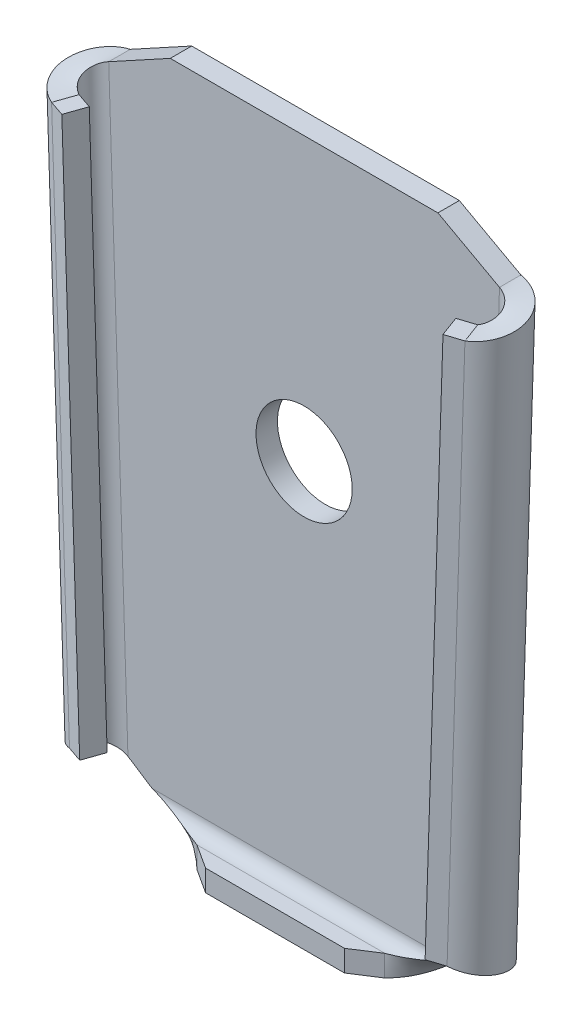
ISO-10303-21;
HEADER;
FILE_DESCRIPTION(('STEP AP214'),'2;1');
FILE_NAME('part.step','',(''),(''),'','','');
FILE_SCHEMA(('AUTOMOTIVE_DESIGN { 1 0 10303 214 1 1 1 1 }'));
ENDSEC;
DATA;
#1=APPLICATION_CONTEXT('core data for automotive mechanical design processes');
#2=APPLICATION_PROTOCOL_DEFINITION('international standard','automotive_design',2000,#1);
#3=PRODUCT_CONTEXT('',#1,'mechanical');
#4=PRODUCT('Part','Part','',(#3));
#5=PRODUCT_RELATED_PRODUCT_CATEGORY('part','',(#4));
#6=PRODUCT_DEFINITION_FORMATION('','',#4);
#7=PRODUCT_DEFINITION_CONTEXT('part definition',#1,'design');
#8=PRODUCT_DEFINITION('design','',#6,#7);
#9=PRODUCT_DEFINITION_SHAPE('','',#8);
#10=(LENGTH_UNIT() NAMED_UNIT(*) SI_UNIT(.MILLI.,.METRE.));
#11=(NAMED_UNIT(*) PLANE_ANGLE_UNIT() SI_UNIT($,.RADIAN.));
#12=(NAMED_UNIT(*) SI_UNIT($,.STERADIAN.) SOLID_ANGLE_UNIT());
#13=UNCERTAINTY_MEASURE_WITH_UNIT(LENGTH_MEASURE(1.E-05),#10,'distance_accuracy_value','');
#14=(GEOMETRIC_REPRESENTATION_CONTEXT(3) GLOBAL_UNCERTAINTY_ASSIGNED_CONTEXT((#13)) GLOBAL_UNIT_ASSIGNED_CONTEXT((#10,
#11,#12)) REPRESENTATION_CONTEXT('',''));
#15=CARTESIAN_POINT('',(0.,0.,0.));
#16=DIRECTION('',(0.,0.,1.));
#17=DIRECTION('',(1.,0.,0.));
#18=AXIS2_PLACEMENT_3D('',#15,#16,#17);
#19=CARTESIAN_POINT('',(0.,0.,-1.27254));
#20=DIRECTION('',(0.,0.,1.));
#21=DIRECTION('',(1.,0.,0.));
#22=AXIS2_PLACEMENT_3D('',#19,#20,#21);
#23=PLANE('',#22);
#24=CARTESIAN_POINT('',(0.,24.511,-1.27254));
#25=DIRECTION('',(0.,0.,1.));
#26=DIRECTION('',(1.,0.,0.));
#27=AXIS2_PLACEMENT_3D('',#24,#25,#26);
#28=CIRCLE('',#27,2.8575);
#29=CARTESIAN_POINT('',(2.8575,24.511,-1.27254));
#30=VERTEX_POINT('',#29);
#31=EDGE_CURVE('E568',#30,#30,#28,.T.);
#32=ORIENTED_EDGE('',*,*,#31,.T.);
#33=EDGE_LOOP('',(#32));
#34=FACE_BOUND('',#33,.T.);
#35=DIRECTION('',(0.0324615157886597,0.999472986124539,0.));
#36=VECTOR('',#35,1.);
#37=CARTESIAN_POINT('',(11.6080272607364,39.2746257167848,-1.27253999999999));
#38=LINE('',#37,#36);
#39=CARTESIAN_POINT('',(11.6080272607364,39.2746257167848,-1.27253999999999));
#40=VERTEX_POINT('',#39);
#41=CARTESIAN_POINT('',(10.4657123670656,4.10335135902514,-1.27254));
#42=VERTEX_POINT('',#41);
#43=EDGE_CURVE('E297',#40,#42,#38,.F.);
#44=ORIENTED_EDGE('',*,*,#43,.T.);
#45=DIRECTION('',(0.839439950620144,0.543452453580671,0.));
#46=VECTOR('',#45,1.);
#47=CARTESIAN_POINT('',(4.1275,0.,-1.27254));
#48=LINE('',#47,#46);
#49=CARTESIAN_POINT('',(9.03174107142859,3.17500000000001,-1.27254));
#50=VERTEX_POINT('',#49);
#51=EDGE_CURVE('E629',#50,#42,#48,.T.);
#52=ORIENTED_EDGE('',*,*,#51,.F.);
#53=DIRECTION('',(-1.,0.,0.));
#54=VECTOR('',#53,1.);
#55=CARTESIAN_POINT('',(0.,3.17500000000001,-1.27254));
#56=LINE('',#55,#54);
#57=CARTESIAN_POINT('',(-9.03174107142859,3.17500000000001,-1.27254));
#58=VERTEX_POINT('',#57);
#59=EDGE_CURVE('E571',#50,#58,#56,.T.);
#60=ORIENTED_EDGE('',*,*,#59,.T.);
#61=DIRECTION('',(0.839439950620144,-0.543452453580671,0.));
#62=VECTOR('',#61,1.);
#63=CARTESIAN_POINT('',(-4.1275,0.,-1.27254));
#64=LINE('',#63,#62);
#65=CARTESIAN_POINT('',(-10.4657123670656,4.10335135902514,-1.27253999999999));
#66=VERTEX_POINT('',#65);
#67=EDGE_CURVE('E108',#66,#58,#64,.T.);
#68=ORIENTED_EDGE('',*,*,#67,.F.);
#69=DIRECTION('',(0.0324615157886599,-0.999472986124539,0.));
#70=VECTOR('',#69,1.);
#71=CARTESIAN_POINT('',(-10.4657123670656,4.10335135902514,-1.27253999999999));
#72=LINE('',#71,#70);
#73=CARTESIAN_POINT('',(-11.6080272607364,39.2746257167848,-1.27254));
#74=VERTEX_POINT('',#73);
#75=EDGE_CURVE('E380',#66,#74,#72,.F.);
#76=ORIENTED_EDGE('',*,*,#75,.T.);
#77=DIRECTION('',(-0.877371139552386,-0.479812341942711,0.));
#78=VECTOR('',#77,1.);
#79=CARTESIAN_POINT('',(-16.0782,36.83,-1.27254));
#80=LINE('',#79,#78);
#81=CARTESIAN_POINT('',(-7.9502,41.275,-1.27254));
#82=VERTEX_POINT('',#81);
#83=EDGE_CURVE('E575',#82,#74,#80,.T.);
#84=ORIENTED_EDGE('',*,*,#83,.F.);
#85=DIRECTION('',(-1.,0.,0.));
#86=VECTOR('',#85,1.);
#87=CARTESIAN_POINT('',(-7.9502,41.275,-1.27254));
#88=LINE('',#87,#86);
#89=CARTESIAN_POINT('',(7.9502,41.275,-1.27254));
#90=VERTEX_POINT('',#89);
#91=EDGE_CURVE('E580',#90,#82,#88,.T.);
#92=ORIENTED_EDGE('',*,*,#91,.F.);
#93=DIRECTION('',(-0.877371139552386,0.479812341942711,0.));
#94=VECTOR('',#93,1.);
#95=CARTESIAN_POINT('',(16.0782,36.83,-1.27254));
#96=LINE('',#95,#94);
#97=EDGE_CURVE('E586',#40,#90,#96,.T.);
#98=ORIENTED_EDGE('',*,*,#97,.F.);
#99=EDGE_LOOP('',(#44,#52,#60,#68,#76,#84,#92,#98));
#100=FACE_BOUND('',#99,.T.);
#101=ADVANCED_FACE('F103',(#34,#100),#23,.F.);
#102=CARTESIAN_POINT('',(0.,0.,0.));
#103=DIRECTION('',(0.,0.,1.));
#104=DIRECTION('',(1.,0.,0.));
#105=AXIS2_PLACEMENT_3D('',#102,#103,#104);
#106=PLANE('',#105);
#107=CARTESIAN_POINT('',(0.,24.511,0.));
#108=DIRECTION('',(0.,0.,1.));
#109=DIRECTION('',(1.,0.,0.));
#110=AXIS2_PLACEMENT_3D('',#107,#108,#109);
#111=CIRCLE('',#110,2.8575);
#112=CARTESIAN_POINT('',(2.8575,24.511,0.));
#113=VERTEX_POINT('',#112);
#114=EDGE_CURVE('E572',#113,#113,#111,.T.);
#115=ORIENTED_EDGE('',*,*,#114,.F.);
#116=EDGE_LOOP('',(#115));
#117=FACE_BOUND('',#116,.T.);
#118=DIRECTION('',(0.839439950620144,0.543452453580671,0.));
#119=VECTOR('',#118,1.);
#120=CARTESIAN_POINT('',(4.1275,0.,0.));
#121=LINE('',#120,#119);
#122=CARTESIAN_POINT('',(9.03174107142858,3.175,0.));
#123=VERTEX_POINT('',#122);
#124=CARTESIAN_POINT('',(10.4657123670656,4.10335135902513,0.));
#125=VERTEX_POINT('',#124);
#126=EDGE_CURVE('E567',#123,#125,#121,.T.);
#127=ORIENTED_EDGE('',*,*,#126,.T.);
#128=DIRECTION('',(0.0324615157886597,0.999472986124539,0.));
#129=VECTOR('',#128,1.);
#130=CARTESIAN_POINT('',(11.6080272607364,39.2746257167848,0.));
#131=LINE('',#130,#129);
#132=CARTESIAN_POINT('',(11.6080272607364,39.2746257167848,0.));
#133=VERTEX_POINT('',#132);
#134=EDGE_CURVE('E287',#133,#125,#131,.F.);
#135=ORIENTED_EDGE('',*,*,#134,.F.);
#136=DIRECTION('',(-0.877371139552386,0.479812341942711,0.));
#137=VECTOR('',#136,1.);
#138=CARTESIAN_POINT('',(16.0782,36.83,0.));
#139=LINE('',#138,#137);
#140=CARTESIAN_POINT('',(7.9502,41.275,0.));
#141=VERTEX_POINT('',#140);
#142=EDGE_CURVE('E565',#133,#141,#139,.T.);
#143=ORIENTED_EDGE('',*,*,#142,.T.);
#144=DIRECTION('',(-1.,0.,0.));
#145=VECTOR('',#144,1.);
#146=CARTESIAN_POINT('',(-7.9502,41.275,0.));
#147=LINE('',#146,#145);
#148=CARTESIAN_POINT('',(-7.9502,41.275,0.));
#149=VERTEX_POINT('',#148);
#150=EDGE_CURVE('E562',#141,#149,#147,.T.);
#151=ORIENTED_EDGE('',*,*,#150,.T.);
#152=DIRECTION('',(-0.877371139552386,-0.479812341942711,0.));
#153=VECTOR('',#152,1.);
#154=CARTESIAN_POINT('',(-16.0782,36.83,0.));
#155=LINE('',#154,#153);
#156=CARTESIAN_POINT('',(-11.6080272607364,39.2746257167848,0.));
#157=VERTEX_POINT('',#156);
#158=EDGE_CURVE('E554',#149,#157,#155,.T.);
#159=ORIENTED_EDGE('',*,*,#158,.T.);
#160=DIRECTION('',(0.0324615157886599,-0.999472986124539,0.));
#161=VECTOR('',#160,1.);
#162=CARTESIAN_POINT('',(-10.4657123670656,4.10335135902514,0.));
#163=LINE('',#162,#161);
#164=CARTESIAN_POINT('',(-10.4657123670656,4.10335135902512,0.));
#165=VERTEX_POINT('',#164);
#166=EDGE_CURVE('E129',#165,#157,#163,.F.);
#167=ORIENTED_EDGE('',*,*,#166,.F.);
#168=DIRECTION('',(0.839439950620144,-0.543452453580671,0.));
#169=VECTOR('',#168,1.);
#170=CARTESIAN_POINT('',(-4.1275,0.,0.));
#171=LINE('',#170,#169);
#172=CARTESIAN_POINT('',(-9.03174107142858,3.175,0.));
#173=VERTEX_POINT('',#172);
#174=EDGE_CURVE('E561',#165,#173,#171,.T.);
#175=ORIENTED_EDGE('',*,*,#174,.T.);
#176=DIRECTION('',(-1.,0.,0.));
#177=VECTOR('',#176,1.);
#178=CARTESIAN_POINT('',(0.,3.175,0.));
#179=LINE('',#178,#177);
#180=EDGE_CURVE('E599',#123,#173,#179,.T.);
#181=ORIENTED_EDGE('',*,*,#180,.F.);
#182=EDGE_LOOP('',(#127,#135,#143,#151,#159,#167,#175,#181));
#183=FACE_BOUND('',#182,.T.);
#184=ADVANCED_FACE('F613',(#117,#183),#106,.T.);
#185=CARTESIAN_POINT('',(16.0782,36.83,-1.27254));
#186=DIRECTION('',(0.47981234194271,0.877371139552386,0.));
#187=DIRECTION('',(-0.877371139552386,0.47981234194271,0.));
#188=AXIS2_PLACEMENT_3D('',#185,#186,#187);
#189=PLANE('',#188);
#190=ORIENTED_EDGE('',*,*,#142,.F.);
#191=DIRECTION('',(0.,0.,-1.));
#192=VECTOR('',#191,1.);
#193=CARTESIAN_POINT('',(11.6080272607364,39.2746257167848,0.));
#194=LINE('',#193,#192);
#195=EDGE_CURVE('E340',#133,#40,#194,.T.);
#196=ORIENTED_EDGE('',*,*,#195,.T.);
#197=ORIENTED_EDGE('',*,*,#97,.T.);
#198=DIRECTION('',(0.,0.,1.));
#199=VECTOR('',#198,1.);
#200=CARTESIAN_POINT('',(7.9502,41.275,-1.27254));
#201=LINE('',#200,#199);
#202=EDGE_CURVE('E583',#90,#141,#201,.T.);
#203=ORIENTED_EDGE('',*,*,#202,.T.);
#204=EDGE_LOOP('',(#190,#196,#197,#203));
#205=FACE_BOUND('',#204,.T.);
#206=ADVANCED_FACE('F509',(#205),#189,.T.);
#207=CARTESIAN_POINT('',(4.1275,0.,-1.27254));
#208=DIRECTION('',(0.543452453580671,-0.839439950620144,0.));
#209=DIRECTION('',(0.839439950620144,0.543452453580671,0.));
#210=AXIS2_PLACEMENT_3D('',#207,#208,#209);
#211=PLANE('',#210);
#212=ORIENTED_EDGE('',*,*,#51,.T.);
#213=DIRECTION('',(0.,0.,-1.));
#214=VECTOR('',#213,1.);
#215=CARTESIAN_POINT('',(10.4657123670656,4.10335135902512,0.));
#216=LINE('',#215,#214);
#217=EDGE_CURVE('E121',#125,#42,#216,.T.);
#218=ORIENTED_EDGE('',*,*,#217,.F.);
#219=ORIENTED_EDGE('',*,*,#126,.F.);
#220=CARTESIAN_POINT('',(9.03174107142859,3.17500000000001,-1.27254));
#221=CARTESIAN_POINT('',(9.03174107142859,3.17500000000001,0.));
#222=B_SPLINE_CURVE_WITH_KNOTS('',1,(#220,#221),.UNSPECIFIED.,.F.,.F.,(2,2),(0.,1.),.UNSPECIFIED.);
#223=EDGE_CURVE('E535',#50,#123,#222,.T.);
#224=ORIENTED_EDGE('',*,*,#223,.F.);
#225=EDGE_LOOP('',(#212,#218,#219,#224));
#226=FACE_BOUND('',#225,.T.);
#227=ADVANCED_FACE('F617',(#226),#211,.T.);
#228=CARTESIAN_POINT('',(-16.0782,36.83,-1.27254));
#229=DIRECTION('',(-0.47981234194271,0.877371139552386,0.));
#230=DIRECTION('',(-0.877371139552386,-0.47981234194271,0.));
#231=AXIS2_PLACEMENT_3D('',#228,#229,#230);
#232=PLANE('',#231);
#233=ORIENTED_EDGE('',*,*,#83,.T.);
#234=DIRECTION('',(0.,0.,-1.));
#235=VECTOR('',#234,1.);
#236=CARTESIAN_POINT('',(-11.6080272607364,39.2746257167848,0.));
#237=LINE('',#236,#235);
#238=EDGE_CURVE('E416',#157,#74,#237,.T.);
#239=ORIENTED_EDGE('',*,*,#238,.F.);
#240=ORIENTED_EDGE('',*,*,#158,.F.);
#241=DIRECTION('',(0.,0.,1.));
#242=VECTOR('',#241,1.);
#243=CARTESIAN_POINT('',(-7.9502,41.275,-1.27254));
#244=LINE('',#243,#242);
#245=EDGE_CURVE('E578',#82,#149,#244,.T.);
#246=ORIENTED_EDGE('',*,*,#245,.F.);
#247=EDGE_LOOP('',(#233,#239,#240,#246));
#248=FACE_BOUND('',#247,.T.);
#249=ADVANCED_FACE('F611',(#248),#232,.T.);
#250=CARTESIAN_POINT('',(-4.1275,0.,-1.27254));
#251=DIRECTION('',(-0.543452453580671,-0.839439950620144,0.));
#252=DIRECTION('',(0.839439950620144,-0.543452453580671,0.));
#253=AXIS2_PLACEMENT_3D('',#250,#251,#252);
#254=PLANE('',#253);
#255=ORIENTED_EDGE('',*,*,#174,.F.);
#256=DIRECTION('',(0.,0.,-1.));
#257=VECTOR('',#256,1.);
#258=CARTESIAN_POINT('',(-10.4657123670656,4.10335135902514,0.));
#259=LINE('',#258,#257);
#260=EDGE_CURVE('E425',#165,#66,#259,.T.);
#261=ORIENTED_EDGE('',*,*,#260,.T.);
#262=ORIENTED_EDGE('',*,*,#67,.T.);
#263=CARTESIAN_POINT('',(-9.03174107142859,3.17500000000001,0.));
#264=CARTESIAN_POINT('',(-9.03174107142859,3.17500000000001,-1.27254));
#265=B_SPLINE_CURVE_WITH_KNOTS('',1,(#263,#264),.UNSPECIFIED.,.F.,.F.,(2,2),(0.,1.),.UNSPECIFIED.);
#266=EDGE_CURVE('E550',#173,#58,#265,.T.);
#267=ORIENTED_EDGE('',*,*,#266,.F.);
#268=EDGE_LOOP('',(#255,#261,#262,#267));
#269=FACE_BOUND('',#268,.T.);
#270=ADVANCED_FACE('F601',(#269),#254,.T.);
#271=CARTESIAN_POINT('',(4.1275,1.11506000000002,1.72610439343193));
#272=DIRECTION('',(0.543452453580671,0.,0.839439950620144));
#273=DIRECTION('',(0.839439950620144,0.,-0.543452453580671));
#274=AXIS2_PLACEMENT_3D('',#271,#272,#273);
#275=PLANE('',#274);
#276=DIRECTION('',(0.839439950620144,0.,-0.543452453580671));
#277=VECTOR('',#276,1.);
#278=CARTESIAN_POINT('',(4.1275,1.11506000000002,1.72610439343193));
#279=LINE('',#278,#277);
#280=CARTESIAN_POINT('',(4.1275,1.11506000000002,1.72610439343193));
#281=VERTEX_POINT('',#280);
#282=CARTESIAN_POINT('',(5.57746303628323,1.11506000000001,0.787400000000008));
#283=VERTEX_POINT('',#282);
#284=EDGE_CURVE('E647',#281,#283,#279,.T.);
#285=ORIENTED_EDGE('',*,*,#284,.T.);
#286=CARTESIAN_POINT('',(5.57746303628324,2.38760000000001,0.7874));
#287=CARTESIAN_POINT('',(5.57746303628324,1.11506000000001,0.787399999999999));
#288=B_SPLINE_CURVE_WITH_KNOTS('',1,(#286,#287),.UNSPECIFIED.,.F.,.F.,(2,2),(0.,1.),.UNSPECIFIED.);
#289=CARTESIAN_POINT('',(5.57746303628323,2.38760000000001,0.787400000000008));
#290=VERTEX_POINT('',#289);
#291=EDGE_CURVE('E13',#283,#290,#288,.F.);
#292=ORIENTED_EDGE('',*,*,#291,.T.);
#293=DIRECTION('',(0.839439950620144,0.,-0.543452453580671));
#294=VECTOR('',#293,1.);
#295=CARTESIAN_POINT('',(4.1275,2.38760000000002,1.72610439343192));
#296=LINE('',#295,#294);
#297=CARTESIAN_POINT('',(4.1275,2.38760000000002,1.72610439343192));
#298=VERTEX_POINT('',#297);
#299=EDGE_CURVE('E636',#298,#290,#296,.T.);
#300=ORIENTED_EDGE('',*,*,#299,.F.);
#301=DIRECTION('',(0.,1.,0.));
#302=VECTOR('',#301,1.);
#303=CARTESIAN_POINT('',(4.1275,1.11506000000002,1.72610439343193));
#304=LINE('',#303,#302);
#305=EDGE_CURVE('E649',#281,#298,#304,.T.);
#306=ORIENTED_EDGE('',*,*,#305,.F.);
#307=EDGE_LOOP('',(#285,#292,#300,#306));
#308=FACE_BOUND('',#307,.T.);
#309=ADVANCED_FACE('F105',(#308),#275,.T.);
#310=CARTESIAN_POINT('',(-4.1275,1.11506000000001,1.72610439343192));
#311=DIRECTION('',(-0.543452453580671,0.,0.839439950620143));
#312=DIRECTION('',(0.839439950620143,0.,0.543452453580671));
#313=AXIS2_PLACEMENT_3D('',#310,#311,#312);
#314=PLANE('',#313);
#315=DIRECTION('',(0.839439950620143,0.,0.543452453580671));
#316=VECTOR('',#315,1.);
#317=CARTESIAN_POINT('',(-4.1275,2.38760000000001,1.72610439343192));
#318=LINE('',#317,#316);
#319=CARTESIAN_POINT('',(-5.57746303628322,2.38760000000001,0.787400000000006));
#320=VERTEX_POINT('',#319);
#321=CARTESIAN_POINT('',(-4.1275,2.38760000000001,1.72610439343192));
#322=VERTEX_POINT('',#321);
#323=EDGE_CURVE('E648',#320,#322,#318,.T.);
#324=ORIENTED_EDGE('',*,*,#323,.F.);
#325=CARTESIAN_POINT('',(-5.57746303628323,1.11506000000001,0.787399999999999));
#326=CARTESIAN_POINT('',(-5.57746303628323,2.38760000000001,0.7874));
#327=B_SPLINE_CURVE_WITH_KNOTS('',1,(#325,#326),.UNSPECIFIED.,.F.,.F.,(2,2),(0.,1.),.UNSPECIFIED.);
#328=CARTESIAN_POINT('',(-5.57746303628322,1.11506000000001,0.787400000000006));
#329=VERTEX_POINT('',#328);
#330=EDGE_CURVE('E658',#320,#329,#327,.F.);
#331=ORIENTED_EDGE('',*,*,#330,.T.);
#332=DIRECTION('',(0.839439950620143,0.,0.543452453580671));
#333=VECTOR('',#332,1.);
#334=CARTESIAN_POINT('',(-4.1275,1.11506000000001,1.72610439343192));
#335=LINE('',#334,#333);
#336=CARTESIAN_POINT('',(-4.1275,1.11506000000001,1.72610439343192));
#337=VERTEX_POINT('',#336);
#338=EDGE_CURVE('E643',#329,#337,#335,.T.);
#339=ORIENTED_EDGE('',*,*,#338,.T.);
#340=DIRECTION('',(0.,1.,0.));
#341=VECTOR('',#340,1.);
#342=CARTESIAN_POINT('',(-4.1275,1.11506000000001,1.72610439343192));
#343=LINE('',#342,#341);
#344=EDGE_CURVE('E642',#337,#322,#343,.T.);
#345=ORIENTED_EDGE('',*,*,#344,.T.);
#346=EDGE_LOOP('',(#324,#331,#339,#345));
#347=FACE_BOUND('',#346,.T.);
#348=ADVANCED_FACE('F694',(#347),#314,.T.);
#349=CARTESIAN_POINT('',(0.,2.38760000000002,1.72610439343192));
#350=DIRECTION('',(0.,1.,0.));
#351=DIRECTION('',(1.,0.,0.));
#352=AXIS2_PLACEMENT_3D('',#349,#350,#351);
#353=PLANE('',#352);
#354=ORIENTED_EDGE('',*,*,#299,.T.);
#355=DIRECTION('',(-1.,0.,0.));
#356=VECTOR('',#355,1.);
#357=CARTESIAN_POINT('',(0.,2.38760000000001,0.787400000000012));
#358=LINE('',#357,#356);
#359=EDGE_CURVE('E114',#290,#320,#358,.T.);
#360=ORIENTED_EDGE('',*,*,#359,.T.);
#361=ORIENTED_EDGE('',*,*,#323,.T.);
#362=DIRECTION('',(1.,0.,0.));
#363=VECTOR('',#362,1.);
#364=CARTESIAN_POINT('',(4.1275,2.38760000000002,1.72610439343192));
#365=LINE('',#364,#363);
#366=EDGE_CURVE('E644',#322,#298,#365,.T.);
#367=ORIENTED_EDGE('',*,*,#366,.T.);
#368=EDGE_LOOP('',(#354,#360,#361,#367));
#369=FACE_BOUND('',#368,.T.);
#370=ADVANCED_FACE('F702',(#369),#353,.T.);
#371=CARTESIAN_POINT('',(4.1275,1.11506000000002,1.72610439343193));
#372=DIRECTION('',(0.,0.,1.));
#373=DIRECTION('',(0.,-1.,0.));
#374=AXIS2_PLACEMENT_3D('',#371,#372,#373);
#375=PLANE('',#374);
#376=ORIENTED_EDGE('',*,*,#366,.F.);
#377=ORIENTED_EDGE('',*,*,#344,.F.);
#378=DIRECTION('',(1.,0.,0.));
#379=VECTOR('',#378,1.);
#380=CARTESIAN_POINT('',(4.1275,1.11506000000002,1.72610439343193));
#381=LINE('',#380,#379);
#382=EDGE_CURVE('E639',#337,#281,#381,.T.);
#383=ORIENTED_EDGE('',*,*,#382,.T.);
#384=ORIENTED_EDGE('',*,*,#305,.T.);
#385=EDGE_LOOP('',(#376,#377,#383,#384));
#386=FACE_BOUND('',#385,.T.);
#387=ADVANCED_FACE('F621',(#386),#375,.T.);
#388=CARTESIAN_POINT('',(0.,1.11506000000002,1.72610439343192));
#389=DIRECTION('',(0.,1.,0.));
#390=DIRECTION('',(1.,0.,0.));
#391=AXIS2_PLACEMENT_3D('',#388,#389,#390);
#392=PLANE('',#391);
#393=DIRECTION('',(-1.,0.,0.));
#394=VECTOR('',#393,1.);
#395=CARTESIAN_POINT('',(0.,1.11506000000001,0.787400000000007));
#396=LINE('',#395,#394);
#397=EDGE_CURVE('E651',#283,#329,#396,.T.);
#398=ORIENTED_EDGE('',*,*,#397,.F.);
#399=ORIENTED_EDGE('',*,*,#284,.F.);
#400=ORIENTED_EDGE('',*,*,#382,.F.);
#401=ORIENTED_EDGE('',*,*,#338,.F.);
#402=EDGE_LOOP('',(#398,#399,#400,#401));
#403=FACE_BOUND('',#402,.T.);
#404=ADVANCED_FACE('F703',(#403),#392,.F.);
#405=CARTESIAN_POINT('',(-7.9502,41.275,-1.27254));
#406=DIRECTION('',(0.,1.,0.));
#407=DIRECTION('',(0.,0.,1.));
#408=AXIS2_PLACEMENT_3D('',#405,#406,#407);
#409=PLANE('',#408);
#410=ORIENTED_EDGE('',*,*,#150,.F.);
#411=ORIENTED_EDGE('',*,*,#202,.F.);
#412=ORIENTED_EDGE('',*,*,#91,.T.);
#413=ORIENTED_EDGE('',*,*,#245,.T.);
#414=EDGE_LOOP('',(#410,#411,#412,#413));
#415=FACE_BOUND('',#414,.T.);
#416=ADVANCED_FACE('F791',(#415),#409,.T.);
#417=CARTESIAN_POINT('',(0.,24.511,-1.27254));
#418=DIRECTION('',(0.,0.,1.));
#419=DIRECTION('',(1.,0.,0.));
#420=AXIS2_PLACEMENT_3D('',#417,#418,#419);
#421=CYLINDRICAL_SURFACE('',#420,2.8575);
#422=ORIENTED_EDGE('',*,*,#31,.F.);
#423=EDGE_LOOP('',(#422));
#424=FACE_BOUND('',#423,.T.);
#425=ORIENTED_EDGE('',*,*,#114,.T.);
#426=EDGE_LOOP('',(#425));
#427=FACE_BOUND('',#426,.T.);
#428=ADVANCED_FACE('F505',(#424,#427),#421,.F.);
#429=CARTESIAN_POINT('',(9.03174107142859,3.17500000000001,-1.27254));
#430=CARTESIAN_POINT('',(8.74386031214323,2.90533176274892,-1.27254));
#431=CARTESIAN_POINT('',(8.45602806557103,2.63581506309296,-1.21892527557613));
#432=CARTESIAN_POINT('',(7.88031505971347,2.13757511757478,-1.01254753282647));
#433=CARTESIAN_POINT('',(7.59245855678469,1.90907062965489,-0.859865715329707));
#434=CARTESIAN_POINT('',(7.01674555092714,1.52773428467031,-0.478529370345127));
#435=CARTESIAN_POINT('',(6.72888904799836,1.37505246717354,-0.250024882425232));
#436=CARTESIAN_POINT('',(6.1531760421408,1.16867472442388,0.248215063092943));
#437=CARTESIAN_POINT('',(5.8653437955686,1.11506000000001,0.517731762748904));
#438=CARTESIAN_POINT('',(5.57746303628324,1.11506000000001,0.787399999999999));
#439=CARTESIAN_POINT('',(9.03174107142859,3.17500000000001,0.));
#440=CARTESIAN_POINT('',(8.74387867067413,3.07192746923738,0.));
#441=CARTESIAN_POINT('',(8.45602806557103,2.96889971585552,0.0204939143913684));
#442=CARTESIAN_POINT('',(7.88031505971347,2.77845041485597,0.0993805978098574));
#443=CARTESIAN_POINT('',(7.59245855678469,2.69110591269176,0.157742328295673));
#444=CARTESIAN_POINT('',(7.01674555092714,2.54534232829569,0.303505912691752));
#445=CARTESIAN_POINT('',(6.72888904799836,2.48698059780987,0.390850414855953));
#446=CARTESIAN_POINT('',(6.1531760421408,2.40809391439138,0.581299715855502));
#447=CARTESIAN_POINT('',(5.86532543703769,2.38760000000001,0.684327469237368));
#448=CARTESIAN_POINT('',(5.57746303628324,2.38760000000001,0.7874));
#449=B_SPLINE_SURFACE_WITH_KNOTS('',1,3,((#429,#430,#431,#432,#433,#434,#435,#436,#437,#438),
(#439,#440,#441,#442,#443,#444,#445,#446,#447,#448)),.UNSPECIFIED.,.F.,.F.,.F.,(2,2),(4,2,2,2,
4),(0.,1.),(0.,0.25,0.5,0.75,1.),.UNSPECIFIED.);
#450=CARTESIAN_POINT('',(9.03174107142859,3.17500000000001,0.));
#451=CARTESIAN_POINT('',(8.74387867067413,3.07192746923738,0.));
#452=CARTESIAN_POINT('',(8.45602806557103,2.96889971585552,0.0204939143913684));
#453=CARTESIAN_POINT('',(7.88031505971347,2.77845041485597,0.0993805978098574));
#454=CARTESIAN_POINT('',(7.59245855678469,2.69110591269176,0.157742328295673));
#455=CARTESIAN_POINT('',(7.01674555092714,2.54534232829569,0.303505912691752));
#456=CARTESIAN_POINT('',(6.72888904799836,2.48698059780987,0.390850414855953));
#457=CARTESIAN_POINT('',(6.1531760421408,2.40809391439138,0.581299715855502));
#458=CARTESIAN_POINT('',(5.86532543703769,2.38760000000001,0.684327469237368));
#459=CARTESIAN_POINT('',(5.57746303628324,2.38760000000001,0.7874));
#460=B_SPLINE_CURVE_WITH_KNOTS('',3,(#450,#451,#452,#453,#454,#455,#456,#457,#458,#459),
.UNSPECIFIED.,.F.,.F.,(4,2,2,2,4),(0.,0.25,0.5,0.75,1.),.UNSPECIFIED.);
#461=EDGE_CURVE('E424',#123,#290,#460,.T.);
#462=CARTESIAN_POINT('',(5.57746303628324,1.11506000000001,0.787399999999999));
#463=CARTESIAN_POINT('',(5.8653437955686,1.11506000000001,0.517731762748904));
#464=CARTESIAN_POINT('',(6.1531760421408,1.16867472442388,0.248215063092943));
#465=CARTESIAN_POINT('',(6.72888904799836,1.37505246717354,-0.250024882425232));
#466=CARTESIAN_POINT('',(7.01674555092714,1.52773428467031,-0.478529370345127));
#467=CARTESIAN_POINT('',(7.59245855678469,1.90907062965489,-0.859865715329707));
#468=CARTESIAN_POINT('',(7.88031505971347,2.13757511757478,-1.01254753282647));
#469=CARTESIAN_POINT('',(8.45602806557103,2.63581506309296,-1.21892527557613));
#470=CARTESIAN_POINT('',(8.74386031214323,2.90533176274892,-1.27254));
#471=CARTESIAN_POINT('',(9.03174107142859,3.17500000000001,-1.27254));
#472=B_SPLINE_CURVE_WITH_KNOTS('',3,(#462,#463,#464,#465,#466,#467,#468,#469,#470,#471),
.UNSPECIFIED.,.F.,.F.,(4,2,2,2,4),(0.,0.25,0.5,0.75,1.),.UNSPECIFIED.);
#473=EDGE_CURVE('E470',#50,#283,#472,.F.);
#474=ORIENTED_EDGE('',*,*,#223,.T.);
#475=ORIENTED_EDGE('',*,*,#461,.T.);
#476=ORIENTED_EDGE('',*,*,#291,.F.);
#477=ORIENTED_EDGE('',*,*,#473,.F.);
#478=EDGE_LOOP('',(#474,#475,#476,#477));
#479=FACE_BOUND('',#478,.T.);
#480=ADVANCED_FACE('F494',(#479),#449,.T.);
#481=CARTESIAN_POINT('',(-5.57746303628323,1.11506000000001,0.787399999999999));
#482=CARTESIAN_POINT('',(-5.86534379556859,1.11506000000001,0.517731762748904));
#483=CARTESIAN_POINT('',(-6.15317604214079,1.16867472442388,0.248215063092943));
#484=CARTESIAN_POINT('',(-6.72888904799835,1.37505246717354,-0.250024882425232));
#485=CARTESIAN_POINT('',(-7.01674555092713,1.5277342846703,-0.478529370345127));
#486=CARTESIAN_POINT('',(-7.59245855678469,1.90907062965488,-0.859865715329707));
#487=CARTESIAN_POINT('',(-7.88031505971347,2.13757511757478,-1.01254753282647));
#488=CARTESIAN_POINT('',(-8.45602806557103,2.63581506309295,-1.21892527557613));
#489=CARTESIAN_POINT('',(-8.74386031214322,2.90533176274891,-1.27254));
#490=CARTESIAN_POINT('',(-9.03174107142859,3.17500000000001,-1.27254));
#491=CARTESIAN_POINT('',(-5.57746303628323,2.38760000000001,0.7874));
#492=CARTESIAN_POINT('',(-5.86532543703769,2.38760000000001,0.684327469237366));
#493=CARTESIAN_POINT('',(-6.15317604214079,2.40809391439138,0.581299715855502));
#494=CARTESIAN_POINT('',(-6.72888904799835,2.48698059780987,0.390850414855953));
#495=CARTESIAN_POINT('',(-7.01674555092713,2.54534232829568,0.303505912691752));
#496=CARTESIAN_POINT('',(-7.59245855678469,2.69110591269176,0.157742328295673));
#497=CARTESIAN_POINT('',(-7.88031505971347,2.77845041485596,0.0993805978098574));
#498=CARTESIAN_POINT('',(-8.45602806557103,2.96889971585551,0.0204939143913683));
#499=CARTESIAN_POINT('',(-8.74387867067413,3.07192746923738,0.));
#500=CARTESIAN_POINT('',(-9.03174107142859,3.17500000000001,0.));
#501=B_SPLINE_SURFACE_WITH_KNOTS('',1,3,((#481,#482,#483,#484,#485,#486,#487,#488,#489,#490),
(#491,#492,#493,#494,#495,#496,#497,#498,#499,#500)),.UNSPECIFIED.,.F.,.F.,.F.,(2,2),(4,2,2,2,
4),(0.,1.),(0.,0.25,0.5,0.75,1.),.UNSPECIFIED.);
#502=CARTESIAN_POINT('',(-5.57746303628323,2.38760000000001,0.7874));
#503=CARTESIAN_POINT('',(-5.86532543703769,2.38760000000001,0.684327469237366));
#504=CARTESIAN_POINT('',(-6.15317604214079,2.40809391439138,0.581299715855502));
#505=CARTESIAN_POINT('',(-6.72888904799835,2.48698059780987,0.390850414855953));
#506=CARTESIAN_POINT('',(-7.01674555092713,2.54534232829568,0.303505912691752));
#507=CARTESIAN_POINT('',(-7.59245855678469,2.69110591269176,0.157742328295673));
#508=CARTESIAN_POINT('',(-7.88031505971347,2.77845041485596,0.0993805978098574));
#509=CARTESIAN_POINT('',(-8.45602806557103,2.96889971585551,0.0204939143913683));
#510=CARTESIAN_POINT('',(-8.74387867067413,3.07192746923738,0.));
#511=CARTESIAN_POINT('',(-9.03174107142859,3.17500000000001,0.));
#512=B_SPLINE_CURVE_WITH_KNOTS('',3,(#502,#503,#504,#505,#506,#507,#508,#509,#510,#511),
.UNSPECIFIED.,.F.,.F.,(4,2,2,2,4),(0.,0.25,0.5,0.75,1.),.UNSPECIFIED.);
#513=EDGE_CURVE('E750',#320,#173,#512,.T.);
#514=CARTESIAN_POINT('',(-9.03174107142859,3.17500000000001,-1.27254));
#515=CARTESIAN_POINT('',(-8.74386031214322,2.90533176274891,-1.27254));
#516=CARTESIAN_POINT('',(-8.45602806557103,2.63581506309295,-1.21892527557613));
#517=CARTESIAN_POINT('',(-7.88031505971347,2.13757511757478,-1.01254753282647));
#518=CARTESIAN_POINT('',(-7.59245855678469,1.90907062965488,-0.859865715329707));
#519=CARTESIAN_POINT('',(-7.01674555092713,1.5277342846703,-0.478529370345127));
#520=CARTESIAN_POINT('',(-6.72888904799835,1.37505246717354,-0.250024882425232));
#521=CARTESIAN_POINT('',(-6.15317604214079,1.16867472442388,0.248215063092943));
#522=CARTESIAN_POINT('',(-5.86534379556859,1.11506000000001,0.517731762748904));
#523=CARTESIAN_POINT('',(-5.57746303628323,1.11506000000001,0.787399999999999));
#524=B_SPLINE_CURVE_WITH_KNOTS('',3,(#514,#515,#516,#517,#518,#519,#520,#521,#522,#523),
.UNSPECIFIED.,.F.,.F.,(4,2,2,2,4),(0.,0.25,0.5,0.75,1.),.UNSPECIFIED.);
#525=EDGE_CURVE('E745',#329,#58,#524,.F.);
#526=ORIENTED_EDGE('',*,*,#330,.F.);
#527=ORIENTED_EDGE('',*,*,#513,.T.);
#528=ORIENTED_EDGE('',*,*,#266,.T.);
#529=ORIENTED_EDGE('',*,*,#525,.F.);
#530=EDGE_LOOP('',(#526,#527,#528,#529));
#531=FACE_BOUND('',#530,.T.);
#532=ADVANCED_FACE('F444',(#531),#501,.T.);
#533=CARTESIAN_POINT('',(18.2458149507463,3.17500000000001,0.7874));
#534=DIRECTION('',(-1.,0.,0.));
#535=DIRECTION('',(0.,-1.,0.));
#536=AXIS2_PLACEMENT_3D('',#533,#534,#535);
#537=CYLINDRICAL_SURFACE('',#536,2.05994);
#538=ORIENTED_EDGE('',*,*,#525,.T.);
#539=ORIENTED_EDGE('',*,*,#59,.F.);
#540=ORIENTED_EDGE('',*,*,#473,.T.);
#541=ORIENTED_EDGE('',*,*,#397,.T.);
#542=EDGE_LOOP('',(#538,#539,#540,#541));
#543=FACE_BOUND('',#542,.T.);
#544=ADVANCED_FACE('F434',(#543),#537,.T.);
#545=CARTESIAN_POINT('',(18.2458149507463,3.17500000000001,0.7874));
#546=DIRECTION('',(-1.,0.,0.));
#547=DIRECTION('',(0.,-1.,0.));
#548=AXIS2_PLACEMENT_3D('',#545,#546,#547);
#549=CYLINDRICAL_SURFACE('',#548,0.7874);
#550=ORIENTED_EDGE('',*,*,#513,.F.);
#551=ORIENTED_EDGE('',*,*,#359,.F.);
#552=ORIENTED_EDGE('',*,*,#461,.F.);
#553=ORIENTED_EDGE('',*,*,#180,.T.);
#554=EDGE_LOOP('',(#550,#551,#552,#553));
#555=FACE_BOUND('',#554,.T.);
#556=ADVANCED_FACE('F443',(#555),#549,.F.);
#557=CARTESIAN_POINT('',(-11.6080272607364,39.2746257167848,-1.2852654));
#558=CARTESIAN_POINT('',(-11.8476837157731,39.2234338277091,-1.2852654));
#559=CARTESIAN_POINT('',(-12.0872285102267,39.172255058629,-1.24275186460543));
#560=CARTESIAN_POINT('',(-12.5374162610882,39.0708267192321,-1.07778489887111));
#561=CARTESIAN_POINT('',(-12.747921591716,39.0205863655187,-0.955372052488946));
#562=CARTESIAN_POINT('',(-13.114397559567,38.9218768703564,-0.645335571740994));
#563=CARTESIAN_POINT('',(-13.2702773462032,38.8734106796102,-0.457788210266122));
#564=CARTESIAN_POINT('',(-13.5084994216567,38.778866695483,-0.040077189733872));
#565=CARTESIAN_POINT('',(-13.5907824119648,38.7327908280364,0.18998370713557));
#566=CARTESIAN_POINT('',(-13.6716777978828,38.6433565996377,0.664987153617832));
#567=CARTESIAN_POINT('',(-13.6702695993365,38.5999989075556,0.909812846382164));
#568=CARTESIAN_POINT('',(-13.5837414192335,38.5160023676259,1.38481629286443));
#569=CARTESIAN_POINT('',(-13.4986420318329,38.4753628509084,1.61487718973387));
#570=CARTESIAN_POINT('',(-13.2547871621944,38.3964760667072,2.03258821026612));
#571=CARTESIAN_POINT('',(-13.0960909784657,38.3582268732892,2.22013557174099));
#572=CARTESIAN_POINT('',(-12.7239822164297,38.2835056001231,2.53017205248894));
#573=CARTESIAN_POINT('',(-12.5106853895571,38.2470345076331,2.65257588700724));
#574=CARTESIAN_POINT('',(-12.2827502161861,38.2110293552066,2.73506838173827));
#575=CARTESIAN_POINT('',(-11.6080272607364,39.2746257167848,-1.27254));
#576=CARTESIAN_POINT('',(-11.8462036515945,39.2234819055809,-1.27254));
#577=CARTESIAN_POINT('',(-12.0842690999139,39.1723511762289,-1.23028748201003));
#578=CARTESIAN_POINT('',(-12.5316755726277,39.0710131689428,-1.06633335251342));
#579=CARTESIAN_POINT('',(-12.7408798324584,39.0208150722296,-0.944672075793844));
#580=CARTESIAN_POINT('',(-13.1050884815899,38.9221792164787,-0.636539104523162));
#581=CARTESIAN_POINT('',(-13.2600025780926,38.8737443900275,-0.450143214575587));
#582=CARTESIAN_POINT('',(-13.4967447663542,38.7792484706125,-0.0349967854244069));
#583=CARTESIAN_POINT('',(-13.5785139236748,38.7331892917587,0.19365162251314));
#584=CARTESIAN_POINT('',(-13.6588953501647,38.6437717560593,0.665738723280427));
#585=CARTESIAN_POINT('',(-13.6574871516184,38.6004140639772,0.909061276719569));
#586=CARTESIAN_POINT('',(-13.5714729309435,38.5164008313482,1.38114837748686));
#587=CARTESIAN_POINT('',(-13.4868873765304,38.4757446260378,1.6097967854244));
#588=CARTESIAN_POINT('',(-13.2445123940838,38.3968097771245,2.02494321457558));
#589=CARTESIAN_POINT('',(-13.0867819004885,38.3585292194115,2.21133910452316));
#590=CARTESIAN_POINT('',(-12.7169404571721,38.283734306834,2.51947207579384));
#591=CARTESIAN_POINT('',(-12.504944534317,38.2472209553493,2.64112440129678));
#592=CARTESIAN_POINT('',(-12.2784001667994,38.2111706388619,2.72311041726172));
#593=CARTESIAN_POINT('',(-11.6080272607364,39.2746257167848,0.));
#594=CARTESIAN_POINT('',(-11.6981972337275,39.2282896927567,0.));
#595=CARTESIAN_POINT('',(-11.78832806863,39.1819629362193,0.0161507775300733));
#596=CARTESIAN_POINT('',(-11.9576067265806,39.089658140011,0.0788212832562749));
#597=CARTESIAN_POINT('',(-12.0367039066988,39.0436857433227,0.125325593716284));
#598=CARTESIAN_POINT('',(-12.1741806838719,38.9524138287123,0.243107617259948));
#599=CARTESIAN_POINT('',(-12.2325257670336,38.9071154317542,0.314356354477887));
#600=CARTESIAN_POINT('',(-12.3212792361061,38.8174259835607,0.473043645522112));
#601=CARTESIAN_POINT('',(-12.3516650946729,38.7730356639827,0.560443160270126));
#602=CARTESIAN_POINT('',(-12.3806505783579,38.6852873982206,0.740895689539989));
#603=CARTESIAN_POINT('',(-12.3792423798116,38.6419297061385,0.833904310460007));
#604=CARTESIAN_POINT('',(-12.3446241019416,38.5562472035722,1.01435683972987));
#605=CARTESIAN_POINT('',(-12.3114218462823,38.5139221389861,1.10175635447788));
#606=CARTESIAN_POINT('',(-12.2170355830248,38.4301808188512,1.26044364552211));
#607=CARTESIAN_POINT('',(-12.1558741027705,38.3887638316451,1.33169238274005));
#608=CARTESIAN_POINT('',(-12.0127645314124,38.3066049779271,1.44947440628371));
#609=CARTESIAN_POINT('',(-11.9308590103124,38.2658657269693,1.49597583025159));
#610=CARTESIAN_POINT('',(-11.8433952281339,38.2252990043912,1.52731396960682));
#611=CARTESIAN_POINT('',(-11.6080272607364,39.2746257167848,0.0128526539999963));
#612=CARTESIAN_POINT('',(-11.696702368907,39.2283382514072,0.0128526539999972));
#613=CARTESIAN_POINT('',(-11.785339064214,39.1820600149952,0.0287398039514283));
#614=CARTESIAN_POINT('',(-11.9518086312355,39.0898464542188,0.0903873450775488));
#615=CARTESIAN_POINT('',(-12.0295917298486,39.0439167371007,0.136132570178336));
#616=CARTESIAN_POINT('',(-12.1647785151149,38.9527191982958,0.251992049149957));
#617=CARTESIAN_POINT('',(-12.2221482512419,38.9074524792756,0.322077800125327));
#618=CARTESIAN_POINT('',(-12.3094070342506,38.8178115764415,0.478174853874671));
#619=CARTESIAN_POINT('',(-12.3392739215,38.7734381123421,0.564147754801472));
#620=CARTESIAN_POINT('',(-12.3677403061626,38.6857067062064,0.741654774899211));
#621=CARTESIAN_POINT('',(-12.3663321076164,38.6423490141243,0.833145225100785));
#622=CARTESIAN_POINT('',(-12.3322329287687,38.5566496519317,1.01065224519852));
#623=CARTESIAN_POINT('',(-12.2995496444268,38.5143077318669,1.09662514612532));
#624=CARTESIAN_POINT('',(-12.2066580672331,38.4305178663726,1.25272219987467));
#625=CARTESIAN_POINT('',(-12.1464719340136,38.3890692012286,1.32280795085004));
#626=CARTESIAN_POINT('',(-12.0056523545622,38.3068359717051,1.43866742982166));
#627=CARTESIAN_POINT('',(-11.9250607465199,38.2660540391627,1.48440982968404));
#628=CARTESIAN_POINT('',(-11.8390016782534,38.225441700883,1.51523642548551));
#629=B_SPLINE_SURFACE_WITH_KNOTS('',1,3,((#557,#558,#559,#560,#561,#562,#563,#564,#565,#566,
#567,#568,#569,#570,#571,#572,#573,#574),(#575,#576,#577,#578,#579,#580,#581,#582,#583,#584,
#585,#586,#587,#588,#589,#590,#591,#592),(#593,#594,#595,#596,#597,#598,#599,#600,#601,#602,
#603,#604,#605,#606,#607,#608,#609,#610),(#611,#612,#613,#614,#615,#616,#617,#618,#619,#620,
#621,#622,#623,#624,#625,#626,#627,#628)),.UNSPECIFIED.,.F.,.F.,.F.,(2,1,1,2),(4,2,2,2,2,2,2,2,
4),(-0.01,0.,1.,1.0101),(0.,0.125,0.25,0.375,0.5,0.625,0.75,0.875,1.),.UNSPECIFIED.);
#630=DIRECTION('',(0.34183989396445,0.0111024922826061,-0.939692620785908));
#631=VECTOR('',#630,1.);
#632=CARTESIAN_POINT('',(-12.2784001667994,38.2111706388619,2.72311041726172));
#633=LINE('',#632,#631);
#634=CARTESIAN_POINT('',(-11.8433952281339,38.2252990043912,1.52731396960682));
#635=VERTEX_POINT('',#634);
#636=CARTESIAN_POINT('',(-12.2784001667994,38.2111706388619,2.72311041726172));
#637=VERTEX_POINT('',#636);
#638=EDGE_CURVE('E339',#635,#637,#633,.F.);
#639=CARTESIAN_POINT('',(-11.6080272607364,39.2746257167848,0.));
#640=CARTESIAN_POINT('',(-11.6192974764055,39.2688342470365,-1.70661592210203E-07));
#641=CARTESIAN_POINT('',(-11.6305676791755,39.2630427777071,0.000249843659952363));
#642=CARTESIAN_POINT('',(-11.6530863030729,39.2514605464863,0.00124901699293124));
#643=CARTESIAN_POINT('',(-11.6643347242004,39.2456697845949,0.0019981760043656));
#644=CARTESIAN_POINT('',(-11.6867880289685,39.2340896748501,0.00399441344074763));
#645=CARTESIAN_POINT('',(-11.6979929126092,39.2283003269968,0.00524149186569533));
#646=CARTESIAN_POINT('',(-11.7203374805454,39.2167237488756,0.00823114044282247));
#647=CARTESIAN_POINT('',(-11.731477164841,39.2109365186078,0.00997371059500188));
#648=CARTESIAN_POINT('',(-11.7536697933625,39.199364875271,0.0139510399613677));
#649=CARTESIAN_POINT('',(-11.7647227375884,39.193580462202,0.016185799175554));
#650=CARTESIAN_POINT('',(-11.7867205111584,39.1820151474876,0.0211432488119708));
#651=CARTESIAN_POINT('',(-11.7976653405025,39.1762342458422,0.0238659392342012));
#652=CARTESIAN_POINT('',(-11.8194257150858,39.1646766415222,0.0297940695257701));
#653=CARTESIAN_POINT('',(-11.8302412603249,39.1588999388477,0.0329995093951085));
#654=CARTESIAN_POINT('',(-11.8517221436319,39.1473514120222,0.0398870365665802));
#655=CARTESIAN_POINT('',(-11.8623874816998,39.1415795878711,0.0435691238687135));
#656=CARTESIAN_POINT('',(-11.8835473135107,39.1300414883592,0.0514029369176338));
#657=CARTESIAN_POINT('',(-11.8940418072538,39.1242752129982,0.0555546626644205));
#658=CARTESIAN_POINT('',(-11.9148396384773,39.1127488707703,0.0643198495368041));
#659=CARTESIAN_POINT('',(-11.9251429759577,39.1069888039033,0.0689333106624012));
#660=CARTESIAN_POINT('',(-11.9455385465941,39.0954755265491,0.0786131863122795));
#661=CARTESIAN_POINT('',(-11.95563077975,39.0897223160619,0.0836796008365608));
#662=CARTESIAN_POINT('',(-11.9755845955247,39.0782233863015,0.0942557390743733));
#663=CARTESIAN_POINT('',(-11.9854461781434,39.0724776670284,0.0997654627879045));
#664=CARTESIAN_POINT('',(-12.0049195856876,39.0609943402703,0.111217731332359));
#665=CARTESIAN_POINT('',(-12.0145314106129,39.0552567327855,0.117160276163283));
#666=CARTESIAN_POINT('',(-12.0334866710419,39.0437902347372,0.129466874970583));
#667=CARTESIAN_POINT('',(-12.0428301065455,39.0380613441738,0.135830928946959));
#668=CARTESIAN_POINT('',(-12.0612304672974,39.0266128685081,0.148968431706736));
#669=CARTESIAN_POINT('',(-12.0702873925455,39.020893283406,0.155741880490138));
#670=CARTESIAN_POINT('',(-12.0880971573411,39.0094639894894,0.169685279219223));
#671=CARTESIAN_POINT('',(-12.0968499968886,39.0037542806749,0.176855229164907));
#672=CARTESIAN_POINT('',(-12.114034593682,38.9923452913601,0.191577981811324));
#673=CARTESIAN_POINT('',(-12.122466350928,38.9866460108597,0.199130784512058));
#674=CARTESIAN_POINT('',(-12.138992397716,38.9752584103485,0.214604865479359));
#675=CARTESIAN_POINT('',(-12.1470866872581,38.9695700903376,0.222526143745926));
#676=CARTESIAN_POINT('',(-12.1629220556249,38.958204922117,0.238722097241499));
#677=CARTESIAN_POINT('',(-12.1706631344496,38.9525280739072,0.246996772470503));
#678=CARTESIAN_POINT('',(-12.1857770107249,38.941186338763,0.263883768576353));
#679=CARTESIAN_POINT('',(-12.1931498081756,38.9355214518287,0.272496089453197));
#680=CARTESIAN_POINT('',(-12.2075127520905,38.9242041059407,0.290041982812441));
#681=CARTESIAN_POINT('',(-12.2145028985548,38.918551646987,0.29897555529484));
#682=CARTESIAN_POINT('',(-12.2280868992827,38.9072596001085,0.317146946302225));
#683=CARTESIAN_POINT('',(-12.2346807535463,38.9016200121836,0.32638476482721));
#684=CARTESIAN_POINT('',(-12.2474592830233,38.8903541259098,0.345147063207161));
#685=CARTESIAN_POINT('',(-12.2536439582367,38.884727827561,0.354671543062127));
#686=CARTESIAN_POINT('',(-12.265592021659,38.8734889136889,0.373989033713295));
#687=CARTESIAN_POINT('',(-12.2713554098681,38.8678762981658,0.383782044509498));
#688=CARTESIAN_POINT('',(-12.2824495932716,38.8566651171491,0.403617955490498));
#689=CARTESIAN_POINT('',(-12.2877803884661,38.8510665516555,0.413660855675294));
#690=CARTESIAN_POINT('',(-12.2979989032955,38.8398838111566,0.433977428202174));
#691=CARTESIAN_POINT('',(-12.3028866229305,38.8342996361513,0.444251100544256));
#692=CARTESIAN_POINT('',(-12.3122093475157,38.8231459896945,0.46500966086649));
#693=CARTESIAN_POINT('',(-12.3166443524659,38.8175765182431,0.47549454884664));
#694=CARTESIAN_POINT('',(-12.3250528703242,38.8064525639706,0.496655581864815));
#695=CARTESIAN_POINT('',(-12.3290263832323,38.8008980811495,0.50733172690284));
#696=CARTESIAN_POINT('',(-12.3365040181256,38.7898043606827,0.528854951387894));
#697=CARTESIAN_POINT('',(-12.3400081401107,38.784265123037,0.539702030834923));
#698=CARTESIAN_POINT('',(-12.3465399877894,38.7732021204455,0.561546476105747));
#699=CARTESIAN_POINT('',(-12.3495677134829,38.7676783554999,0.572543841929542));
#700=CARTESIAN_POINT('',(-12.3551406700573,38.7566464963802,0.594667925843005));
#701=CARTESIAN_POINT('',(-12.3576859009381,38.7511384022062,0.605794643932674));
#702=CARTESIAN_POINT('',(-12.362288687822,38.7401380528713,0.6281562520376));
#703=CARTESIAN_POINT('',(-12.3643462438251,38.7346457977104,0.639391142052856));
#704=CARTESIAN_POINT('',(-12.3679694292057,38.7236772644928,0.661947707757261));
#705=CARTESIAN_POINT('',(-12.3695350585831,38.718200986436,0.67326938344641));
#706=CARTESIAN_POINT('',(-12.3721710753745,38.7072645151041,0.695977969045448));
#707=CARTESIAN_POINT('',(-12.3732414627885,38.7018043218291,0.707364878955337));
#708=CARTESIAN_POINT('',(-12.3748846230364,38.69090009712,0.730182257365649));
#709=CARTESIAN_POINT('',(-12.3754573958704,38.685456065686,0.741612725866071));
#710=CARTESIAN_POINT('',(-12.3761039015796,38.6745842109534,0.764495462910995));
#711=CARTESIAN_POINT('',(-12.3761776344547,38.6691563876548,0.775947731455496));
#712=CARTESIAN_POINT('',(-12.3758255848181,38.6583169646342,0.798852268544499));
#713=CARTESIAN_POINT('',(-12.3753998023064,38.6529053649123,0.810304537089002));
#714=CARTESIAN_POINT('',(-12.3740491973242,38.6420983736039,0.833187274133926));
#715=CARTESIAN_POINT('',(-12.3731243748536,38.6367029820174,0.844617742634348));
#716=CARTESIAN_POINT('',(-12.3707771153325,38.6259283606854,0.867435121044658));
#717=CARTESIAN_POINT('',(-12.369354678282,38.6205491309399,0.878822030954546));
#718=CARTESIAN_POINT('',(-12.3660145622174,38.6098067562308,0.901530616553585));
#719=CARTESIAN_POINT('',(-12.3640968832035,38.604443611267,0.912852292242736));
#720=CARTESIAN_POINT('',(-12.3597695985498,38.5937332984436,0.935408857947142));
#721=CARTESIAN_POINT('',(-12.3573599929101,38.588386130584,0.946643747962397));
#722=CARTESIAN_POINT('',(-12.352053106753,38.5777076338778,0.969005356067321));
#723=CARTESIAN_POINT('',(-12.3491558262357,38.5723763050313,0.98013207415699));
#724=CARTESIAN_POINT('',(-12.3428787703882,38.5617293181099,1.00225615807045));
#725=CARTESIAN_POINT('',(-12.3394989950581,38.5564136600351,1.01325352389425));
#726=CARTESIAN_POINT('',(-12.3322630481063,38.5457978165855,1.03509796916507));
#727=CARTESIAN_POINT('',(-12.3284068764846,38.5404976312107,1.0459450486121));
#728=CARTESIAN_POINT('',(-12.3202251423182,38.5299125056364,1.06746827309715));
#729=CARTESIAN_POINT('',(-12.3158995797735,38.524627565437,1.07814441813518));
#730=CARTESIAN_POINT('',(-12.3067869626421,38.5140726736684,1.09930545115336));
#731=CARTESIAN_POINT('',(-12.3019999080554,38.5088027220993,1.10979033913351));
#732=CARTESIAN_POINT('',(-12.2919730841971,38.4982775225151,1.13054889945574));
#733=CARTESIAN_POINT('',(-12.2867333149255,38.4930222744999,1.14082257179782));
#734=CARTESIAN_POINT('',(-12.2758107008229,38.4825261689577,1.1611391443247));
#735=CARTESIAN_POINT('',(-12.2701278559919,38.4772853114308,1.1711820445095));
#736=CARTESIAN_POINT('',(-12.2583295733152,38.4668176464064,1.1910179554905));
#737=CARTESIAN_POINT('',(-12.2522141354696,38.461590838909,1.2008109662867));
#738=CARTESIAN_POINT('',(-12.2395619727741,38.45115090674,1.22012845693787));
#739=CARTESIAN_POINT('',(-12.2330252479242,38.4459377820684,1.22965293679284));
#740=CARTESIAN_POINT('',(-12.2195426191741,38.4355248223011,1.24841523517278));
#741=CARTESIAN_POINT('',(-12.2125967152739,38.4303249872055,1.25765305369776));
#742=CARTESIAN_POINT('',(-12.1983086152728,38.4199381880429,1.27582444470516));
#743=CARTESIAN_POINT('',(-12.190966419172,38.4147512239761,1.28475801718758));
#744=CARTESIAN_POINT('',(-12.1758993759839,38.404389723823,1.30230391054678));
#745=CARTESIAN_POINT('',(-12.1681745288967,38.3992151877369,1.31091623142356));
#746=CARTESIAN_POINT('',(-12.1523565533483,38.38887807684,1.32780322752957));
#747=CARTESIAN_POINT('',(-12.1442634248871,38.3837155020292,1.3360779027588));
#748=CARTESIAN_POINT('',(-12.1277239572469,38.3734018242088,1.35227385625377));
#749=CARTESIAN_POINT('',(-12.119277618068,38.3682507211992,1.36019513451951));
#750=CARTESIAN_POINT('',(-12.1020474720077,38.3579594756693,1.37566921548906));
#751=CARTESIAN_POINT('',(-12.0932636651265,38.3528193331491,1.38322201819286));
#752=CARTESIAN_POINT('',(-12.0753749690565,38.342549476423,1.39794477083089));
#753=CARTESIAN_POINT('',(-12.0662700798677,38.3374197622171,1.40511472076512));
#754=CARTESIAN_POINT('',(-12.0477562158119,38.3271702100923,1.41905811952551));
#755=CARTESIAN_POINT('',(-12.0383472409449,38.3220503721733,1.42583156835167));
#756=CARTESIAN_POINT('',(-12.0192427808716,38.3118200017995,1.43896907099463));
#757=CARTESIAN_POINT('',(-12.0095472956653,38.3067094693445,1.44533312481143));
#758=CARTESIAN_POINT('',(-11.9898879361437,38.2964971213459,1.45763972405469));
#759=CARTESIAN_POINT('',(-11.9799240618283,38.2913953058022,1.46358226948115));
#760=CARTESIAN_POINT('',(-11.9597465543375,38.2811997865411,1.47503453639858));
#761=CARTESIAN_POINT('',(-11.949532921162,38.2761060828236,1.48054425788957));
#762=CARTESIAN_POINT('',(-11.9288750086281,38.2659261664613,1.49112040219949));
#763=CARTESIAN_POINT('',(-11.9184307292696,38.2608399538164,1.49618682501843));
#764=CARTESIAN_POINT('',(-11.8973310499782,38.2506743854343,1.50586667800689));
#765=CARTESIAN_POINT('',(-11.8866756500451,38.245595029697,1.51048010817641));
#766=CARTESIAN_POINT('',(-11.8651737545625,38.2354425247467,1.51924537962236));
#767=CARTESIAN_POINT('',(-11.8543272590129,38.2303693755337,1.52339722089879));
#768=CARTESIAN_POINT('',(-11.8433952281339,38.2252990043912,1.52731396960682));
#769=B_SPLINE_CURVE_WITH_KNOTS('',3,(#639,#640,#641,#642,#643,#644,#645,#646,#647,#648,#649,
#650,#651,#652,#653,#654,#655,#656,#657,#658,#659,#660,#661,#662,#663,#664,#665,#666,#667,#668,
#669,#670,#671,#672,#673,#674,#675,#676,#677,#678,#679,#680,#681,#682,#683,#684,#685,#686,#687,
#688,#689,#690,#691,#692,#693,#694,#695,#696,#697,#698,#699,#700,#701,#702,#703,#704,#705,#706,
#707,#708,#709,#710,#711,#712,#713,#714,#715,#716,#717,#718,#719,#720,#721,#722,#723,#724,#725,
#726,#727,#728,#729,#730,#731,#732,#733,#734,#735,#736,#737,#738,#739,#740,#741,#742,#743,#744,
#745,#746,#747,#748,#749,#750,#751,#752,#753,#754,#755,#756,#757,#758,#759,#760,#761,#762,#763,
#764,#765,#766,#767,#768),.UNSPECIFIED.,.F.,.F.,(4,2,2,2,2,2,2,2,2,2,2,2,2,2,2,2,2,2,2,2,2,2,2,
2,2,2,2,2,2,2,2,2,2,2,2,2,2,2,2,2,2,2,2,2,2,2,2,2,2,2,2,2,2,2,2,2,2,2,2,2,2,2,2,2,4),(0.,
0.0380110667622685,0.0760221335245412,0.114033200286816,0.152044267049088,0.190055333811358,
0.228066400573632,0.266077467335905,0.304088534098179,0.342099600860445,0.380110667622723,
0.418121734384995,0.456132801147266,0.494143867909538,0.532154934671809,0.570166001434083,
0.608177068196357,0.646188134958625,0.684199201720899,0.722210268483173,0.760221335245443,
0.798232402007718,0.836243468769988,0.874254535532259,0.912265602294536,0.950276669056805,
0.988287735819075,1.02629880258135,1.06430986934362,1.10232093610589,1.14033200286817,
1.17834306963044,1.21635413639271,1.25436520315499,1.29237626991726,1.33038733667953,
1.3683984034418,1.40640947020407,1.44442053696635,1.48243160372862,1.52044267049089,
1.55845373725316,1.59646480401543,1.6344758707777,1.67248693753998,1.71049800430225,
1.74850907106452,1.78652013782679,1.82453120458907,1.86254227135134,1.90055333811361,
1.93856440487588,1.97657547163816,2.01458653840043,2.0525976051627,2.09060867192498,
2.12861973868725,2.16663080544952,2.20464187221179,2.24265293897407,2.28066400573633,
2.31867507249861,2.35668613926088,2.39469720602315,2.43270827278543),.UNSPECIFIED.);
#770=EDGE_CURVE('E374',#157,#635,#769,.T.);
#771=CARTESIAN_POINT('',(-11.6080272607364,39.2746257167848,-1.27254));
#772=CARTESIAN_POINT('',(-11.6377960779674,39.268233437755,-1.27254044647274));
#773=CARTESIAN_POINT('',(-11.6675648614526,39.2618411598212,-1.27188637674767));
#774=CARTESIAN_POINT('',(-11.7270454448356,39.2490584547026,-1.269272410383));
#775=CARTESIAN_POINT('',(-11.7567572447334,39.2426680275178,-1.26731251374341));
#776=CARTESIAN_POINT('',(-11.8160669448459,39.2298908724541,-1.26209009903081));
#777=CARTESIAN_POINT('',(-11.8456648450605,39.2235041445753,-1.2588275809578));
#778=CARTESIAN_POINT('',(-11.9046900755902,39.2107362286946,-1.25100627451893));
#779=CARTESIAN_POINT('',(-11.9341174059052,39.2043550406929,-1.24644748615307));
#780=CARTESIAN_POINT('',(-11.9927451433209,39.191600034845,-1.23604227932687));
#781=CARTESIAN_POINT('',(-12.0219455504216,39.1852262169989,-1.23019586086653));
#782=CARTESIAN_POINT('',(-12.0800635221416,39.1724877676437,-1.21722653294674));
#783=CARTESIAN_POINT('',(-12.108981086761,39.1661231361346,-1.21010362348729));
#784=CARTESIAN_POINT('',(-12.1664779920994,39.1534048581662,-1.19459486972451));
#785=CARTESIAN_POINT('',(-12.1950573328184,39.1470512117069,-1.18620902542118));
#786=CARTESIAN_POINT('',(-12.2518230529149,39.1343566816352,-1.16819036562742));
#787=CARTESIAN_POINT('',(-12.2800094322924,39.1280157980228,-1.158557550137));
#788=CARTESIAN_POINT('',(-12.3359352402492,39.1153485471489,-1.13806328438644));
#789=CARTESIAN_POINT('',(-12.3636746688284,39.1090221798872,-1.1272018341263));
#790=CARTESIAN_POINT('',(-12.4186534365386,39.0963856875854,-1.10427097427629));
#791=CARTESIAN_POINT('',(-12.4458927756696,39.0900755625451,-1.09220156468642));
#792=CARTESIAN_POINT('',(-12.4998191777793,39.0774732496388,-1.06687776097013));
#793=CARTESIAN_POINT('',(-12.526506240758,39.0711810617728,-1.0536233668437));
#794=CARTESIAN_POINT('',(-12.579276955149,39.0586162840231,-1.02595482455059));
#795=CARTESIAN_POINT('',(-12.6053606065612,39.0523436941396,-1.0115406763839));
#796=CARTESIAN_POINT('',(-12.6568745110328,39.0398197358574,-0.981580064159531));
#797=CARTESIAN_POINT('',(-12.6823047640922,39.0335683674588,-0.966033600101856));
#798=CARTESIAN_POINT('',(-12.7324631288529,39.0210884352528,-0.933837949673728));
#799=CARTESIAN_POINT('',(-12.7571912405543,39.0148598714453,-0.917188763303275));
#800=CARTESIAN_POINT('',(-12.8058979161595,39.0024270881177,-0.88281936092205));
#801=CARTESIAN_POINT('',(-12.8298764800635,38.9962228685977,-0.865099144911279));
#802=CARTESIAN_POINT('',(-12.8770380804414,38.9838402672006,-0.828621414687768));
#803=CARTESIAN_POINT('',(-12.9002211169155,38.9776618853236,-0.809863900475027));
#804=CARTESIAN_POINT('',(-12.9457471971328,38.9653324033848,-0.771347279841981));
#805=CARTESIAN_POINT('',(-12.9680902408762,38.9591813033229,-0.751588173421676));
#806=CARTESIAN_POINT('',(-13.0118934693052,38.9469077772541,-0.711105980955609));
#807=CARTESIAN_POINT('',(-13.0333536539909,38.9407853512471,-0.690382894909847));
#808=CARTESIAN_POINT('',(-13.0753499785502,38.928570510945,-0.648012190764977));
#809=CARTESIAN_POINT('',(-13.0958861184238,38.9224780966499,-0.626364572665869));
#810=CARTESIAN_POINT('',(-13.1359949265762,38.9103245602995,-0.582186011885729));
#811=CARTESIAN_POINT('',(-13.155567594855,38.9042634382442,-0.559655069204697));
#812=CARTESIAN_POINT('',(-13.1937118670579,38.8921737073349,-0.513752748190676));
#813=CARTESIAN_POINT('',(-13.2122834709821,38.8861450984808,-0.490381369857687));
#814=CARTESIAN_POINT('',(-13.2483899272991,38.8741215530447,-0.442842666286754));
#815=CARTESIAN_POINT('',(-13.2659247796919,38.8681266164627,-0.418675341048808));
#816=CARTESIAN_POINT('',(-13.2999240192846,38.8561715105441,-0.369590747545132));
#817=CARTESIAN_POINT('',(-13.3163884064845,38.8502113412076,-0.344673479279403));
#818=CARTESIAN_POINT('',(-13.3482150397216,38.8383267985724,-0.294136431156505));
#819=CARTESIAN_POINT('',(-13.3635772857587,38.8324024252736,-0.268516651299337));
#820=CARTESIAN_POINT('',(-13.3931700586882,38.8205904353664,-0.216623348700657));
#821=CARTESIAN_POINT('',(-13.4074005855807,38.8147028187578,-0.190349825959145));
#822=CARTESIAN_POINT('',(-13.4347024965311,38.8029652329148,-0.137199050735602));
#823=CARTESIAN_POINT('',(-13.447773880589,38.7971152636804,-0.110321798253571));
#824=CARTESIAN_POINT('',(-13.4727322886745,38.7854537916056,-0.056014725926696));
#825=CARTESIAN_POINT('',(-13.4846193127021,38.7796422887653,-0.0285849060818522));
#826=CARTESIAN_POINT('',(-13.5071860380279,38.7680584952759,0.0267750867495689));
#827=CARTESIAN_POINT('',(-13.517865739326,38.7622862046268,0.0547052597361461));
#828=CARTESIAN_POINT('',(-13.5379971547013,38.7507815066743,0.111012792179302));
#829=CARTESIAN_POINT('',(-13.5474488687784,38.7450490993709,0.139390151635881));
#830=CARTESIAN_POINT('',(-13.5651059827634,38.7336247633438,0.196538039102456));
#831=CARTESIAN_POINT('',(-13.5733113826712,38.7279328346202,0.225308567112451));
#832=CARTESIAN_POINT('',(-13.5884599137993,38.7165899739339,0.283188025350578));
#833=CARTESIAN_POINT('',(-13.5954030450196,38.7109390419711,0.31229695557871));
#834=CARTESIAN_POINT('',(-13.6080134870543,38.6996786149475,0.370797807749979));
#835=CARTESIAN_POINT('',(-13.6136807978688,38.6940691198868,0.400189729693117));
#836=CARTESIAN_POINT('',(-13.6237284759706,38.6828919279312,0.45920061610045));
#837=CARTESIAN_POINT('',(-13.6281088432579,38.6773242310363,0.488819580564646));
#838=CARTESIAN_POINT('',(-13.6355739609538,38.666230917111,0.548228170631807));
#839=CARTESIAN_POINT('',(-13.6386587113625,38.6607053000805,0.578017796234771));
#840=CARTESIAN_POINT('',(-13.6435263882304,38.6496963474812,0.637711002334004));
#841=CARTESIAN_POINT('',(-13.6453093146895,38.6442130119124,0.667614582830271));
#842=CARTESIAN_POINT('',(-13.6475696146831,38.6332887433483,0.727478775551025));
#843=CARTESIAN_POINT('',(-13.6480469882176,38.6278478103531,0.757439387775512));
#844=CARTESIAN_POINT('',(-13.6476949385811,38.6170083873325,0.817360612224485));
#845=CARTESIAN_POINT('',(-13.64686551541,38.6116098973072,0.847321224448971));
#846=CARTESIAN_POINT('',(-13.6439011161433,38.6008553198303,0.907185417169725));
#847=CARTESIAN_POINT('',(-13.6417661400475,38.5954992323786,0.937088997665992));
#848=CARTESIAN_POINT('',(-13.6361943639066,38.5848293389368,0.996782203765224));
#849=CARTESIAN_POINT('',(-13.6327575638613,38.5795155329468,1.02657182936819));
#850=CARTESIAN_POINT('',(-13.6245883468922,38.5689300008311,1.08598041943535));
#851=CARTESIAN_POINT('',(-13.6198559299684,38.5636582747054,1.11559938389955));
#852=CARTESIAN_POINT('',(-13.6091041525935,38.55315662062,1.17461027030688));
#853=CARTESIAN_POINT('',(-13.6030847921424,38.5479266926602,1.20400219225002));
#854=CARTESIAN_POINT('',(-13.5897702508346,38.5375082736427,1.26250304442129));
#855=CARTESIAN_POINT('',(-13.5824750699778,38.5323197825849,1.29161197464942));
#856=CARTESIAN_POINT('',(-13.5666224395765,38.5219837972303,1.34949143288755));
#857=CARTESIAN_POINT('',(-13.5580649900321,38.5168363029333,1.37826196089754));
#858=CARTESIAN_POINT('',(-13.539703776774,38.5065817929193,1.43540984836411));
#859=CARTESIAN_POINT('',(-13.5299000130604,38.5014747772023,1.46378720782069));
#860=CARTESIAN_POINT('',(-13.5090644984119,38.4913006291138,1.52009474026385));
#861=CARTESIAN_POINT('',(-13.4980327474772,38.4862334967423,1.54802491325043));
#862=CARTESIAN_POINT('',(-13.4747619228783,38.4761384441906,1.60338490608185));
#863=CARTESIAN_POINT('',(-13.4625228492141,38.4711105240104,1.63081472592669));
#864=CARTESIAN_POINT('',(-13.4368603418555,38.4610931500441,1.68512179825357));
#865=CARTESIAN_POINT('',(-13.423436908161,38.456103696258,1.7119990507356));
#866=CARTESIAN_POINT('',(-13.3954308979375,38.44616243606,1.76514982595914));
#867=CARTESIAN_POINT('',(-13.3808483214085,38.441210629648,1.79142334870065));
#868=CARTESIAN_POINT('',(-13.3505514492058,38.4313437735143,1.84331665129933));
#869=CARTESIAN_POINT('',(-13.3348371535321,38.4264287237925,1.8689364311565));
#870=CARTESIAN_POINT('',(-13.302306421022,38.4166344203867,1.9194734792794));
#871=CARTESIAN_POINT('',(-13.2854899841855,38.4117551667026,1.94439074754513));
#872=CARTESIAN_POINT('',(-13.2507866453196,38.4020314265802,1.9934753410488));
#873=CARTESIAN_POINT('',(-13.2328997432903,38.3971869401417,2.01764266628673));
#874=CARTESIAN_POINT('',(-13.1960891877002,38.3875316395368,2.0651813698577));
#875=CARTESIAN_POINT('',(-13.1771655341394,38.3827208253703,2.08855274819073));
#876=CARTESIAN_POINT('',(-13.1383171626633,38.3731317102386,2.13445506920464));
#877=CARTESIAN_POINT('',(-13.1183924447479,38.3683534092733,2.15698601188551));
#878=CARTESIAN_POINT('',(-13.0775795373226,38.3588280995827,2.20116457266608));
#879=CARTESIAN_POINT('',(-13.0566913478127,38.3540810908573,2.22281219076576));
#880=CARTESIAN_POINT('',(-13.0139909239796,38.3446170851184,2.26518289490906));
#881=CARTESIAN_POINT('',(-12.9921786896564,38.3399000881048,2.28590598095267));
#882=CARTESIAN_POINT('',(-12.9476713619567,38.3304947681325,2.32638817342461));
#883=CARTESIAN_POINT('',(-12.9249762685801,38.3258064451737,2.34614727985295));
#884=CARTESIAN_POINT('',(-12.8787460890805,38.3164570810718,2.38466390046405));
#885=CARTESIAN_POINT('',(-12.8552110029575,38.3117960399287,2.40342141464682));
#886=CARTESIAN_POINT('',(-12.8073453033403,38.3024997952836,2.43989914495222));
#887=CARTESIAN_POINT('',(-12.7830146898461,38.2978645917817,2.45761936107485));
#888=CARTESIAN_POINT('',(-12.7336039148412,38.2886185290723,2.49198876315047));
#889=CARTESIAN_POINT('',(-12.7085237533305,38.2840076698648,2.50863794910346));
#890=CARTESIAN_POINT('',(-12.6576612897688,38.2748087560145,2.54083360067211));
#891=CARTESIAN_POINT('',(-12.6318789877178,38.2702207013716,2.55638006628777));
#892=CARTESIAN_POINT('',(-12.5796609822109,38.26106581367,2.58634067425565));
#893=CARTESIAN_POINT('',(-12.5532252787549,38.2564989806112,2.60075481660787));
#894=CARTESIAN_POINT('',(-12.4997504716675,38.2473849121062,2.62842337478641));
#895=CARTESIAN_POINT('',(-12.4727113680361,38.2428376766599,2.64167779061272));
#896=CARTESIAN_POINT('',(-12.4180808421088,38.2337611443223,2.66700153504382));
#897=CARTESIAN_POINT('',(-12.3904894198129,38.229231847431,2.67907086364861));
#898=CARTESIAN_POINT('',(-12.3348066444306,38.2201894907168,2.70200194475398));
#899=CARTESIAN_POINT('',(-12.3067152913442,38.2156764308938,2.71286369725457));
#900=CARTESIAN_POINT('',(-12.2784001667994,38.2111706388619,2.72311041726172));
#901=B_SPLINE_CURVE_WITH_KNOTS('',3,(#771,#772,#773,#774,#775,#776,#777,#778,#779,#780,#781,
#782,#783,#784,#785,#786,#787,#788,#789,#790,#791,#792,#793,#794,#795,#796,#797,#798,#799,#800,
#801,#802,#803,#804,#805,#806,#807,#808,#809,#810,#811,#812,#813,#814,#815,#816,#817,#818,#819,
#820,#821,#822,#823,#824,#825,#826,#827,#828,#829,#830,#831,#832,#833,#834,#835,#836,#837,#838,
#839,#840,#841,#842,#843,#844,#845,#846,#847,#848,#849,#850,#851,#852,#853,#854,#855,#856,#857,
#858,#859,#860,#861,#862,#863,#864,#865,#866,#867,#868,#869,#870,#871,#872,#873,#874,#875,#876,
#877,#878,#879,#880,#881,#882,#883,#884,#885,#886,#887,#888,#889,#890,#891,#892,#893,#894,#895,
#896,#897,#898,#899,#900),.UNSPECIFIED.,.F.,.F.,(4,2,2,2,2,2,2,2,2,2,2,2,2,2,2,2,2,2,2,2,2,2,2,
2,2,2,2,2,2,2,2,2,2,2,2,2,2,2,2,2,2,2,2,2,2,2,2,2,2,2,2,2,2,2,2,2,2,2,2,2,2,2,2,2,4),(0.,
0.0913351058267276,0.182670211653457,0.274005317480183,0.365340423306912,0.456675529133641,
0.548010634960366,0.639345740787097,0.730680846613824,0.822015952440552,0.913351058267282,
1.00468616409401,1.09602126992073,1.18735637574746,1.27869148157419,1.37002658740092,
1.46136169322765,1.55269679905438,1.64403190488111,1.73536701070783,1.82670211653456,
1.91803722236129,2.00937232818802,2.10070743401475,2.19204253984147,2.2833776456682,
2.37471275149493,2.46604785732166,2.55738296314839,2.64871806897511,2.74005317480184,
2.83138828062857,2.9227233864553,3.01405849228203,3.10539359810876,3.19672870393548,
3.28806380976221,3.37939891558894,3.47073402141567,3.56206912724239,3.65340423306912,
3.74473933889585,3.83607444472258,3.92740955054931,4.01874465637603,4.11007976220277,
4.20141486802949,4.29274997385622,4.38408507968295,4.47542018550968,4.5667552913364,
4.65809039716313,4.74942550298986,4.84076060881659,4.93209571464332,5.02343082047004,
5.11476592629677,5.2061010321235,5.29743613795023,5.38877124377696,5.48010634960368,
5.57144145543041,5.66277656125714,5.75411166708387,5.8454467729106),.UNSPECIFIED.);
#902=EDGE_CURVE('E406',#74,#637,#901,.T.);
#903=ORIENTED_EDGE('',*,*,#638,.F.);
#904=ORIENTED_EDGE('',*,*,#770,.F.);
#905=ORIENTED_EDGE('',*,*,#238,.T.);
#906=ORIENTED_EDGE('',*,*,#902,.T.);
#907=EDGE_LOOP('',(#903,#904,#905,#906));
#908=FACE_BOUND('',#907,.T.);
#909=ADVANCED_FACE('F397',(#908),#629,.F.);
#910=CARTESIAN_POINT('',(-11.2206711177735,5.51017290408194,2.73506838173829));
#911=CARTESIAN_POINT('',(-11.445262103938,5.44323291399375,2.65257613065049));
#912=CARTESIAN_POINT('',(-11.6552168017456,5.37678099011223,2.53017205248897));
#913=CARTESIAN_POINT('',(-12.0206392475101,5.24563410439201,2.22013557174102));
#914=CARTESIAN_POINT('',(-12.175992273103,5.18094921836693,2.03258821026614));
#915=CARTESIAN_POINT('',(-12.41316082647,5.05396784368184,1.61487718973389));
#916=CARTESIAN_POINT('',(-12.4949170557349,4.99167328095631,1.38481629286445));
#917=CARTESIAN_POINT('',(-12.5747589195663,4.86980166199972,0.909812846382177));
#918=CARTESIAN_POINT('',(-12.5728239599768,4.81022527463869,0.664987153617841));
#919=CARTESIAN_POINT('',(-12.4852422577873,4.69379134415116,0.189983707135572));
#920=CARTESIAN_POINT('',(-12.3996161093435,4.63693313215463,-0.0400771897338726));
#921=CARTESIAN_POINT('',(-12.1547077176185,4.5256089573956,-0.457788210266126));
#922=CARTESIAN_POINT('',(-11.9954847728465,4.47114106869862,-0.645335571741));
#923=CARTESIAN_POINT('',(-11.622322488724,4.36398240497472,-0.955372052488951));
#924=CARTESIAN_POINT('',(-11.4084739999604,4.31128867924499,-1.07778489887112));
#925=CARTESIAN_POINT('',(-10.9515999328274,4.20684885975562,-1.24275186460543));
#926=CARTESIAN_POINT('',(-10.7087116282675,4.15510465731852,-1.28526539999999));
#927=CARTESIAN_POINT('',(-10.4657123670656,4.10335135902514,-1.28526539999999));
#928=CARTESIAN_POINT('',(-11.2163210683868,5.51031418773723,2.72311041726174));
#929=CARTESIAN_POINT('',(-11.4395212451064,5.44341938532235,2.64112464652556));
#930=CARTESIAN_POINT('',(-11.648175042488,5.37700969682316,2.51947207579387));
#931=CARTESIAN_POINT('',(-12.0113301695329,5.24593645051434,2.21133910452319));
#932=CARTESIAN_POINT('',(-12.1657175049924,5.1812829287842,2.02494321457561));
#933=CARTESIAN_POINT('',(-12.4014061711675,5.05434961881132,1.60979678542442));
#934=CARTESIAN_POINT('',(-12.4826485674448,4.99207174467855,1.38114837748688));
#935=CARTESIAN_POINT('',(-12.5619764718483,4.87021681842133,0.909061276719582));
#936=CARTESIAN_POINT('',(-12.5600415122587,4.8106404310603,0.665738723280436));
#937=CARTESIAN_POINT('',(-12.4729737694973,4.6941898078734,0.193651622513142));
#938=CARTESIAN_POINT('',(-12.387861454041,4.63731490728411,-0.0349967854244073));
#939=CARTESIAN_POINT('',(-12.1444329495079,4.52594266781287,-0.450143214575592));
#940=CARTESIAN_POINT('',(-11.9861756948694,4.47144341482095,-0.636539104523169));
#941=CARTESIAN_POINT('',(-11.6152807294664,4.36421111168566,-0.944672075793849));
#942=CARTESIAN_POINT('',(-11.4027333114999,4.31147512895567,-1.06633335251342));
#943=CARTESIAN_POINT('',(-10.9486405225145,4.20694497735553,-1.23028748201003));
#944=CARTESIAN_POINT('',(-10.7072315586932,4.15515271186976,-1.27253999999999));
#945=CARTESIAN_POINT('',(-10.4657123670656,4.10335135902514,-1.27253999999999));
#946=CARTESIAN_POINT('',(-10.7813161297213,5.52444255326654,1.52731396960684));
#947=CARTESIAN_POINT('',(-10.8654353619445,5.46206651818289,1.49597623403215));
#948=CARTESIAN_POINT('',(-10.9439991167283,5.39988036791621,1.44947440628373));
#949=CARTESIAN_POINT('',(-11.0804223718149,5.27617106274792,1.33169238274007));
#950=CARTESIAN_POINT('',(-11.1382406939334,5.2146539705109,1.26044364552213));
#951=CARTESIAN_POINT('',(-11.2259406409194,5.09252713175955,1.1017563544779));
#952=CARTESIAN_POINT('',(-11.2557997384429,5.03191811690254,1.01435683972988));
#953=CARTESIAN_POINT('',(-11.2837317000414,4.91173246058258,0.833904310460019));
#954=CARTESIAN_POINT('',(-11.2817967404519,4.85215607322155,0.74089568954));
#955=CARTESIAN_POINT('',(-11.2461249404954,4.73403618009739,0.560443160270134));
#956=CARTESIAN_POINT('',(-11.2123959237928,4.67549242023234,0.473043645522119));
#957=CARTESIAN_POINT('',(-11.1169561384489,4.55931370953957,0.314356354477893));
#958=CARTESIAN_POINT('',(-11.0552678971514,4.50167802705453,0.243107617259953));
#959=CARTESIAN_POINT('',(-10.9111048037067,4.3870817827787,0.12532559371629));
#960=CARTESIAN_POINT('',(-10.8286644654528,4.33012010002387,0.0788212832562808));
#961=CARTESIAN_POINT('',(-10.6526994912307,4.21655673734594,0.0161507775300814));
#962=CARTESIAN_POINT('',(-10.5592246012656,4.15995816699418,0.));
#963=CARTESIAN_POINT('',(-10.4657123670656,4.10335135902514,0.));
#964=CARTESIAN_POINT('',(-10.7769225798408,5.52458524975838,1.51523642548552));
#965=CARTESIAN_POINT('',(-10.8596370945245,5.46225485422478,1.48441023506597));
#966=CARTESIAN_POINT('',(-10.9368869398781,5.40011136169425,1.43866742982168));
#967=CARTESIAN_POINT('',(-11.071020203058,5.27647643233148,1.32280795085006));
#968=CARTESIAN_POINT('',(-11.1278631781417,5.21499101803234,1.25272219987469));
#969=CARTESIAN_POINT('',(-11.2140684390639,5.09291272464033,1.09662514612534));
#970=CARTESIAN_POINT('',(-11.24340856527,5.032320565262,1.01065224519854));
#971=CARTESIAN_POINT('',(-11.2708214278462,4.91215176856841,0.833145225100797));
#972=CARTESIAN_POINT('',(-11.2688864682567,4.85257538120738,0.741654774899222));
#973=CARTESIAN_POINT('',(-11.2337337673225,4.73443862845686,0.56414775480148));
#974=CARTESIAN_POINT('',(-11.2005237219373,4.67587801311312,0.478174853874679));
#975=CARTESIAN_POINT('',(-11.1065786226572,4.55965075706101,0.322077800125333));
#976=CARTESIAN_POINT('',(-11.0458657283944,4.50198339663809,0.251992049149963));
#977=CARTESIAN_POINT('',(-10.9039926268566,4.38731277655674,0.136132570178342));
#978=CARTESIAN_POINT('',(-10.8228663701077,4.33030841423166,0.0903873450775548));
#979=CARTESIAN_POINT('',(-10.6497104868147,4.21665381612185,0.0287398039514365));
#980=CARTESIAN_POINT('',(-10.5577297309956,4.16000670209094,0.0128526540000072));
#981=CARTESIAN_POINT('',(-10.4657123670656,4.10335135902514,0.0128526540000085));
#982=B_SPLINE_SURFACE_WITH_KNOTS('',1,3,((#910,#911,#912,#913,#914,#915,#916,#917,#918,#919,
#920,#921,#922,#923,#924,#925,#926,#927),(#928,#929,#930,#931,#932,#933,#934,#935,#936,#937,
#938,#939,#940,#941,#942,#943,#944,#945),(#946,#947,#948,#949,#950,#951,#952,#953,#954,#955,
#956,#957,#958,#959,#960,#961,#962,#963),(#964,#965,#966,#967,#968,#969,#970,#971,#972,#973,
#974,#975,#976,#977,#978,#979,#980,#981)),.UNSPECIFIED.,.F.,.F.,.F.,(2,1,1,2),(4,2,2,2,2,2,2,2,
4),(-0.01,0.,1.,1.0101),(0.,0.125,0.25,0.375,0.5,0.625,0.75,0.875,1.),.UNSPECIFIED.);
#983=CARTESIAN_POINT('',(-10.7813161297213,5.52444255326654,1.52731396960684));
#984=CARTESIAN_POINT('',(-10.7918302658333,5.51664616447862,1.5233972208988));
#985=CARTESIAN_POINT('',(-10.802258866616,5.50885255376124,1.51924537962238));
#986=CARTESIAN_POINT('',(-10.8229249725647,5.49327153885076,1.51048010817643));
#987=CARTESIAN_POINT('',(-10.8331624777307,5.48548413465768,1.5058666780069));
#988=CARTESIAN_POINT('',(-10.8534263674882,5.46991618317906,1.49618682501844));
#989=CARTESIAN_POINT('',(-10.8634527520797,5.46213563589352,1.49112040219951));
#990=CARTESIAN_POINT('',(-10.8832748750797,5.44658203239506,1.48054425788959));
#991=CARTESIAN_POINT('',(-10.8930706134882,5.43880897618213,1.4750345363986));
#992=CARTESIAN_POINT('',(-10.9124123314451,5.42327097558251,1.46358226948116));
#993=CARTESIAN_POINT('',(-10.9219583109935,5.41550603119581,1.45763972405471));
#994=CARTESIAN_POINT('',(-10.9407818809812,5.39998485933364,1.44533312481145));
#995=CARTESIAN_POINT('',(-10.9500594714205,5.39222863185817,1.43896907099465));
#996=CARTESIAN_POINT('',(-10.9683281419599,5.37672548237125,1.42583156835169));
#997=CARTESIAN_POINT('',(-10.9773192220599,5.3689785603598,1.41905811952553));
#998=CARTESIAN_POINT('',(-10.9949972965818,5.35349459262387,1.40511472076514));
#999=CARTESIAN_POINT('',(-11.0036842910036,5.3457575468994,1.39794477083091));
#1000=CARTESIAN_POINT('',(-11.0207371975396,5.33029388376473,1.38322201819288));
#1001=CARTESIAN_POINT('',(-11.0291031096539,5.32256726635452,1.37566921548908));
#1002=CARTESIAN_POINT('',(-11.0454974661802,5.30712499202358,1.36019513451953));
#1003=CARTESIAN_POINT('',(-11.0535259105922,5.29940933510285,1.35227385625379));
#1004=CARTESIAN_POINT('',(-11.0692295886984,5.28398949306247,1.33607790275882));
#1005=CARTESIAN_POINT('',(-11.0769048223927,5.27628530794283,1.32780322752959));
#1006=CARTESIAN_POINT('',(-11.0918870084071,5.26088889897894,1.31091623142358));
#1007=CARTESIAN_POINT('',(-11.0991939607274,5.25319667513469,1.3023039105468));
#1008=CARTESIAN_POINT('',(-11.1134252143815,5.23782465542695,1.28475801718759));
#1009=CARTESIAN_POINT('',(-11.1203495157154,5.23014485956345,1.27582444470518));
#1010=CARTESIAN_POINT('',(-11.1338018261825,5.21479813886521,1.25765305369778));
#1011=CARTESIAN_POINT('',(-11.1403298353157,5.20713121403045,1.2484152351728));
#1012=CARTESIAN_POINT('',(-11.1529766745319,5.19181065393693,1.22965293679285));
#1013=CARTESIAN_POINT('',(-11.1590955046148,5.18415701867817,1.22012845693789));
#1014=CARTESIAN_POINT('',(-11.1709118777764,5.16886343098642,1.20081096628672));
#1015=CARTESIAN_POINT('',(-11.176609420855,5.16122347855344,1.19101795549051));
#1016=CARTESIAN_POINT('',(-11.1875719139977,5.14595762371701,1.17118204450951));
#1017=CARTESIAN_POINT('',(-11.1928368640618,5.13833172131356,1.16113914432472));
#1018=CARTESIAN_POINT('',(-11.2029236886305,5.12309430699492,1.14082257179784));
#1019=CARTESIAN_POINT('',(-11.2077455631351,5.11548279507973,1.13054889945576));
#1020=CARTESIAN_POINT('',(-11.2169365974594,5.10027447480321,1.10979033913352));
#1021=CARTESIAN_POINT('',(-11.2213057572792,5.09267766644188,1.09930545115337));
#1022=CARTESIAN_POINT('',(-11.2295825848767,5.07749903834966,1.0781444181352));
#1023=CARTESIAN_POINT('',(-11.2334902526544,5.06991721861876,1.06746827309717));
#1024=CARTESIAN_POINT('',(-11.2408361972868,5.05476882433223,1.04594504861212));
#1025=CARTESIAN_POINT('',(-11.2442744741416,5.04720224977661,1.03509796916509));
#1026=CARTESIAN_POINT('',(-11.2506746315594,5.03208457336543,1.01325352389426));
#1027=CARTESIAN_POINT('',(-11.2536365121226,5.02453347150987,1.00225615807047));
#1028=CARTESIAN_POINT('',(-11.2590777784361,5.00944693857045,0.980132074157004));
#1029=CARTESIAN_POINT('',(-11.2615571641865,5.0019115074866,0.969005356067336));
#1030=CARTESIAN_POINT('',(-11.2660282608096,4.986856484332,0.946643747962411));
#1031=CARTESIAN_POINT('',(-11.2680199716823,4.97933689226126,0.935408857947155));
#1032=CARTESIAN_POINT('',(-11.2715114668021,4.96431368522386,0.912852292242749));
#1033=CARTESIAN_POINT('',(-11.2730112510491,4.95681007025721,0.901530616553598));
#1034=CARTESIAN_POINT('',(-11.2755155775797,4.94181892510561,0.87882203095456));
#1035=CARTESIAN_POINT('',(-11.2765201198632,4.93433139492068,0.867435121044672));
#1036=CARTESIAN_POINT('',(-11.2780315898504,4.91937249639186,0.844617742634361));
#1037=CARTESIAN_POINT('',(-11.278538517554,4.91190112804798,0.833187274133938));
#1038=CARTESIAN_POINT('',(-11.2790533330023,4.89697459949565,0.810304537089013));
#1039=CARTESIAN_POINT('',(-11.2790612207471,4.88951943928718,0.798852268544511));
#1040=CARTESIAN_POINT('',(-11.2785774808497,4.87462534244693,0.775947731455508));
#1041=CARTESIAN_POINT('',(-11.2780858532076,4.86718640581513,0.764495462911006));
#1042=CARTESIAN_POINT('',(-11.2766035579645,4.85232474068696,0.741612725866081));
#1043=CARTESIAN_POINT('',(-11.2756128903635,4.84490201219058,0.730182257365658));
#1044=CARTESIAN_POINT('',(-11.2731339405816,4.83007271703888,0.707364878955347));
#1045=CARTESIAN_POINT('',(-11.2716456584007,4.82266615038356,0.695977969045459));
#1046=CARTESIAN_POINT('',(-11.2681738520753,4.80786910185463,0.673269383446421));
#1047=CARTESIAN_POINT('',(-11.2661903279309,4.80047861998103,0.66194770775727));
#1048=CARTESIAN_POINT('',(-11.2617313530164,4.78571363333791,0.639391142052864));
#1049=CARTESIAN_POINT('',(-11.2592559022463,4.77833912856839,0.628156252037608));
#1050=CARTESIAN_POINT('',(-11.2538173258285,4.76360595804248,0.605794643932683));
#1051=CARTESIAN_POINT('',(-11.2508542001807,4.75624729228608,0.594667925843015));
#1052=CARTESIAN_POINT('',(-11.2444454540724,4.74154563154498,0.572543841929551));
#1053=CARTESIAN_POINT('',(-11.2409998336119,4.73420263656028,0.561546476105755));
#1054=CARTESIAN_POINT('',(-11.2336321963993,4.71953211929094,0.539702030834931));
#1055=CARTESIAN_POINT('',(-11.2297101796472,4.71220459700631,0.528854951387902));
#1056=CARTESIAN_POINT('',(-11.22139675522,4.69756479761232,0.507331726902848));
#1057=CARTESIAN_POINT('',(-11.2170053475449,4.69025252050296,0.496655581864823));
#1058=CARTESIAN_POINT('',(-11.2077610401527,4.67564295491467,0.475494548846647));
#1059=CARTESIAN_POINT('',(-11.2029081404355,4.66834566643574,0.465009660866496));
#1060=CARTESIAN_POINT('',(-11.1927496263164,4.65376579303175,0.444251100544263));
#1061=CARTESIAN_POINT('',(-11.1874440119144,4.64648320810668,0.433977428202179));
#1062=CARTESIAN_POINT('',(-11.176389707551,4.63193242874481,0.413660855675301));
#1063=CARTESIAN_POINT('',(-11.1706410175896,4.624664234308,0.403617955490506));
#1064=CARTESIAN_POINT('',(-11.1587110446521,4.61014189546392,0.383782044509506));
#1065=CARTESIAN_POINT('',(-11.1525297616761,4.60288775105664,0.373989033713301));
#1066=CARTESIAN_POINT('',(-11.1397459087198,4.58839314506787,0.354671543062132));
#1067=CARTESIAN_POINT('',(-11.1331433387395,4.58115268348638,0.345147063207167));
#1068=CARTESIAN_POINT('',(-11.1195290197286,4.56668504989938,0.326384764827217));
#1069=CARTESIAN_POINT('',(-11.112517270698,4.55945787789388,0.317146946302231));
#1070=CARTESIAN_POINT('',(-11.0980974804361,4.54501640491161,0.298975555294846));
#1071=CARTESIAN_POINT('',(-11.0906894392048,4.53780210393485,0.290041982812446));
#1072=CARTESIAN_POINT('',(-11.075490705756,4.52338592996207,0.272496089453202));
#1073=CARTESIAN_POINT('',(-11.0677000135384,4.51618405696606,0.263883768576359));
#1074=CARTESIAN_POINT('',(-11.0517503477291,4.50179227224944,0.246996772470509));
#1075=CARTESIAN_POINT('',(-11.0435913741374,4.49460236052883,0.238722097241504));
#1076=CARTESIAN_POINT('',(-11.0269202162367,4.48023400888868,0.222526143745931));
#1077=CARTESIAN_POINT('',(-11.0184080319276,4.47305556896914,0.214604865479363));
#1078=CARTESIAN_POINT('',(-11.0010461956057,4.4587096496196,0.199130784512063));
#1079=CARTESIAN_POINT('',(-10.9921965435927,4.45154217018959,0.19157798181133));
#1080=CARTESIAN_POINT('',(-10.9741761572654,4.43721763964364,0.176855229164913));
#1081=CARTESIAN_POINT('',(-10.9650054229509,4.4300605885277,0.169685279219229));
#1082=CARTESIAN_POINT('',(-10.9463598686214,4.41575636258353,0.155741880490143));
#1083=CARTESIAN_POINT('',(-10.9368850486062,4.4086091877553,0.148968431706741));
#1084=CARTESIAN_POINT('',(-10.9176488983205,4.39432414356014,0.135830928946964));
#1085=CARTESIAN_POINT('',(-10.9078875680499,4.3871862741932,0.129466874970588));
#1086=CARTESIAN_POINT('',(-10.888096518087,4.37291925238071,0.117160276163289));
#1087=CARTESIAN_POINT('',(-10.8780667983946,4.36579009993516,0.111217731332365));
#1088=CARTESIAN_POINT('',(-10.8577576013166,4.3515399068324,0.0997654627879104));
#1089=CARTESIAN_POINT('',(-10.8474781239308,4.34441886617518,0.0942557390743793));
#1090=CARTESIAN_POINT('',(-10.8266885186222,4.33018427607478,0.0836796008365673));
#1091=CARTESIAN_POINT('',(-10.8161783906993,4.32307072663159,0.0786131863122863));
#1092=CARTESIAN_POINT('',(-10.794947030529,4.30885048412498,0.0689333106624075));
#1093=CARTESIAN_POINT('',(-10.7842257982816,4.30174379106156,0.0643198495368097));
#1094=CARTESIAN_POINT('',(-10.7625921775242,4.28753661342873,0.0555546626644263));
#1095=CARTESIAN_POINT('',(-10.7516797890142,4.28043612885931,0.0514029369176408));
#1096=CARTESIAN_POINT('',(-10.7296841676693,4.26624070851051,0.0435691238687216));
#1097=CARTESIAN_POINT('',(-10.7186009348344,4.25914577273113,0.039887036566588));
#1098=CARTESIAN_POINT('',(-10.6962842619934,4.24496077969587,0.0329995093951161));
#1099=CARTESIAN_POINT('',(-10.6850508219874,4.23787072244,0.029794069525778));
#1100=CARTESIAN_POINT('',(-10.6624546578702,4.22369480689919,0.0238659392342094));
#1101=CARTESIAN_POINT('',(-10.6510919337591,4.21660894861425,0.021143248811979));
#1102=CARTESIAN_POINT('',(-10.6282583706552,4.20244074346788,0.0161857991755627));
#1103=CARTESIAN_POINT('',(-10.6167875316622,4.19535839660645,0.0139510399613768));
#1104=CARTESIAN_POINT('',(-10.5937591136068,4.18119652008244,0.00997371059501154));
#1105=CARTESIAN_POINT('',(-10.5822015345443,4.17411699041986,0.00823114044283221));
#1106=CARTESIAN_POINT('',(-10.5590211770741,4.15996004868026,0.00524149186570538));
#1107=CARTESIAN_POINT('',(-10.5473983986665,4.15288263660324,0.00399441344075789));
#1108=CARTESIAN_POINT('',(-10.5241093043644,4.13872922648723,0.00199817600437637));
#1109=CARTESIAN_POINT('',(-10.51244298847,4.13165322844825,0.00124901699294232));
#1110=CARTESIAN_POINT('',(-10.4890885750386,4.11750193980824,0.000249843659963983));
#1111=CARTESIAN_POINT('',(-10.4774004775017,4.11042664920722,-1.70661580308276E-07));
#1112=CARTESIAN_POINT('',(-10.4657123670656,4.10335135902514,0.));
#1113=B_SPLINE_CURVE_WITH_KNOTS('',3,(#983,#984,#985,#986,#987,#988,#989,#990,#991,#992,#993,
#994,#995,#996,#997,#998,#999,#1000,#1001,#1002,#1003,#1004,#1005,#1006,#1007,#1008,#1009,#1010,
#1011,#1012,#1013,#1014,#1015,#1016,#1017,#1018,#1019,#1020,#1021,#1022,#1023,#1024,#1025,#1026,
#1027,#1028,#1029,#1030,#1031,#1032,#1033,#1034,#1035,#1036,#1037,#1038,#1039,#1040,#1041,#1042,
#1043,#1044,#1045,#1046,#1047,#1048,#1049,#1050,#1051,#1052,#1053,#1054,#1055,#1056,#1057,#1058,
#1059,#1060,#1061,#1062,#1063,#1064,#1065,#1066,#1067,#1068,#1069,#1070,#1071,#1072,#1073,#1074,
#1075,#1076,#1077,#1078,#1079,#1080,#1081,#1082,#1083,#1084,#1085,#1086,#1087,#1088,#1089,#1090,
#1091,#1092,#1093,#1094,#1095,#1096,#1097,#1098,#1099,#1100,#1101,#1102,#1103,#1104,#1105,#1106,
#1107,#1108,#1109,#1110,#1111,#1112),.UNSPECIFIED.,.F.,.F.,(4,2,2,2,2,2,2,2,2,2,2,2,2,2,2,2,2,2,
2,2,2,2,2,2,2,2,2,2,2,2,2,2,2,2,2,2,2,2,2,2,2,2,2,2,2,2,2,2,2,2,2,2,2,2,2,2,2,2,2,2,2,2,2,2,4),
(0.,0.0409860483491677,0.0819720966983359,0.122958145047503,0.16394419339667,0.204930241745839,
0.245916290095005,0.286902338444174,0.327888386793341,0.368874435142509,0.409860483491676,
0.450846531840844,0.491832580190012,0.532818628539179,0.573804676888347,0.614790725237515,
0.655776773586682,0.69676282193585,0.737748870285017,0.778734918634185,0.819720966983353,
0.86070701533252,0.901693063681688,0.942679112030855,0.983665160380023,1.02465120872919,
1.06563725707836,1.10662330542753,1.14760935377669,1.18859540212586,1.22958145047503,
1.2705674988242,1.31155354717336,1.35253959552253,1.3935256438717,1.43451169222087,
1.47549774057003,1.5164837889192,1.55746983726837,1.59845588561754,1.63944193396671,
1.68042798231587,1.72141403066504,1.76240007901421,1.80338612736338,1.84437217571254,
1.88535822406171,1.92634427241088,1.96733032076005,2.00831636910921,2.04930241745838,
2.09028846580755,2.13127451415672,2.17226056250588,2.21324661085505,2.25423265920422,
2.29521870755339,2.33620475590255,2.37719080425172,2.41817685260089,2.45916290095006,
2.50014894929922,2.54113499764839,2.58212104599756,2.62310709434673),.UNSPECIFIED.);
#1114=CARTESIAN_POINT('',(-10.7813161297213,5.52444255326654,1.52731396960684));
#1115=VERTEX_POINT('',#1114);
#1116=EDGE_CURVE('E346',#1115,#165,#1113,.T.);
#1117=DIRECTION('',(0.34183989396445,0.0111024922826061,-0.939692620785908));
#1118=VECTOR('',#1117,1.);
#1119=CARTESIAN_POINT('',(-10.7813161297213,5.52444255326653,1.52731396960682));
#1120=LINE('',#1119,#1118);
#1121=CARTESIAN_POINT('',(-11.2163210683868,5.51031418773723,2.72311041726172));
#1122=VERTEX_POINT('',#1121);
#1123=EDGE_CURVE('E366',#1115,#1122,#1120,.F.);
#1124=CARTESIAN_POINT('',(-11.2163210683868,5.51031418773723,2.72311041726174));
#1125=CARTESIAN_POINT('',(-11.2442182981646,5.5019532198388,2.71286369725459));
#1126=CARTESIAN_POINT('',(-11.2718917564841,5.49359951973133,2.702001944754));
#1127=CARTESIAN_POINT('',(-11.3267387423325,5.4769083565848,2.67907086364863));
#1128=CARTESIAN_POINT('',(-11.3539122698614,5.46857089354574,2.66700153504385));
#1129=CARTESIAN_POINT('',(-11.4077070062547,5.45191390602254,2.64167779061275));
#1130=CARTESIAN_POINT('',(-11.4343282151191,5.4435943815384,2.62842337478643));
#1131=CARTESIAN_POINT('',(-11.4869672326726,5.42697493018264,2.6007548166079));
#1132=CARTESIAN_POINT('',(-11.5129850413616,5.41867500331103,2.58634067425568));
#1133=CARTESIAN_POINT('',(-11.5643672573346,5.40209637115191,2.5563800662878));
#1134=CARTESIAN_POINT('',(-11.5897316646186,5.39381766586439,2.54083360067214));
#1135=CARTESIAN_POINT('',(-11.6397583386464,5.37728305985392,2.50863794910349));
#1136=CARTESIAN_POINT('',(-11.6644206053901,5.36902715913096,2.4919887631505));
#1137=CARTESIAN_POINT('',(-11.7129955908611,5.35253970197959,2.45761936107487));
#1138=CARTESIAN_POINT('',(-11.7369083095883,5.34430814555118,2.43989914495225));
#1139=CARTESIAN_POINT('',(-11.7839382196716,5.32787087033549,2.40342141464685));
#1140=CARTESIAN_POINT('',(-11.8070554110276,5.3196651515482,2.38466390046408));
#1141=CARTESIAN_POINT('',(-11.8524498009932,5.30328099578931,2.34614727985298));
#1142=CARTESIAN_POINT('',(-11.8747269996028,5.29510255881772,2.32638817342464));
#1143=CARTESIAN_POINT('',(-11.9183985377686,5.27877435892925,2.28590598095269));
#1144=CARTESIAN_POINT('',(-11.9397928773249,5.27062459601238,2.26518289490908));
#1145=CARTESIAN_POINT('',(-11.981657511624,5.25435508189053,2.22281219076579));
#1146=CARTESIAN_POINT('',(-12.0021278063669,5.24623533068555,2.2011645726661));
#1147=CARTESIAN_POINT('',(-12.0421049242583,5.2300271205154,2.15698601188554));
#1148=CARTESIAN_POINT('',(-12.0616117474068,5.22193866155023,2.13445506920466));
#1149=CARTESIAN_POINT('',(-12.099624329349,5.20579425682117,2.08855274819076));
#1150=CARTESIAN_POINT('',(-12.1181300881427,5.19773831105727,2.06518136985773));
#1151=CARTESIAN_POINT('',(-12.1541048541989,5.18166009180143,2.01764266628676));
#1152=CARTESIAN_POINT('',(-12.1715738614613,5.17363781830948,1.99347534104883));
#1153=CARTESIAN_POINT('',(-12.2054414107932,5.15762803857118,1.94439074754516));
#1154=CARTESIAN_POINT('',(-12.2218399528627,5.14964053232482,1.91947347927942));
#1155=CARTESIAN_POINT('',(-12.2535348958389,5.13370131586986,1.86893643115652));
#1156=CARTESIAN_POINT('',(-12.2688312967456,5.12574960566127,1.84331665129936));
#1157=CARTESIAN_POINT('',(-12.2982923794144,5.10988294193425,1.79142334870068));
#1158=CARTESIAN_POINT('',(-12.3124570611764,5.10196798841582,1.76514982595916));
#1159=CARTESIAN_POINT('',(-12.339627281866,5.08617572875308,1.71199905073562));
#1160=CARTESIAN_POINT('',(-12.3526328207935,5.07829842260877,1.68512179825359));
#1161=CARTESIAN_POINT('',(-12.3774595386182,5.06258227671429,1.63081472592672));
#1162=CARTESIAN_POINT('',(-12.3892807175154,5.05474343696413,1.60338490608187));
#1163=CARTESIAN_POINT('',(-12.4117157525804,5.03910496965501,1.54802491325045));
#1164=CARTESIAN_POINT('',(-12.4223296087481,5.03130534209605,1.52009474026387));
#1165=CARTESIAN_POINT('',(-12.4423293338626,5.01574597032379,1.46378720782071));
#1166=CARTESIAN_POINT('',(-12.4517152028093,5.00798622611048,1.43540984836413));
#1167=CARTESIAN_POINT('',(-12.4692406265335,4.99250721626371,1.37826196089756));
#1168=CARTESIAN_POINT('',(-12.4773801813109,4.98478795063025,1.34949143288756));
#1169=CARTESIAN_POINT('',(-12.4923970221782,4.96939041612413,1.29161197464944));
#1170=CARTESIAN_POINT('',(-12.499274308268,4.96171214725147,1.2625030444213));
#1171=CARTESIAN_POINT('',(-12.511753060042,4.94639704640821,1.20400219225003));
#1172=CARTESIAN_POINT('',(-12.5173545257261,4.93876021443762,1.1746102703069));
#1173=CARTESIAN_POINT('',(-12.527270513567,4.92352834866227,1.11559938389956));
#1174=CARTESIAN_POINT('',(-12.5315850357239,4.91593331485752,1.08598041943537));
#1175=CARTESIAN_POINT('',(-12.538918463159,4.90078532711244,1.0265718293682));
#1176=CARTESIAN_POINT('',(-12.5419373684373,4.89323237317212,0.996782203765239));
#1177=CARTESIAN_POINT('',(-12.5466733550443,4.87816874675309,0.937088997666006));
#1178=CARTESIAN_POINT('',(-12.5483904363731,4.87065807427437,0.907185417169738));
#1179=CARTESIAN_POINT('',(-12.5505190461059,4.85567913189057,0.847321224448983));
#1180=CARTESIAN_POINT('',(-12.55093057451,4.84821086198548,0.817360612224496));
#1181=CARTESIAN_POINT('',(-12.5504468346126,4.83331676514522,0.757439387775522));
#1182=CARTESIAN_POINT('',(-12.5495515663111,4.82589093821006,0.727478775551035));
#1183=CARTESIAN_POINT('',(-12.5464554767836,4.81108168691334,0.667614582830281));
#1184=CARTESIAN_POINT('',(-12.5442546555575,4.8036982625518,0.637711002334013));
#1185=CARTESIAN_POINT('',(-12.5385511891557,4.78897369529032,0.57801779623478));
#1186=CARTESIAN_POINT('',(-12.53504854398,4.78163255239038,0.548228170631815));
#1187=CARTESIAN_POINT('',(-12.5267476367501,4.76699234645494,0.488819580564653));
#1188=CARTESIAN_POINT('',(-12.5219493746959,4.75969328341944,0.459200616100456));
#1189=CARTESIAN_POINT('',(-12.5110659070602,4.74513695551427,0.400189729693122));
#1190=CARTESIAN_POINT('',(-12.5049807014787,4.73787969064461,0.370797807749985));
#1191=CARTESIAN_POINT('',(-12.49153446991,4.72340659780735,0.312296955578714));
#1192=CARTESIAN_POINT('',(-12.4841734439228,4.71619076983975,0.283188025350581));
#1193=CARTESIAN_POINT('',(-12.4681891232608,4.70180011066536,0.225308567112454));
#1194=CARTESIAN_POINT('',(-12.4595658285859,4.69462527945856,0.196538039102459));
#1195=CARTESIAN_POINT('',(-12.441072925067,4.68031609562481,0.139390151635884));
#1196=CARTESIAN_POINT('',(-12.431203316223,4.67318174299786,0.111012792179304));
#1197=CARTESIAN_POINT('',(-12.4102361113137,4.65895292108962,0.0547052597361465));
#1198=CARTESIAN_POINT('',(-12.3991385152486,4.65185845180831,0.0267750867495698));
#1199=CARTESIAN_POINT('',(-12.3757360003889,4.63770872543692,-0.0285849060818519));
#1200=CARTESIAN_POINT('',(-12.3634310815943,4.63065346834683,-0.056014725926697));
#1201=CARTESIAN_POINT('',(-12.3376368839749,4.61658142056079,-0.110321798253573));
#1202=CARTESIAN_POINT('',(-12.32414760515,4.60956462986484,-0.137199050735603));
#1203=CARTESIAN_POINT('',(-12.2960099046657,4.59556869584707,-0.190349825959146));
#1204=CARTESIAN_POINT('',(-12.2813614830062,4.58858955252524,-0.216623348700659));
#1205=CARTESIAN_POINT('',(-12.2509329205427,4.57466802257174,-0.268516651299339));
#1206=CARTESIAN_POINT('',(-12.2351527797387,4.56772563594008,-0.294136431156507));
#1207=CARTESIAN_POINT('',(-12.2024903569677,4.55387665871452,-0.344673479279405));
#1208=CARTESIAN_POINT('',(-12.1856080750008,4.54697006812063,-0.369590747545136));
#1209=CARTESIAN_POINT('',(-12.1507730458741,4.53319165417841,-0.418675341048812));
#1210=CARTESIAN_POINT('',(-12.1328202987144,4.5263198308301,-0.442842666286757));
#1211=CARTESIAN_POINT('',(-12.0958780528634,4.51260985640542,-0.490381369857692));
#1212=CARTESIAN_POINT('',(-12.0768885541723,4.50577170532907,-0.51375274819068));
#1213=CARTESIAN_POINT('',(-12.0379084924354,4.49212791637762,-0.559655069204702));
#1214=CARTESIAN_POINT('',(-12.0179179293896,4.48532227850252,-0.582186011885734));
#1215=CARTESIAN_POINT('',(-11.9769733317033,4.47174229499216,-0.626364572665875));
#1216=CARTESIAN_POINT('',(-11.9560192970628,4.46496794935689,-0.648012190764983));
#1217=CARTESIAN_POINT('',(-11.9131871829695,4.45144926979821,-0.690382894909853));
#1218=CARTESIAN_POINT('',(-11.8913091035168,4.44470493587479,-0.711105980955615));
#1219=CARTESIAN_POINT('',(-11.8466700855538,4.43124494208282,-0.751588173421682));
#1220=CARTESIAN_POINT('',(-11.8239091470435,4.42452928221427,-0.771347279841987));
#1221=CARTESIAN_POINT('',(-11.7775472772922,4.41112524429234,-0.809863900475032));
#1222=CARTESIAN_POINT('',(-11.7539463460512,4.40443686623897,-0.828621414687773));
#1223=CARTESIAN_POINT('',(-11.7059489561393,4.39108594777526,-0.865099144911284));
#1224=CARTESIAN_POINT('',(-11.6815524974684,4.38442340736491,-0.882819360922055));
#1225=CARTESIAN_POINT('',(-11.6320100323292,4.37112267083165,-0.917188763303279));
#1226=CARTESIAN_POINT('',(-11.6068640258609,4.36448447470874,-0.933837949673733));
#1227=CARTESIAN_POINT('',(-11.5558698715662,4.35123088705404,-0.966033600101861));
#1228=CARTESIAN_POINT('',(-11.5300217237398,4.34461549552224,-0.981580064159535));
#1229=CARTESIAN_POINT('',(-11.4776720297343,4.33140593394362,-1.0115406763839));
#1230=CARTESIAN_POINT('',(-11.4511704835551,4.32481176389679,-1.02595482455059));
#1231=CARTESIAN_POINT('',(-11.3975639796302,4.31164302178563,-1.0536233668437));
#1232=CARTESIAN_POINT('',(-11.3704590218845,4.3050684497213,-1.06687776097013));
#1233=CARTESIAN_POINT('',(-11.3156968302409,4.29193724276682,-1.09220156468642));
#1234=CARTESIAN_POINT('',(-11.2880395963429,4.28538060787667,-1.10427097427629));
#1235=CARTESIAN_POINT('',(-11.2322250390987,4.27228358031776,-1.1272018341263));
#1236=CARTESIAN_POINT('',(-11.2040677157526,4.265743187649,-1.13806328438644));
#1237=CARTESIAN_POINT('',(-11.1473061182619,4.2526769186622,-1.158557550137));
#1238=CARTESIAN_POINT('',(-11.1187018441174,4.24615104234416,-1.16819036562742));
#1239=CARTESIAN_POINT('',(-11.0611003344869,4.23311205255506,-1.18620902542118));
#1240=CARTESIAN_POINT('',(-11.032103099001,4.226598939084,-1.19459486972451));
#1241=CARTESIAN_POINT('',(-10.9737704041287,4.21358369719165,-1.21010362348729));
#1242=CARTESIAN_POINT('',(-10.9444349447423,4.20708156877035,-1.21722653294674));
#1243=CARTESIAN_POINT('',(-10.8854811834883,4.19408649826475,-1.23019586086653));
#1244=CARTESIAN_POINT('',(-10.8558628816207,4.18759355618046,-1.23604227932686));
#1245=CARTESIAN_POINT('',(-10.796399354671,4.17461504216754,-1.24644748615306));
#1246=CARTESIAN_POINT('',(-10.766554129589,4.16812947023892,-1.25100627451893));
#1247=CARTESIAN_POINT('',(-10.7066931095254,4.15516386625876,-1.2588275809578));
#1248=CARTESIAN_POINT('',(-10.6766773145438,4.14868383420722,-1.26209009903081));
#1249=CARTESIAN_POINT('',(-10.6165318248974,4.13572746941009,-1.2673125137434));
#1250=CARTESIAN_POINT('',(-10.5864021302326,4.1292511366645,-1.26927241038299));
#1251=CARTESIAN_POINT('',(-10.5260857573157,4.11630032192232,-1.27188637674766));
#1252=CARTESIAN_POINT('',(-10.4958990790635,4.10982583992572,-1.27254044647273));
#1253=CARTESIAN_POINT('',(-10.4657123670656,4.10335135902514,-1.27253999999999));
#1254=B_SPLINE_CURVE_WITH_KNOTS('',3,(#1124,#1125,#1126,#1127,#1128,#1129,#1130,#1131,#1132,
#1133,#1134,#1135,#1136,#1137,#1138,#1139,#1140,#1141,#1142,#1143,#1144,#1145,#1146,#1147,#1148,
#1149,#1150,#1151,#1152,#1153,#1154,#1155,#1156,#1157,#1158,#1159,#1160,#1161,#1162,#1163,#1164,
#1165,#1166,#1167,#1168,#1169,#1170,#1171,#1172,#1173,#1174,#1175,#1176,#1177,#1178,#1179,#1180,
#1181,#1182,#1183,#1184,#1185,#1186,#1187,#1188,#1189,#1190,#1191,#1192,#1193,#1194,#1195,#1196,
#1197,#1198,#1199,#1200,#1201,#1202,#1203,#1204,#1205,#1206,#1207,#1208,#1209,#1210,#1211,#1212,
#1213,#1214,#1215,#1216,#1217,#1218,#1219,#1220,#1221,#1222,#1223,#1224,#1225,#1226,#1227,#1228,
#1229,#1230,#1231,#1232,#1233,#1234,#1235,#1236,#1237,#1238,#1239,#1240,#1241,#1242,#1243,#1244,
#1245,#1246,#1247,#1248,#1249,#1250,#1251,#1252,#1253),.UNSPECIFIED.,.F.,.F.,(4,2,2,2,2,2,2,2,2,
2,2,2,2,2,2,2,2,2,2,2,2,2,2,2,2,2,2,2,2,2,2,2,2,2,2,2,2,2,2,2,2,2,2,2,2,2,2,2,2,2,2,2,2,2,2,2,2,
2,2,2,2,2,2,2,4),(0.,0.0926127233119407,0.185225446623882,0.277838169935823,0.370450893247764,
0.463063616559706,0.555676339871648,0.648289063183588,0.74090178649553,0.833514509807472,
0.926127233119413,1.01873995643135,1.1113526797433,1.20396540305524,1.29657812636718,
1.38919084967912,1.48180357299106,1.574416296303,1.66702901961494,1.75964174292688,
1.85225446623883,1.94486718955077,2.03747991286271,2.13009263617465,2.22270535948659,
2.31531808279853,2.40793080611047,2.50054352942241,2.59315625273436,2.6857689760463,
2.77838169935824,2.87099442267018,2.96360714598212,3.05621986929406,3.148832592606,
3.24144531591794,3.33405803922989,3.42667076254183,3.51928348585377,3.61189620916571,
3.70450893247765,3.79712165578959,3.88973437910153,3.98234710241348,4.07495982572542,
4.16757254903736,4.2601852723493,4.35279799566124,4.44541071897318,4.53802344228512,
4.63063616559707,4.72324888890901,4.81586161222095,4.90847433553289,5.00108705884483,
5.09369978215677,5.18631250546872,5.27892522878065,5.3715379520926,5.46415067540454,
5.55676339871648,5.64937612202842,5.74198884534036,5.8346015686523,5.92721429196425),.UNSPECIFIED.);
#1255=EDGE_CURVE('E379',#1122,#66,#1254,.T.);
#1256=ORIENTED_EDGE('',*,*,#1116,.F.);
#1257=ORIENTED_EDGE('',*,*,#1123,.T.);
#1258=ORIENTED_EDGE('',*,*,#1255,.T.);
#1259=ORIENTED_EDGE('',*,*,#260,.F.);
#1260=EDGE_LOOP('',(#1256,#1257,#1258,#1259));
#1261=FACE_BOUND('',#1260,.T.);
#1262=ADVANCED_FACE('F446',(#1261),#982,.F.);
#1263=CARTESIAN_POINT('',(-10.4657123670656,4.10335135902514,0.78740000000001));
#1264=DIRECTION('',(0.0324615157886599,-0.999472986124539,0.));
#1265=DIRECTION('',(-0.34183989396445,-0.0111024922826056,0.939692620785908));
#1266=AXIS2_PLACEMENT_3D('',#1263,#1264,#1265);
#1267=CYLINDRICAL_SURFACE('',#1266,2.05994);
#1268=ORIENTED_EDGE('',*,*,#75,.F.);
#1269=ORIENTED_EDGE('',*,*,#1255,.F.);
#1270=DIRECTION('',(0.0324615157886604,-0.999472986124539,0.));
#1271=VECTOR('',#1270,1.);
#1272=CARTESIAN_POINT('',(-12.2784001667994,38.2111706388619,2.72311041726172));
#1273=LINE('',#1272,#1271);
#1274=EDGE_CURVE('E364',#1122,#637,#1273,.F.);
#1275=ORIENTED_EDGE('',*,*,#1274,.T.);
#1276=ORIENTED_EDGE('',*,*,#902,.F.);
#1277=EDGE_LOOP('',(#1268,#1269,#1275,#1276));
#1278=FACE_BOUND('',#1277,.T.);
#1279=ADVANCED_FACE('F393',(#1278),#1267,.T.);
#1280=CARTESIAN_POINT('',(-10.4657123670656,4.10335135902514,0.78740000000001));
#1281=DIRECTION('',(0.0324615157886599,-0.999472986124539,0.));
#1282=DIRECTION('',(-0.34183989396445,-0.0111024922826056,0.939692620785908));
#1283=AXIS2_PLACEMENT_3D('',#1280,#1281,#1282);
#1284=CYLINDRICAL_SURFACE('',#1283,0.787400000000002);
#1285=ORIENTED_EDGE('',*,*,#166,.T.);
#1286=ORIENTED_EDGE('',*,*,#770,.T.);
#1287=DIRECTION('',(0.0324615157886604,-0.999472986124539,0.));
#1288=VECTOR('',#1287,1.);
#1289=CARTESIAN_POINT('',(-11.8433952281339,38.2252990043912,1.52731396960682));
#1290=LINE('',#1289,#1288);
#1291=EDGE_CURVE('E369',#635,#1115,#1290,.T.);
#1292=ORIENTED_EDGE('',*,*,#1291,.T.);
#1293=ORIENTED_EDGE('',*,*,#1116,.T.);
#1294=EDGE_LOOP('',(#1285,#1286,#1292,#1293));
#1295=FACE_BOUND('',#1294,.T.);
#1296=ADVANCED_FACE('F382',(#1295),#1284,.F.);
#1297=CARTESIAN_POINT('',(-10.2606879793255,5.54135184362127,3.071115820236));
#1298=DIRECTION('',(-0.0324615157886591,0.999472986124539,0.));
#1299=DIRECTION('',(-0.999472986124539,-0.0324615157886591,0.));
#1300=AXIS2_PLACEMENT_3D('',#1297,#1298,#1299);
#1301=PLANE('',#1300);
#1302=ORIENTED_EDGE('',*,*,#1123,.F.);
#1303=DIRECTION('',(-0.939197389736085,-0.0305038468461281,-0.342020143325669));
#1304=VECTOR('',#1303,1.);
#1305=CARTESIAN_POINT('',(-9.82568304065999,5.55548020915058,1.8753193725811));
#1306=LINE('',#1305,#1304);
#1307=CARTESIAN_POINT('',(-9.82568304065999,5.55548020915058,1.8753193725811));
#1308=VERTEX_POINT('',#1307);
#1309=EDGE_CURVE('E362',#1115,#1308,#1306,.F.);
#1310=ORIENTED_EDGE('',*,*,#1309,.T.);
#1311=DIRECTION('',(0.34183989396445,0.0111024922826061,-0.939692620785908));
#1312=VECTOR('',#1311,1.);
#1313=CARTESIAN_POINT('',(-10.2606879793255,5.54135184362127,3.071115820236));
#1314=LINE('',#1313,#1312);
#1315=CARTESIAN_POINT('',(-10.2606879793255,5.54135184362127,3.071115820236));
#1316=VERTEX_POINT('',#1315);
#1317=EDGE_CURVE('E343',#1316,#1308,#1314,.T.);
#1318=ORIENTED_EDGE('',*,*,#1317,.F.);
#1319=DIRECTION('',(0.939197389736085,0.0305038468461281,0.342020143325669));
#1320=VECTOR('',#1319,1.);
#1321=CARTESIAN_POINT('',(-4.47819511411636,5.7291593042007,5.17688087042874));
#1322=LINE('',#1321,#1320);
#1323=EDGE_CURVE('E355',#1122,#1316,#1322,.T.);
#1324=ORIENTED_EDGE('',*,*,#1323,.F.);
#1325=EDGE_LOOP('',(#1302,#1310,#1318,#1324));
#1326=FACE_BOUND('',#1325,.T.);
#1327=ADVANCED_FACE('F392',(#1326),#1301,.F.);
#1328=CARTESIAN_POINT('',(-16.4724493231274,38.0749536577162,1.1957964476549));
#1329=DIRECTION('',(0.0324615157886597,-0.999472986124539,0.));
#1330=DIRECTION('',(0.999472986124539,0.0324615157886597,0.));
#1331=AXIS2_PLACEMENT_3D('',#1328,#1329,#1330);
#1332=PLANE('',#1331);
#1333=ORIENTED_EDGE('',*,*,#638,.T.);
#1334=DIRECTION('',(-0.939197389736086,-0.0305038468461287,-0.34202014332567));
#1335=VECTOR('',#1334,1.);
#1336=CARTESIAN_POINT('',(-5.54027421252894,38.4300157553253,5.17688087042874));
#1337=LINE('',#1336,#1335);
#1338=CARTESIAN_POINT('',(-11.3227670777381,38.2422082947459,3.071115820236));
#1339=VERTEX_POINT('',#1338);
#1340=EDGE_CURVE('E350',#1339,#637,#1337,.T.);
#1341=ORIENTED_EDGE('',*,*,#1340,.F.);
#1342=DIRECTION('',(0.34183989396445,0.0111024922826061,-0.939692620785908));
#1343=VECTOR('',#1342,1.);
#1344=CARTESIAN_POINT('',(-11.3227670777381,38.2422082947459,3.071115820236));
#1345=LINE('',#1344,#1343);
#1346=CARTESIAN_POINT('',(-10.8877621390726,38.2563366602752,1.8753193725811));
#1347=VERTEX_POINT('',#1346);
#1348=EDGE_CURVE('E347',#1339,#1347,#1345,.T.);
#1349=ORIENTED_EDGE('',*,*,#1348,.T.);
#1350=DIRECTION('',(0.939197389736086,0.0305038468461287,0.34202014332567));
#1351=VECTOR('',#1350,1.);
#1352=CARTESIAN_POINT('',(-16.0374443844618,38.0890820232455,0.));
#1353=LINE('',#1352,#1351);
#1354=EDGE_CURVE('E357',#1347,#635,#1353,.F.);
#1355=ORIENTED_EDGE('',*,*,#1354,.T.);
#1356=EDGE_LOOP('',(#1333,#1341,#1349,#1355));
#1357=FACE_BOUND('',#1356,.T.);
#1358=ADVANCED_FACE('F774',(#1357),#1332,.F.);
#1359=CARTESIAN_POINT('',(-4.28759703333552,-0.13925528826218,5.17688087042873));
#1360=DIRECTION('',(0.34183989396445,0.0111024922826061,-0.939692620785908));
#1361=DIRECTION('',(-0.939750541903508,0.,-0.341860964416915));
#1362=AXIS2_PLACEMENT_3D('',#1359,#1360,#1361);
#1363=PLANE('',#1362);
#1364=ORIENTED_EDGE('',*,*,#1274,.F.);
#1365=ORIENTED_EDGE('',*,*,#1323,.T.);
#1366=DIRECTION('',(-0.0324615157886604,0.999472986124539,0.));
#1367=VECTOR('',#1366,1.);
#1368=CARTESIAN_POINT('',(-10.0700898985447,-0.327062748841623,3.071115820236));
#1369=LINE('',#1368,#1367);
#1370=EDGE_CURVE('E353',#1316,#1339,#1369,.T.);
#1371=ORIENTED_EDGE('',*,*,#1370,.T.);
#1372=ORIENTED_EDGE('',*,*,#1340,.T.);
#1373=EDGE_LOOP('',(#1364,#1365,#1371,#1372));
#1374=FACE_BOUND('',#1373,.T.);
#1375=ADVANCED_FACE('F785',(#1374),#1363,.F.);
#1376=CARTESIAN_POINT('',(-3.85259209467,-0.125126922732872,3.98108442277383));
#1377=DIRECTION('',(0.34183989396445,0.0111024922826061,-0.939692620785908));
#1378=DIRECTION('',(-0.939750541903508,0.,-0.341860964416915));
#1379=AXIS2_PLACEMENT_3D('',#1376,#1377,#1378);
#1380=PLANE('',#1379);
#1381=ORIENTED_EDGE('',*,*,#1309,.F.);
#1382=ORIENTED_EDGE('',*,*,#1291,.F.);
#1383=ORIENTED_EDGE('',*,*,#1354,.F.);
#1384=DIRECTION('',(0.0324615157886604,-0.999472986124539,0.));
#1385=VECTOR('',#1384,1.);
#1386=CARTESIAN_POINT('',(-10.8877621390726,38.2563366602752,1.8753193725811));
#1387=LINE('',#1386,#1385);
#1388=EDGE_CURVE('E360',#1308,#1347,#1387,.F.);
#1389=ORIENTED_EDGE('',*,*,#1388,.F.);
#1390=EDGE_LOOP('',(#1381,#1382,#1383,#1389));
#1391=FACE_BOUND('',#1390,.T.);
#1392=ADVANCED_FACE('F772',(#1391),#1380,.T.);
#1393=CARTESIAN_POINT('',(-11.3227670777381,38.2422082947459,3.071115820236));
#1394=DIRECTION('',(-0.939197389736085,-0.0305038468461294,-0.34202014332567));
#1395=DIRECTION('',(-0.342179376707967,0.,0.939634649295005));
#1396=AXIS2_PLACEMENT_3D('',#1393,#1394,#1395);
#1397=PLANE('',#1396);
#1398=ORIENTED_EDGE('',*,*,#1388,.T.);
#1399=ORIENTED_EDGE('',*,*,#1348,.F.);
#1400=ORIENTED_EDGE('',*,*,#1370,.F.);
#1401=ORIENTED_EDGE('',*,*,#1317,.T.);
#1402=EDGE_LOOP('',(#1398,#1399,#1400,#1401));
#1403=FACE_BOUND('',#1402,.T.);
#1404=ADVANCED_FACE('F778',(#1403),#1397,.F.);
#1405=CARTESIAN_POINT('',(10.4657123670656,4.10335135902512,-1.28526540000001));
#1406=CARTESIAN_POINT('',(10.7087116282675,4.15510465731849,-1.28526540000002));
#1407=CARTESIAN_POINT('',(10.9515999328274,4.2068488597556,-1.24275186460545));
#1408=CARTESIAN_POINT('',(11.4084739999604,4.31128867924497,-1.07778489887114));
#1409=CARTESIAN_POINT('',(11.622322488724,4.36398240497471,-0.95537205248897));
#1410=CARTESIAN_POINT('',(11.9954847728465,4.4711410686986,-0.64533557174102));
#1411=CARTESIAN_POINT('',(12.1547077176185,4.52560895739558,-0.457788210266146));
#1412=CARTESIAN_POINT('',(12.3996161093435,4.63693313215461,-0.0400771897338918));
#1413=CARTESIAN_POINT('',(12.4852422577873,4.69379134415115,0.189983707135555));
#1414=CARTESIAN_POINT('',(12.5728239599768,4.81022527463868,0.664987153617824));
#1415=CARTESIAN_POINT('',(12.5747589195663,4.86980166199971,0.909812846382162));
#1416=CARTESIAN_POINT('',(12.4949170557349,4.9916732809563,1.38481629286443));
#1417=CARTESIAN_POINT('',(12.41316082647,5.05396784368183,1.61487718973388));
#1418=CARTESIAN_POINT('',(12.175992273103,5.18094921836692,2.03258821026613));
#1419=CARTESIAN_POINT('',(12.0206392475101,5.24563410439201,2.22013557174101));
#1420=CARTESIAN_POINT('',(11.6552168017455,5.37678099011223,2.53017205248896));
#1421=CARTESIAN_POINT('',(11.445262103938,5.44323291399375,2.65257613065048));
#1422=CARTESIAN_POINT('',(11.2206711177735,5.51017290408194,2.73506838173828));
#1423=CARTESIAN_POINT('',(10.4657123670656,4.10335135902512,-1.27254000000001));
#1424=CARTESIAN_POINT('',(10.7072315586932,4.15515271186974,-1.27254000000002));
#1425=CARTESIAN_POINT('',(10.9486405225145,4.2069449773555,-1.23028748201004));
#1426=CARTESIAN_POINT('',(11.4027333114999,4.31147512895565,-1.06633335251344));
#1427=CARTESIAN_POINT('',(11.6152807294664,4.36421111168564,-0.944672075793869));
#1428=CARTESIAN_POINT('',(11.9861756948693,4.47144341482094,-0.636539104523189));
#1429=CARTESIAN_POINT('',(12.1444329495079,4.52594266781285,-0.450143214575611));
#1430=CARTESIAN_POINT('',(12.387861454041,4.63731490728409,-0.0349967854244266));
#1431=CARTESIAN_POINT('',(12.4729737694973,4.69418980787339,0.193651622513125));
#1432=CARTESIAN_POINT('',(12.5600415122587,4.81064043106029,0.665738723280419));
#1433=CARTESIAN_POINT('',(12.5619764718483,4.87021681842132,0.909061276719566));
#1434=CARTESIAN_POINT('',(12.4826485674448,4.99207174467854,1.38114837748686));
#1435=CARTESIAN_POINT('',(12.4014061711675,5.05434961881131,1.60979678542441));
#1436=CARTESIAN_POINT('',(12.1657175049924,5.18128292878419,2.0249432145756));
#1437=CARTESIAN_POINT('',(12.0113301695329,5.24593645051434,2.21133910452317));
#1438=CARTESIAN_POINT('',(11.648175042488,5.37700969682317,2.51947207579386));
#1439=CARTESIAN_POINT('',(11.4395212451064,5.44341938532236,2.64112464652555));
#1440=CARTESIAN_POINT('',(11.2163210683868,5.51031418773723,2.72311041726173));
#1441=CARTESIAN_POINT('',(10.4657123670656,4.10335135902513,0.));
#1442=CARTESIAN_POINT('',(10.5592246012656,4.15995816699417,0.));
#1443=CARTESIAN_POINT('',(10.6526994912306,4.21655673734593,0.0161507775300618));
#1444=CARTESIAN_POINT('',(10.8286644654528,4.33012010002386,0.0788212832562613));
#1445=CARTESIAN_POINT('',(10.9111048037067,4.3870817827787,0.12532559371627));
#1446=CARTESIAN_POINT('',(11.0552678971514,4.50167802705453,0.243107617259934));
#1447=CARTESIAN_POINT('',(11.1169561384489,4.55931370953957,0.314356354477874));
#1448=CARTESIAN_POINT('',(11.2123959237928,4.67549242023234,0.473043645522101));
#1449=CARTESIAN_POINT('',(11.2461249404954,4.7340361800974,0.560443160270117));
#1450=CARTESIAN_POINT('',(11.2817967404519,4.85215607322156,0.740895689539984));
#1451=CARTESIAN_POINT('',(11.2837317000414,4.91173246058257,0.833904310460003));
#1452=CARTESIAN_POINT('',(11.2557997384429,5.03191811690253,1.01435683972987));
#1453=CARTESIAN_POINT('',(11.2259406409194,5.09252713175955,1.10175635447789));
#1454=CARTESIAN_POINT('',(11.1382406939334,5.21465397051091,1.26044364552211));
#1455=CARTESIAN_POINT('',(11.0804223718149,5.27617106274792,1.33169238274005));
#1456=CARTESIAN_POINT('',(10.9439991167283,5.39988036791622,1.44947440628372));
#1457=CARTESIAN_POINT('',(10.8654353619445,5.4620665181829,1.49597623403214));
#1458=CARTESIAN_POINT('',(10.7813161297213,5.52444255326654,1.52731396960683));
#1459=CARTESIAN_POINT('',(10.4657123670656,4.10335135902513,0.0128526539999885));
#1460=CARTESIAN_POINT('',(10.5577297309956,4.16000670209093,0.0128526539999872));
#1461=CARTESIAN_POINT('',(10.6497104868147,4.21665381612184,0.0287398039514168));
#1462=CARTESIAN_POINT('',(10.8228663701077,4.33030841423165,0.0903873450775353));
#1463=CARTESIAN_POINT('',(10.9039926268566,4.38731277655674,0.136132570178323));
#1464=CARTESIAN_POINT('',(11.0458657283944,4.50198339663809,0.251992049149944));
#1465=CARTESIAN_POINT('',(11.1065786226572,4.55965075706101,0.322077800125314));
#1466=CARTESIAN_POINT('',(11.2005237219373,4.67587801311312,0.478174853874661));
#1467=CARTESIAN_POINT('',(11.2337337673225,4.73443862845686,0.564147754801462));
#1468=CARTESIAN_POINT('',(11.2688864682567,4.85257538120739,0.741654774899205));
#1469=CARTESIAN_POINT('',(11.2708214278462,4.9121517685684,0.833145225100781));
#1470=CARTESIAN_POINT('',(11.24340856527,5.032320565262,1.01065224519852));
#1471=CARTESIAN_POINT('',(11.2140684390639,5.09291272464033,1.09662514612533));
#1472=CARTESIAN_POINT('',(11.1278631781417,5.21499101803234,1.25272219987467));
#1473=CARTESIAN_POINT('',(11.071020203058,5.27647643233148,1.32280795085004));
#1474=CARTESIAN_POINT('',(10.9368869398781,5.40011136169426,1.43866742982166));
#1475=CARTESIAN_POINT('',(10.8596370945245,5.46225485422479,1.48441023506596));
#1476=CARTESIAN_POINT('',(10.7769225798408,5.52458524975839,1.51523642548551));
#1477=B_SPLINE_SURFACE_WITH_KNOTS('',1,3,((#1405,#1406,#1407,#1408,#1409,#1410,#1411,#1412,
#1413,#1414,#1415,#1416,#1417,#1418,#1419,#1420,#1421,#1422),(#1423,#1424,#1425,#1426,#1427,
#1428,#1429,#1430,#1431,#1432,#1433,#1434,#1435,#1436,#1437,#1438,#1439,#1440),(#1441,#1442,
#1443,#1444,#1445,#1446,#1447,#1448,#1449,#1450,#1451,#1452,#1453,#1454,#1455,#1456,#1457,
#1458),(#1459,#1460,#1461,#1462,#1463,#1464,#1465,#1466,#1467,#1468,#1469,#1470,#1471,#1472,
#1473,#1474,#1475,#1476)),.UNSPECIFIED.,.F.,.F.,.F.,(2,1,1,2),(4,2,2,2,2,2,2,2,4),(-0.01,0.,1.,
1.0101),(0.,0.125,0.25,0.375,0.5,0.625,0.75,0.875,1.),.UNSPECIFIED.);
#1478=DIRECTION('',(-0.34183989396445,0.011102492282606,-0.939692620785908));
#1479=VECTOR('',#1478,1.);
#1480=CARTESIAN_POINT('',(11.2163210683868,5.51031418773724,2.72311041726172));
#1481=LINE('',#1480,#1479);
#1482=CARTESIAN_POINT('',(10.7813161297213,5.52444255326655,1.52731396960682));
#1483=VERTEX_POINT('',#1482);
#1484=CARTESIAN_POINT('',(11.2163210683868,5.51031418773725,2.72311041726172));
#1485=VERTEX_POINT('',#1484);
#1486=EDGE_CURVE('E269',#1483,#1485,#1481,.F.);
#1487=CARTESIAN_POINT('',(10.4657123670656,4.10335135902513,0.));
#1488=CARTESIAN_POINT('',(10.4774004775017,4.1104266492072,-1.70661599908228E-07));
#1489=CARTESIAN_POINT('',(10.4890885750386,4.11750193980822,0.000249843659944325));
#1490=CARTESIAN_POINT('',(10.51244298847,4.13165322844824,0.00124901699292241));
#1491=CARTESIAN_POINT('',(10.5241093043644,4.13872922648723,0.00199817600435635));
#1492=CARTESIAN_POINT('',(10.5473983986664,4.15288263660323,0.00399441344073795));
#1493=CARTESIAN_POINT('',(10.5590211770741,4.15996004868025,0.00524149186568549));
#1494=CARTESIAN_POINT('',(10.5822015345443,4.17411699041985,0.00823114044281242));
#1495=CARTESIAN_POINT('',(10.5937591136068,4.18119652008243,0.00997371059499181));
#1496=CARTESIAN_POINT('',(10.6167875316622,4.19535839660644,0.0139510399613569));
#1497=CARTESIAN_POINT('',(10.6282583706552,4.20244074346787,0.0161857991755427));
#1498=CARTESIAN_POINT('',(10.6510919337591,4.21660894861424,0.0211432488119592));
#1499=CARTESIAN_POINT('',(10.6624546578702,4.22369480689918,0.0238659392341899));
#1500=CARTESIAN_POINT('',(10.6850508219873,4.23787072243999,0.0297940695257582));
#1501=CARTESIAN_POINT('',(10.6962842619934,4.24496077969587,0.0329995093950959));
#1502=CARTESIAN_POINT('',(10.7186009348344,4.25914577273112,0.0398870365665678));
#1503=CARTESIAN_POINT('',(10.7296841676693,4.2662407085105,0.043569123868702));
#1504=CARTESIAN_POINT('',(10.7516797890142,4.28043612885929,0.0514029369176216));
#1505=CARTESIAN_POINT('',(10.7625921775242,4.28753661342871,0.055554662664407));
#1506=CARTESIAN_POINT('',(10.7842257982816,4.30174379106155,0.0643198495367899));
#1507=CARTESIAN_POINT('',(10.794947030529,4.30885048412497,0.0689333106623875));
#1508=CARTESIAN_POINT('',(10.8161783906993,4.32307072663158,0.0786131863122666));
#1509=CARTESIAN_POINT('',(10.8266885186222,4.33018427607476,0.0836796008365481));
#1510=CARTESIAN_POINT('',(10.8474781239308,4.34441886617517,0.0942557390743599));
#1511=CARTESIAN_POINT('',(10.8577576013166,4.35153990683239,0.0997654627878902));
#1512=CARTESIAN_POINT('',(10.8780667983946,4.36579009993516,0.111217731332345));
#1513=CARTESIAN_POINT('',(10.8880965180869,4.3729192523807,0.11716027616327));
#1514=CARTESIAN_POINT('',(10.9078875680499,4.38718627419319,0.12946687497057));
#1515=CARTESIAN_POINT('',(10.9176488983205,4.39432414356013,0.135830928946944));
#1516=CARTESIAN_POINT('',(10.9368850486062,4.4086091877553,0.148968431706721));
#1517=CARTESIAN_POINT('',(10.9463598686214,4.41575636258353,0.155741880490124));
#1518=CARTESIAN_POINT('',(10.9650054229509,4.4300605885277,0.16968527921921));
#1519=CARTESIAN_POINT('',(10.9741761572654,4.43721763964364,0.176855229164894));
#1520=CARTESIAN_POINT('',(10.9921965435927,4.45154217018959,0.191577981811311));
#1521=CARTESIAN_POINT('',(11.0010461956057,4.4587096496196,0.199130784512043));
#1522=CARTESIAN_POINT('',(11.0184080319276,4.47305556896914,0.214604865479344));
#1523=CARTESIAN_POINT('',(11.0269202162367,4.48023400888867,0.222526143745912));
#1524=CARTESIAN_POINT('',(11.0435913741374,4.49460236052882,0.238722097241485));
#1525=CARTESIAN_POINT('',(11.0517503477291,4.50179227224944,0.24699677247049));
#1526=CARTESIAN_POINT('',(11.0677000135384,4.51618405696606,0.263883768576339));
#1527=CARTESIAN_POINT('',(11.075490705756,4.52338592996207,0.272496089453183));
#1528=CARTESIAN_POINT('',(11.0906894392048,4.53780210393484,0.290041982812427));
#1529=CARTESIAN_POINT('',(11.0980974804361,4.5450164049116,0.298975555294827));
#1530=CARTESIAN_POINT('',(11.112517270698,4.55945787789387,0.317146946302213));
#1531=CARTESIAN_POINT('',(11.1195290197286,4.56668504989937,0.326384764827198));
#1532=CARTESIAN_POINT('',(11.1331433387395,4.58115268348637,0.345147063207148));
#1533=CARTESIAN_POINT('',(11.1397459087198,4.58839314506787,0.354671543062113));
#1534=CARTESIAN_POINT('',(11.1525297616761,4.60288775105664,0.373989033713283));
#1535=CARTESIAN_POINT('',(11.1587110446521,4.61014189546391,0.383782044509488));
#1536=CARTESIAN_POINT('',(11.1706410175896,4.62466423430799,0.403617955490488));
#1537=CARTESIAN_POINT('',(11.176389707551,4.6319324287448,0.413660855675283));
#1538=CARTESIAN_POINT('',(11.1874440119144,4.64648320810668,0.433977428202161));
#1539=CARTESIAN_POINT('',(11.1927496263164,4.65376579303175,0.444251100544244));
#1540=CARTESIAN_POINT('',(11.2029081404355,4.66834566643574,0.465009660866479));
#1541=CARTESIAN_POINT('',(11.2077610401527,4.67564295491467,0.47549454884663));
#1542=CARTESIAN_POINT('',(11.2170053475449,4.69025252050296,0.496655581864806));
#1543=CARTESIAN_POINT('',(11.22139675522,4.69756479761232,0.50733172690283));
#1544=CARTESIAN_POINT('',(11.2297101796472,4.71220459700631,0.528854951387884));
#1545=CARTESIAN_POINT('',(11.2336321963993,4.71953211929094,0.539702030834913));
#1546=CARTESIAN_POINT('',(11.2409998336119,4.73420263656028,0.561546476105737));
#1547=CARTESIAN_POINT('',(11.2444454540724,4.74154563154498,0.572543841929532));
#1548=CARTESIAN_POINT('',(11.2508542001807,4.75624729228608,0.594667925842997));
#1549=CARTESIAN_POINT('',(11.2538173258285,4.76360595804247,0.605794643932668));
#1550=CARTESIAN_POINT('',(11.2592559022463,4.77833912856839,0.628156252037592));
#1551=CARTESIAN_POINT('',(11.2617313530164,4.78571363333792,0.639391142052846));
#1552=CARTESIAN_POINT('',(11.2661903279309,4.80047861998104,0.661947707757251));
#1553=CARTESIAN_POINT('',(11.2681738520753,4.80786910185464,0.673269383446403));
#1554=CARTESIAN_POINT('',(11.2716456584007,4.82266615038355,0.695977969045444));
#1555=CARTESIAN_POINT('',(11.2731339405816,4.83007271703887,0.707364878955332));
#1556=CARTESIAN_POINT('',(11.2756128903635,4.84490201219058,0.730182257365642));
#1557=CARTESIAN_POINT('',(11.2766035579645,4.85232474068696,0.741612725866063));
#1558=CARTESIAN_POINT('',(11.2780858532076,4.86718640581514,0.764495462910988));
#1559=CARTESIAN_POINT('',(11.2785774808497,4.87462534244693,0.775947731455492));
#1560=CARTESIAN_POINT('',(11.2790612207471,4.88951943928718,0.798852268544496));
#1561=CARTESIAN_POINT('',(11.2790533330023,4.89697459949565,0.810304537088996));
#1562=CARTESIAN_POINT('',(11.278538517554,4.91190112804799,0.833187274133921));
#1563=CARTESIAN_POINT('',(11.2780315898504,4.91937249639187,0.844617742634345));
#1564=CARTESIAN_POINT('',(11.2765201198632,4.93433139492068,0.867435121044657));
#1565=CARTESIAN_POINT('',(11.2755155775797,4.94181892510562,0.878822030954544));
#1566=CARTESIAN_POINT('',(11.2730112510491,4.95681007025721,0.901530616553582));
#1567=CARTESIAN_POINT('',(11.2715114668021,4.96431368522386,0.912852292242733));
#1568=CARTESIAN_POINT('',(11.2680199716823,4.97933689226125,0.93540885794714));
#1569=CARTESIAN_POINT('',(11.2660282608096,4.98685648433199,0.946643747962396));
#1570=CARTESIAN_POINT('',(11.2615571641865,5.00191150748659,0.969005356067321));
#1571=CARTESIAN_POINT('',(11.2590777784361,5.00944693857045,0.980132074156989));
#1572=CARTESIAN_POINT('',(11.2536365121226,5.02453347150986,1.00225615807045));
#1573=CARTESIAN_POINT('',(11.2506746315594,5.03208457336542,1.01325352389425));
#1574=CARTESIAN_POINT('',(11.2442744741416,5.0472022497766,1.03509796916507));
#1575=CARTESIAN_POINT('',(11.2408361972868,5.05476882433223,1.0459450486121));
#1576=CARTESIAN_POINT('',(11.2334902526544,5.06991721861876,1.06746827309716));
#1577=CARTESIAN_POINT('',(11.2295825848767,5.07749903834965,1.07814441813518));
#1578=CARTESIAN_POINT('',(11.2213057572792,5.09267766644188,1.09930545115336));
#1579=CARTESIAN_POINT('',(11.2169365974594,5.1002744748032,1.10979033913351));
#1580=CARTESIAN_POINT('',(11.2077455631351,5.11548279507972,1.13054889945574));
#1581=CARTESIAN_POINT('',(11.2029236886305,5.12309430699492,1.14082257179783));
#1582=CARTESIAN_POINT('',(11.1928368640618,5.13833172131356,1.1611391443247));
#1583=CARTESIAN_POINT('',(11.1875719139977,5.14595762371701,1.1711820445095));
#1584=CARTESIAN_POINT('',(11.176609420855,5.16122347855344,1.1910179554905));
#1585=CARTESIAN_POINT('',(11.1709118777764,5.16886343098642,1.2008109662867));
#1586=CARTESIAN_POINT('',(11.1590955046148,5.18415701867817,1.22012845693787));
#1587=CARTESIAN_POINT('',(11.1529766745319,5.19181065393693,1.22965293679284));
#1588=CARTESIAN_POINT('',(11.1403298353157,5.20713121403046,1.24841523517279));
#1589=CARTESIAN_POINT('',(11.1338018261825,5.21479813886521,1.25765305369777));
#1590=CARTESIAN_POINT('',(11.1203495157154,5.23014485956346,1.27582444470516));
#1591=CARTESIAN_POINT('',(11.1134252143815,5.23782465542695,1.28475801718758));
#1592=CARTESIAN_POINT('',(11.0991939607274,5.25319667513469,1.30230391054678));
#1593=CARTESIAN_POINT('',(11.0918870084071,5.26088889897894,1.31091623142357));
#1594=CARTESIAN_POINT('',(11.0769048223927,5.27628530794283,1.32780322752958));
#1595=CARTESIAN_POINT('',(11.0692295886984,5.28398949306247,1.3360779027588));
#1596=CARTESIAN_POINT('',(11.0535259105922,5.29940933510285,1.35227385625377));
#1597=CARTESIAN_POINT('',(11.0454974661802,5.30712499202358,1.36019513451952));
#1598=CARTESIAN_POINT('',(11.0291031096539,5.32256726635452,1.37566921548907));
#1599=CARTESIAN_POINT('',(11.0207371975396,5.33029388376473,1.38322201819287));
#1600=CARTESIAN_POINT('',(11.0036842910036,5.34575754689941,1.3979447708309));
#1601=CARTESIAN_POINT('',(10.9949972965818,5.35349459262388,1.40511472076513));
#1602=CARTESIAN_POINT('',(10.9773192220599,5.36897856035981,1.41905811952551));
#1603=CARTESIAN_POINT('',(10.9683281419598,5.37672548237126,1.42583156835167));
#1604=CARTESIAN_POINT('',(10.9500594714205,5.39222863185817,1.43896907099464));
#1605=CARTESIAN_POINT('',(10.9407818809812,5.39998485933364,1.44533312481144));
#1606=CARTESIAN_POINT('',(10.9219583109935,5.41550603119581,1.4576397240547));
#1607=CARTESIAN_POINT('',(10.9124123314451,5.42327097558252,1.46358226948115));
#1608=CARTESIAN_POINT('',(10.8930706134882,5.43880897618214,1.47503453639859));
#1609=CARTESIAN_POINT('',(10.8832748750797,5.44658203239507,1.48054425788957));
#1610=CARTESIAN_POINT('',(10.8634527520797,5.46213563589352,1.49112040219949));
#1611=CARTESIAN_POINT('',(10.8534263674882,5.46991618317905,1.49618682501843));
#1612=CARTESIAN_POINT('',(10.8331624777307,5.48548413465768,1.50586667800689));
#1613=CARTESIAN_POINT('',(10.8229249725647,5.49327153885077,1.51048010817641));
#1614=CARTESIAN_POINT('',(10.802258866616,5.50885255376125,1.51924537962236));
#1615=CARTESIAN_POINT('',(10.7918302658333,5.51664616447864,1.52339722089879));
#1616=CARTESIAN_POINT('',(10.7813161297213,5.52444255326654,1.52731396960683));
#1617=B_SPLINE_CURVE_WITH_KNOTS('',3,(#1487,#1488,#1489,#1490,#1491,#1492,#1493,#1494,#1495,
#1496,#1497,#1498,#1499,#1500,#1501,#1502,#1503,#1504,#1505,#1506,#1507,#1508,#1509,#1510,#1511,
#1512,#1513,#1514,#1515,#1516,#1517,#1518,#1519,#1520,#1521,#1522,#1523,#1524,#1525,#1526,#1527,
#1528,#1529,#1530,#1531,#1532,#1533,#1534,#1535,#1536,#1537,#1538,#1539,#1540,#1541,#1542,#1543,
#1544,#1545,#1546,#1547,#1548,#1549,#1550,#1551,#1552,#1553,#1554,#1555,#1556,#1557,#1558,#1559,
#1560,#1561,#1562,#1563,#1564,#1565,#1566,#1567,#1568,#1569,#1570,#1571,#1572,#1573,#1574,#1575,
#1576,#1577,#1578,#1579,#1580,#1581,#1582,#1583,#1584,#1585,#1586,#1587,#1588,#1589,#1590,#1591,
#1592,#1593,#1594,#1595,#1596,#1597,#1598,#1599,#1600,#1601,#1602,#1603,#1604,#1605,#1606,#1607,
#1608,#1609,#1610,#1611,#1612,#1613,#1614,#1615,#1616),.UNSPECIFIED.,.F.,.F.,(4,2,2,2,2,2,2,2,2,
2,2,2,2,2,2,2,2,2,2,2,2,2,2,2,2,2,2,2,2,2,2,2,2,2,2,2,2,2,2,2,2,2,2,2,2,2,2,2,2,2,2,2,2,2,2,2,2,
2,2,2,2,2,2,2,4),(0.,0.0409860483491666,0.0819720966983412,0.122958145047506,0.163944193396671,
0.204930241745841,0.245916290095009,0.286902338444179,0.327888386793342,0.368874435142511,
0.40986048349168,0.450846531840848,0.491832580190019,0.532818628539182,0.573804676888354,
0.614790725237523,0.65577677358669,0.696762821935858,0.737748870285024,0.778734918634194,
0.81972096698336,0.860707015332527,0.901693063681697,0.942679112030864,0.983665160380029,
1.0246512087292,1.06563725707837,1.10662330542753,1.1476093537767,1.18859540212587,
1.22958145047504,1.2705674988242,1.31155354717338,1.35253959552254,1.39352564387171,
1.43451169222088,1.47549774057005,1.51648378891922,1.55746983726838,1.59845588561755,
1.63944193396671,1.68042798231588,1.72141403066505,1.76240007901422,1.80338612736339,
1.84437217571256,1.88535822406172,1.92634427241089,1.96733032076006,2.00831636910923,
2.0493024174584,2.09028846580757,2.13127451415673,2.1722605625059,2.21324661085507,
2.25423265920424,2.2952187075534,2.33620475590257,2.37719080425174,2.41817685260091,
2.45916290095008,2.50014894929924,2.54113499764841,2.58212104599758,2.62310709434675),.UNSPECIFIED.);
#1618=EDGE_CURVE('E290',#125,#1483,#1617,.T.);
#1619=CARTESIAN_POINT('',(10.4657123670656,4.10335135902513,-1.27254000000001));
#1620=CARTESIAN_POINT('',(10.4958990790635,4.1098258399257,-1.27254044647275));
#1621=CARTESIAN_POINT('',(10.5260857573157,4.1163003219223,-1.27188637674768));
#1622=CARTESIAN_POINT('',(10.5864021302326,4.12925113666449,-1.26927241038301));
#1623=CARTESIAN_POINT('',(10.6165318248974,4.13572746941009,-1.26731251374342));
#1624=CARTESIAN_POINT('',(10.6766773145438,4.14868383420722,-1.26209009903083));
#1625=CARTESIAN_POINT('',(10.7066931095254,4.15516386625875,-1.25882758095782));
#1626=CARTESIAN_POINT('',(10.766554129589,4.16812947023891,-1.25100627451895));
#1627=CARTESIAN_POINT('',(10.796399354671,4.17461504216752,-1.24644748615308));
#1628=CARTESIAN_POINT('',(10.8558628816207,4.18759355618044,-1.23604227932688));
#1629=CARTESIAN_POINT('',(10.8854811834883,4.19408649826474,-1.23019586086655));
#1630=CARTESIAN_POINT('',(10.9444349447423,4.20708156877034,-1.21722653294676));
#1631=CARTESIAN_POINT('',(10.9737704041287,4.21358369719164,-1.21010362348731));
#1632=CARTESIAN_POINT('',(11.032103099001,4.22659893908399,-1.19459486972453));
#1633=CARTESIAN_POINT('',(11.0611003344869,4.23311205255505,-1.1862090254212));
#1634=CARTESIAN_POINT('',(11.1187018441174,4.24615104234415,-1.16819036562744));
#1635=CARTESIAN_POINT('',(11.1473061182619,4.25267691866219,-1.15855755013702));
#1636=CARTESIAN_POINT('',(11.2040677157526,4.26574318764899,-1.13806328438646));
#1637=CARTESIAN_POINT('',(11.2322250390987,4.27228358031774,-1.12720183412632));
#1638=CARTESIAN_POINT('',(11.2880395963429,4.28538060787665,-1.10427097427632));
#1639=CARTESIAN_POINT('',(11.3156968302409,4.29193724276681,-1.09220156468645));
#1640=CARTESIAN_POINT('',(11.3704590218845,4.30506844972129,-1.06687776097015));
#1641=CARTESIAN_POINT('',(11.3975639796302,4.31164302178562,-1.05362336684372));
#1642=CARTESIAN_POINT('',(11.4511704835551,4.32481176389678,-1.02595482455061));
#1643=CARTESIAN_POINT('',(11.4776720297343,4.33140593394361,-1.01154067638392));
#1644=CARTESIAN_POINT('',(11.5300217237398,4.34461549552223,-0.981580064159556));
#1645=CARTESIAN_POINT('',(11.5558698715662,4.35123088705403,-0.966033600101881));
#1646=CARTESIAN_POINT('',(11.6068640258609,4.36448447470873,-0.933837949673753));
#1647=CARTESIAN_POINT('',(11.6320100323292,4.37112267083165,-0.9171887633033));
#1648=CARTESIAN_POINT('',(11.6815524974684,4.3844234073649,-0.882819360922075));
#1649=CARTESIAN_POINT('',(11.7059489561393,4.39108594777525,-0.865099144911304));
#1650=CARTESIAN_POINT('',(11.7539463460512,4.40443686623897,-0.828621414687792));
#1651=CARTESIAN_POINT('',(11.7775472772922,4.41112524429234,-0.809863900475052));
#1652=CARTESIAN_POINT('',(11.8239091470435,4.42452928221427,-0.771347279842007));
#1653=CARTESIAN_POINT('',(11.8466700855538,4.43124494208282,-0.751588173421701));
#1654=CARTESIAN_POINT('',(11.8913091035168,4.44470493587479,-0.711105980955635));
#1655=CARTESIAN_POINT('',(11.9131871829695,4.4514492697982,-0.690382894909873));
#1656=CARTESIAN_POINT('',(11.9560192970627,4.46496794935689,-0.648012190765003));
#1657=CARTESIAN_POINT('',(11.9769733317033,4.47174229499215,-0.626364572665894));
#1658=CARTESIAN_POINT('',(12.0179179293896,4.48532227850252,-0.582186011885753));
#1659=CARTESIAN_POINT('',(12.0379084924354,4.49212791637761,-0.559655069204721));
#1660=CARTESIAN_POINT('',(12.0768885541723,4.50577170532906,-0.5137527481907));
#1661=CARTESIAN_POINT('',(12.0958780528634,4.51260985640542,-0.490381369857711));
#1662=CARTESIAN_POINT('',(12.1328202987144,4.52631983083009,-0.442842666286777));
#1663=CARTESIAN_POINT('',(12.1507730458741,4.53319165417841,-0.418675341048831));
#1664=CARTESIAN_POINT('',(12.1856080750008,4.54697006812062,-0.369590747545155));
#1665=CARTESIAN_POINT('',(12.2024903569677,4.55387665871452,-0.344673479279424));
#1666=CARTESIAN_POINT('',(12.2351527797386,4.56772563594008,-0.294136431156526));
#1667=CARTESIAN_POINT('',(12.2509329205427,4.57466802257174,-0.268516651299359));
#1668=CARTESIAN_POINT('',(12.2813614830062,4.58858955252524,-0.216623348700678));
#1669=CARTESIAN_POINT('',(12.2960099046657,4.59556869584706,-0.190349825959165));
#1670=CARTESIAN_POINT('',(12.32414760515,4.60956462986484,-0.137199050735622));
#1671=CARTESIAN_POINT('',(12.3376368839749,4.61658142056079,-0.110321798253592));
#1672=CARTESIAN_POINT('',(12.3634310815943,4.63065346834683,-0.0560147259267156));
#1673=CARTESIAN_POINT('',(12.3757360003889,4.63770872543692,-0.0285849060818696));
#1674=CARTESIAN_POINT('',(12.3991385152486,4.65185845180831,0.0267750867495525));
#1675=CARTESIAN_POINT('',(12.4102361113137,4.65895292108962,0.0547052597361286));
#1676=CARTESIAN_POINT('',(12.431203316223,4.67318174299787,0.111012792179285));
#1677=CARTESIAN_POINT('',(12.441072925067,4.68031609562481,0.139390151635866));
#1678=CARTESIAN_POINT('',(12.4595658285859,4.69462527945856,0.196538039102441));
#1679=CARTESIAN_POINT('',(12.4681891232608,4.70180011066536,0.225308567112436));
#1680=CARTESIAN_POINT('',(12.4841734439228,4.71619076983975,0.283188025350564));
#1681=CARTESIAN_POINT('',(12.49153446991,4.72340659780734,0.312296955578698));
#1682=CARTESIAN_POINT('',(12.5049807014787,4.7378796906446,0.370797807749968));
#1683=CARTESIAN_POINT('',(12.5110659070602,4.74513695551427,0.400189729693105));
#1684=CARTESIAN_POINT('',(12.5219493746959,4.75969328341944,0.459200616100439));
#1685=CARTESIAN_POINT('',(12.5267476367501,4.76699234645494,0.488819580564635));
#1686=CARTESIAN_POINT('',(12.53504854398,4.78163255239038,0.548228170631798));
#1687=CARTESIAN_POINT('',(12.5385511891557,4.78897369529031,0.578017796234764));
#1688=CARTESIAN_POINT('',(12.5442546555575,4.8036982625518,0.637711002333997));
#1689=CARTESIAN_POINT('',(12.5464554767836,4.81108168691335,0.667614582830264));
#1690=CARTESIAN_POINT('',(12.5495515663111,4.82589093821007,0.727478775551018));
#1691=CARTESIAN_POINT('',(12.5504468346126,4.83331676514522,0.757439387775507));
#1692=CARTESIAN_POINT('',(12.55093057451,4.84821086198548,0.817360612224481));
#1693=CARTESIAN_POINT('',(12.5505190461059,4.85567913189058,0.847321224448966));
#1694=CARTESIAN_POINT('',(12.5483904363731,4.87065807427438,0.907185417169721));
#1695=CARTESIAN_POINT('',(12.5466733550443,4.87816874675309,0.93708899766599));
#1696=CARTESIAN_POINT('',(12.5419373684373,4.89323237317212,0.996782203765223));
#1697=CARTESIAN_POINT('',(12.538918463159,4.90078532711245,1.02657182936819));
#1698=CARTESIAN_POINT('',(12.5315850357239,4.91593331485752,1.08598041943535));
#1699=CARTESIAN_POINT('',(12.527270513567,4.92352834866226,1.11559938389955));
#1700=CARTESIAN_POINT('',(12.5173545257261,4.93876021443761,1.17461027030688));
#1701=CARTESIAN_POINT('',(12.511753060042,4.9463970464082,1.20400219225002));
#1702=CARTESIAN_POINT('',(12.499274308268,4.96171214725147,1.26250304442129));
#1703=CARTESIAN_POINT('',(12.4923970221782,4.96939041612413,1.29161197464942));
#1704=CARTESIAN_POINT('',(12.4773801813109,4.98478795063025,1.34949143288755));
#1705=CARTESIAN_POINT('',(12.4692406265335,4.9925072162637,1.37826196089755));
#1706=CARTESIAN_POINT('',(12.4517152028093,5.00798622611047,1.43540984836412));
#1707=CARTESIAN_POINT('',(12.4423293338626,5.01574597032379,1.4637872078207));
#1708=CARTESIAN_POINT('',(12.4223296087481,5.03130534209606,1.52009474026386));
#1709=CARTESIAN_POINT('',(12.4117157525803,5.03910496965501,1.54802491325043));
#1710=CARTESIAN_POINT('',(12.3892807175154,5.05474343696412,1.60338490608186));
#1711=CARTESIAN_POINT('',(12.3774595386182,5.06258227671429,1.6308147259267));
#1712=CARTESIAN_POINT('',(12.3526328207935,5.07829842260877,1.68512179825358));
#1713=CARTESIAN_POINT('',(12.339627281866,5.08617572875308,1.71199905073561));
#1714=CARTESIAN_POINT('',(12.3124570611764,5.10196798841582,1.76514982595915));
#1715=CARTESIAN_POINT('',(12.2982923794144,5.10988294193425,1.79142334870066));
#1716=CARTESIAN_POINT('',(12.2688312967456,5.12574960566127,1.84331665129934));
#1717=CARTESIAN_POINT('',(12.2535348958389,5.13370131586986,1.86893643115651));
#1718=CARTESIAN_POINT('',(12.2218399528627,5.14964053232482,1.91947347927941));
#1719=CARTESIAN_POINT('',(12.2054414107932,5.15762803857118,1.94439074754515));
#1720=CARTESIAN_POINT('',(12.1715738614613,5.17363781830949,1.99347534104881));
#1721=CARTESIAN_POINT('',(12.1541048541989,5.18166009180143,2.01764266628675));
#1722=CARTESIAN_POINT('',(12.1181300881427,5.19773831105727,2.06518136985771));
#1723=CARTESIAN_POINT('',(12.099624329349,5.20579425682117,2.08855274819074));
#1724=CARTESIAN_POINT('',(12.0616117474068,5.22193866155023,2.13445506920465));
#1725=CARTESIAN_POINT('',(12.0421049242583,5.2300271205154,2.15698601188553));
#1726=CARTESIAN_POINT('',(12.0021278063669,5.24623533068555,2.20116457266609));
#1727=CARTESIAN_POINT('',(11.981657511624,5.25435508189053,2.22281219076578));
#1728=CARTESIAN_POINT('',(11.9397928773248,5.27062459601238,2.26518289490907));
#1729=CARTESIAN_POINT('',(11.9183985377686,5.27877435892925,2.28590598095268));
#1730=CARTESIAN_POINT('',(11.8747269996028,5.29510255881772,2.32638817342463));
#1731=CARTESIAN_POINT('',(11.8524498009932,5.30328099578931,2.34614727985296));
#1732=CARTESIAN_POINT('',(11.8070554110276,5.3196651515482,2.38466390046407));
#1733=CARTESIAN_POINT('',(11.7839382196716,5.3278708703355,2.40342141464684));
#1734=CARTESIAN_POINT('',(11.7369083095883,5.34430814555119,2.43989914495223));
#1735=CARTESIAN_POINT('',(11.7129955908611,5.35253970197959,2.45761936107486));
#1736=CARTESIAN_POINT('',(11.6644206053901,5.36902715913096,2.49198876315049));
#1737=CARTESIAN_POINT('',(11.6397583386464,5.37728305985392,2.50863794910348));
#1738=CARTESIAN_POINT('',(11.5897316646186,5.3938176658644,2.54083360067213));
#1739=CARTESIAN_POINT('',(11.5643672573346,5.40209637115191,2.55638006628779));
#1740=CARTESIAN_POINT('',(11.5129850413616,5.41867500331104,2.58634067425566));
#1741=CARTESIAN_POINT('',(11.4869672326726,5.42697493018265,2.60075481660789));
#1742=CARTESIAN_POINT('',(11.4343282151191,5.4435943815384,2.62842337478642));
#1743=CARTESIAN_POINT('',(11.4077070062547,5.45191390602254,2.64167779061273));
#1744=CARTESIAN_POINT('',(11.3539122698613,5.46857089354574,2.66700153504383));
#1745=CARTESIAN_POINT('',(11.3267387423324,5.47690835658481,2.67907086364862));
#1746=CARTESIAN_POINT('',(11.2718917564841,5.49359951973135,2.70200194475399));
#1747=CARTESIAN_POINT('',(11.2442182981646,5.50195321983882,2.71286369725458));
#1748=CARTESIAN_POINT('',(11.2163210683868,5.51031418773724,2.72311041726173));
#1749=B_SPLINE_CURVE_WITH_KNOTS('',3,(#1619,#1620,#1621,#1622,#1623,#1624,#1625,#1626,#1627,
#1628,#1629,#1630,#1631,#1632,#1633,#1634,#1635,#1636,#1637,#1638,#1639,#1640,#1641,#1642,#1643,
#1644,#1645,#1646,#1647,#1648,#1649,#1650,#1651,#1652,#1653,#1654,#1655,#1656,#1657,#1658,#1659,
#1660,#1661,#1662,#1663,#1664,#1665,#1666,#1667,#1668,#1669,#1670,#1671,#1672,#1673,#1674,#1675,
#1676,#1677,#1678,#1679,#1680,#1681,#1682,#1683,#1684,#1685,#1686,#1687,#1688,#1689,#1690,#1691,
#1692,#1693,#1694,#1695,#1696,#1697,#1698,#1699,#1700,#1701,#1702,#1703,#1704,#1705,#1706,#1707,
#1708,#1709,#1710,#1711,#1712,#1713,#1714,#1715,#1716,#1717,#1718,#1719,#1720,#1721,#1722,#1723,
#1724,#1725,#1726,#1727,#1728,#1729,#1730,#1731,#1732,#1733,#1734,#1735,#1736,#1737,#1738,#1739,
#1740,#1741,#1742,#1743,#1744,#1745,#1746,#1747,#1748),.UNSPECIFIED.,.F.,.F.,(4,2,2,2,2,2,2,2,2,
2,2,2,2,2,2,2,2,2,2,2,2,2,2,2,2,2,2,2,2,2,2,2,2,2,2,2,2,2,2,2,2,2,2,2,2,2,2,2,2,2,2,2,2,2,2,2,2,
2,2,2,2,2,2,2,4),(0.,0.0926127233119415,0.185225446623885,0.277838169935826,0.370450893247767,
0.463063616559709,0.555676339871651,0.648289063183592,0.740901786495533,0.833514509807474,
0.926127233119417,1.01873995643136,1.1113526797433,1.20396540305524,1.29657812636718,
1.38919084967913,1.48180357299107,1.57441629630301,1.66702901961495,1.75964174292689,
1.85225446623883,1.94486718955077,2.03747991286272,2.13009263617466,2.2227053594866,
2.31531808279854,2.40793080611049,2.50054352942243,2.59315625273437,2.68576897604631,
2.77838169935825,2.87099442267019,2.96360714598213,3.05621986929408,3.14883259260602,
3.24144531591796,3.3340580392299,3.42667076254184,3.51928348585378,3.61189620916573,
3.70450893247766,3.79712165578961,3.88973437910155,3.98234710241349,4.07495982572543,
4.16757254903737,4.26018527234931,4.35279799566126,4.4454107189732,4.53802344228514,
4.63063616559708,4.72324888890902,4.81586161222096,4.90847433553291,5.00108705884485,
5.09369978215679,5.18631250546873,5.27892522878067,5.37153795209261,5.46415067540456,
5.5567633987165,5.64937612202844,5.74198884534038,5.83460156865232,5.92721429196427),.UNSPECIFIED.);
#1750=EDGE_CURVE('E323',#42,#1485,#1749,.T.);
#1751=ORIENTED_EDGE('',*,*,#1486,.F.);
#1752=ORIENTED_EDGE('',*,*,#1618,.F.);
#1753=ORIENTED_EDGE('',*,*,#217,.T.);
#1754=ORIENTED_EDGE('',*,*,#1750,.T.);
#1755=EDGE_LOOP('',(#1751,#1752,#1753,#1754));
#1756=FACE_BOUND('',#1755,.T.);
#1757=ADVANCED_FACE('F314',(#1756),#1477,.F.);
#1758=CARTESIAN_POINT('',(12.2827502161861,38.2110293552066,2.73506838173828));
#1759=CARTESIAN_POINT('',(12.5106853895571,38.2470345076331,2.65257588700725));
#1760=CARTESIAN_POINT('',(12.7239822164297,38.2835056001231,2.53017205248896));
#1761=CARTESIAN_POINT('',(13.0960909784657,38.3582268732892,2.220135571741));
#1762=CARTESIAN_POINT('',(13.2547871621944,38.3964760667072,2.03258821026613));
#1763=CARTESIAN_POINT('',(13.4986420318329,38.4753628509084,1.61487718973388));
#1764=CARTESIAN_POINT('',(13.5837414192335,38.516002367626,1.38481629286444));
#1765=CARTESIAN_POINT('',(13.6702695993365,38.5999989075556,0.909812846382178));
#1766=CARTESIAN_POINT('',(13.6716777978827,38.6433565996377,0.664987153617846));
#1767=CARTESIAN_POINT('',(13.5907824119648,38.7327908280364,0.189983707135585));
#1768=CARTESIAN_POINT('',(13.5084994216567,38.778866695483,-0.0400771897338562));
#1769=CARTESIAN_POINT('',(13.2702773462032,38.8734106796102,-0.457788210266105));
#1770=CARTESIAN_POINT('',(13.114397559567,38.9218768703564,-0.645335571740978));
#1771=CARTESIAN_POINT('',(12.747921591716,39.0205863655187,-0.95537205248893));
#1772=CARTESIAN_POINT('',(12.5374162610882,39.0708267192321,-1.0777848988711));
#1773=CARTESIAN_POINT('',(12.0872285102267,39.172255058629,-1.24275186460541));
#1774=CARTESIAN_POINT('',(11.8476837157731,39.2234338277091,-1.28526539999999));
#1775=CARTESIAN_POINT('',(11.6080272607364,39.2746257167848,-1.28526539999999));
#1776=CARTESIAN_POINT('',(12.2784001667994,38.2111706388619,2.72311041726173));
#1777=CARTESIAN_POINT('',(12.504944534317,38.2472209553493,2.6411244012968));
#1778=CARTESIAN_POINT('',(12.7169404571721,38.2837343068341,2.51947207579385));
#1779=CARTESIAN_POINT('',(13.0867819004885,38.3585292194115,2.21133910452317));
#1780=CARTESIAN_POINT('',(13.2445123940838,38.3968097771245,2.0249432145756));
#1781=CARTESIAN_POINT('',(13.4868873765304,38.4757446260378,1.60979678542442));
#1782=CARTESIAN_POINT('',(13.5714729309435,38.5164008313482,1.38114837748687));
#1783=CARTESIAN_POINT('',(13.6574871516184,38.6004140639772,0.909061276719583));
#1784=CARTESIAN_POINT('',(13.6588953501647,38.6437717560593,0.665738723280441));
#1785=CARTESIAN_POINT('',(13.5785139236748,38.7331892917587,0.193651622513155));
#1786=CARTESIAN_POINT('',(13.4967447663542,38.7792484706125,-0.034996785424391));
#1787=CARTESIAN_POINT('',(13.2600025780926,38.8737443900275,-0.45014321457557));
#1788=CARTESIAN_POINT('',(13.1050884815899,38.9221792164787,-0.636539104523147));
#1789=CARTESIAN_POINT('',(12.7408798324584,39.0208150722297,-0.944672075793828));
#1790=CARTESIAN_POINT('',(12.5316755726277,39.0710131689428,-1.0663333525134));
#1791=CARTESIAN_POINT('',(12.0842690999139,39.1723511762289,-1.23028748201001));
#1792=CARTESIAN_POINT('',(11.8462036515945,39.2234819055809,-1.27253999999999));
#1793=CARTESIAN_POINT('',(11.6080272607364,39.2746257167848,-1.27253999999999));
#1794=CARTESIAN_POINT('',(11.8433952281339,38.2252990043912,1.52731396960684));
#1795=CARTESIAN_POINT('',(11.9308590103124,38.2658657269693,1.49597583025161));
#1796=CARTESIAN_POINT('',(12.0127645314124,38.3066049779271,1.44947440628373));
#1797=CARTESIAN_POINT('',(12.1558741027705,38.3887638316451,1.33169238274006));
#1798=CARTESIAN_POINT('',(12.2170355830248,38.4301808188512,1.26044364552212));
#1799=CARTESIAN_POINT('',(12.3114218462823,38.5139221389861,1.1017563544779));
#1800=CARTESIAN_POINT('',(12.3446241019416,38.5562472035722,1.01435683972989));
#1801=CARTESIAN_POINT('',(12.3792423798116,38.6419297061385,0.833904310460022));
#1802=CARTESIAN_POINT('',(12.3806505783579,38.6852873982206,0.740895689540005));
#1803=CARTESIAN_POINT('',(12.3516650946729,38.7730356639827,0.560443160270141));
#1804=CARTESIAN_POINT('',(12.3212792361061,38.8174259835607,0.473043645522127));
#1805=CARTESIAN_POINT('',(12.2325257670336,38.9071154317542,0.314356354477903));
#1806=CARTESIAN_POINT('',(12.1741806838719,38.9524138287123,0.243107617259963));
#1807=CARTESIAN_POINT('',(12.0367039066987,39.0436857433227,0.125325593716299));
#1808=CARTESIAN_POINT('',(11.9576067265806,39.089658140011,0.07882128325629));
#1809=CARTESIAN_POINT('',(11.78832806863,39.1819629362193,0.0161507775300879));
#1810=CARTESIAN_POINT('',(11.6981972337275,39.2282896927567,0.));
#1811=CARTESIAN_POINT('',(11.6080272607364,39.2746257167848,0.));
#1812=CARTESIAN_POINT('',(11.8390016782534,38.225441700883,1.51523642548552));
#1813=CARTESIAN_POINT('',(11.9250607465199,38.2660540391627,1.48440982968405));
#1814=CARTESIAN_POINT('',(12.0056523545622,38.3068359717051,1.43866742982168));
#1815=CARTESIAN_POINT('',(12.1464719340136,38.3890692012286,1.32280795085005));
#1816=CARTESIAN_POINT('',(12.2066580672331,38.4305178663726,1.25272219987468));
#1817=CARTESIAN_POINT('',(12.2995496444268,38.5143077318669,1.09662514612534));
#1818=CARTESIAN_POINT('',(12.3322329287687,38.5566496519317,1.01065224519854));
#1819=CARTESIAN_POINT('',(12.3663321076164,38.6423490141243,0.833145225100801));
#1820=CARTESIAN_POINT('',(12.3677403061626,38.6857067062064,0.741654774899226));
#1821=CARTESIAN_POINT('',(12.3392739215,38.7734381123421,0.564147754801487));
#1822=CARTESIAN_POINT('',(12.3094070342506,38.8178115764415,0.478174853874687));
#1823=CARTESIAN_POINT('',(12.2221482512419,38.9074524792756,0.322077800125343));
#1824=CARTESIAN_POINT('',(12.1647785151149,38.9527191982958,0.251992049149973));
#1825=CARTESIAN_POINT('',(12.0295917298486,39.0439167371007,0.136132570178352));
#1826=CARTESIAN_POINT('',(11.9518086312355,39.0898464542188,0.0903873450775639));
#1827=CARTESIAN_POINT('',(11.785339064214,39.1820600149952,0.0287398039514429));
#1828=CARTESIAN_POINT('',(11.696702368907,39.2283382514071,0.0128526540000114));
#1829=CARTESIAN_POINT('',(11.6080272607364,39.2746257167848,0.0128526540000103));
#1830=B_SPLINE_SURFACE_WITH_KNOTS('',1,3,((#1758,#1759,#1760,#1761,#1762,#1763,#1764,#1765,
#1766,#1767,#1768,#1769,#1770,#1771,#1772,#1773,#1774,#1775),(#1776,#1777,#1778,#1779,#1780,
#1781,#1782,#1783,#1784,#1785,#1786,#1787,#1788,#1789,#1790,#1791,#1792,#1793),(#1794,#1795,
#1796,#1797,#1798,#1799,#1800,#1801,#1802,#1803,#1804,#1805,#1806,#1807,#1808,#1809,#1810,
#1811),(#1812,#1813,#1814,#1815,#1816,#1817,#1818,#1819,#1820,#1821,#1822,#1823,#1824,#1825,
#1826,#1827,#1828,#1829)),.UNSPECIFIED.,.F.,.F.,.F.,(2,1,1,2),(4,2,2,2,2,2,2,2,4),(-0.01,0.,1.,
1.0101),(0.,0.125,0.25,0.375,0.5,0.625,0.75,0.875,1.),.UNSPECIFIED.);
#1831=CARTESIAN_POINT('',(11.8433952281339,38.2252990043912,1.52731396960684));
#1832=CARTESIAN_POINT('',(11.8543272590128,38.2303693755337,1.5233972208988));
#1833=CARTESIAN_POINT('',(11.8651737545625,38.2354425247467,1.51924537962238));
#1834=CARTESIAN_POINT('',(11.8866756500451,38.245595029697,1.51048010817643));
#1835=CARTESIAN_POINT('',(11.8973310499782,38.2506743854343,1.5058666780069));
#1836=CARTESIAN_POINT('',(11.9184307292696,38.2608399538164,1.49618682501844));
#1837=CARTESIAN_POINT('',(11.9288750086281,38.2659261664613,1.49112040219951));
#1838=CARTESIAN_POINT('',(11.949532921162,38.2761060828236,1.48054425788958));
#1839=CARTESIAN_POINT('',(11.9597465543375,38.2811997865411,1.4750345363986));
#1840=CARTESIAN_POINT('',(11.9799240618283,38.2913953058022,1.46358226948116));
#1841=CARTESIAN_POINT('',(11.9898879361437,38.2964971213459,1.45763972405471));
#1842=CARTESIAN_POINT('',(12.0095472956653,38.3067094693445,1.44533312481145));
#1843=CARTESIAN_POINT('',(12.0192427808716,38.3118200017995,1.43896907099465));
#1844=CARTESIAN_POINT('',(12.0383472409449,38.3220503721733,1.42583156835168));
#1845=CARTESIAN_POINT('',(12.0477562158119,38.3271702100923,1.41905811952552));
#1846=CARTESIAN_POINT('',(12.0662700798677,38.3374197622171,1.40511472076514));
#1847=CARTESIAN_POINT('',(12.0753749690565,38.342549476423,1.39794477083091));
#1848=CARTESIAN_POINT('',(12.0932636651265,38.3528193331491,1.38322201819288));
#1849=CARTESIAN_POINT('',(12.1020474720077,38.3579594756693,1.37566921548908));
#1850=CARTESIAN_POINT('',(12.1192776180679,38.3682507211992,1.36019513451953));
#1851=CARTESIAN_POINT('',(12.1277239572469,38.3734018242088,1.35227385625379));
#1852=CARTESIAN_POINT('',(12.1442634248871,38.3837155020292,1.33607790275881));
#1853=CARTESIAN_POINT('',(12.1523565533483,38.38887807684,1.32780322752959));
#1854=CARTESIAN_POINT('',(12.1681745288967,38.3992151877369,1.31091623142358));
#1855=CARTESIAN_POINT('',(12.1758993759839,38.404389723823,1.30230391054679));
#1856=CARTESIAN_POINT('',(12.190966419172,38.414751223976,1.28475801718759));
#1857=CARTESIAN_POINT('',(12.1983086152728,38.4199381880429,1.27582444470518));
#1858=CARTESIAN_POINT('',(12.2125967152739,38.4303249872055,1.25765305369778));
#1859=CARTESIAN_POINT('',(12.2195426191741,38.4355248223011,1.2484152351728));
#1860=CARTESIAN_POINT('',(12.2330252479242,38.4459377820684,1.22965293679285));
#1861=CARTESIAN_POINT('',(12.2395619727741,38.45115090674,1.22012845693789));
#1862=CARTESIAN_POINT('',(12.2522141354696,38.461590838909,1.20081096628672));
#1863=CARTESIAN_POINT('',(12.2583295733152,38.4668176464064,1.19101795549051));
#1864=CARTESIAN_POINT('',(12.2701278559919,38.4772853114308,1.17118204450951));
#1865=CARTESIAN_POINT('',(12.2758107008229,38.4825261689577,1.16113914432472));
#1866=CARTESIAN_POINT('',(12.2867333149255,38.4930222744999,1.14082257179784));
#1867=CARTESIAN_POINT('',(12.2919730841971,38.4982775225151,1.13054889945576));
#1868=CARTESIAN_POINT('',(12.3019999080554,38.5088027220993,1.10979033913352));
#1869=CARTESIAN_POINT('',(12.3067869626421,38.5140726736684,1.09930545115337));
#1870=CARTESIAN_POINT('',(12.3158995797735,38.524627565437,1.0781444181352));
#1871=CARTESIAN_POINT('',(12.3202251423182,38.5299125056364,1.06746827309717));
#1872=CARTESIAN_POINT('',(12.3284068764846,38.5404976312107,1.04594504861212));
#1873=CARTESIAN_POINT('',(12.3322630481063,38.5457978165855,1.03509796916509));
#1874=CARTESIAN_POINT('',(12.3394989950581,38.5564136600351,1.01325352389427));
#1875=CARTESIAN_POINT('',(12.3428787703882,38.5617293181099,1.00225615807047));
#1876=CARTESIAN_POINT('',(12.3491558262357,38.5723763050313,0.980132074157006));
#1877=CARTESIAN_POINT('',(12.352053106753,38.5777076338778,0.969005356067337));
#1878=CARTESIAN_POINT('',(12.3573599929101,38.588386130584,0.946643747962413));
#1879=CARTESIAN_POINT('',(12.3597695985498,38.5937332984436,0.935408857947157));
#1880=CARTESIAN_POINT('',(12.3640968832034,38.604443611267,0.912852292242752));
#1881=CARTESIAN_POINT('',(12.3660145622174,38.6098067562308,0.901530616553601));
#1882=CARTESIAN_POINT('',(12.369354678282,38.6205491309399,0.878822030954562));
#1883=CARTESIAN_POINT('',(12.3707771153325,38.6259283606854,0.867435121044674));
#1884=CARTESIAN_POINT('',(12.3731243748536,38.6367029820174,0.844617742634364));
#1885=CARTESIAN_POINT('',(12.3740491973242,38.6420983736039,0.833187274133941));
#1886=CARTESIAN_POINT('',(12.3753998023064,38.6529053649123,0.810304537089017));
#1887=CARTESIAN_POINT('',(12.3758255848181,38.6583169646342,0.798852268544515));
#1888=CARTESIAN_POINT('',(12.3761776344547,38.6691563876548,0.775947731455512));
#1889=CARTESIAN_POINT('',(12.3761039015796,38.6745842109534,0.76449546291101));
#1890=CARTESIAN_POINT('',(12.3754573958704,38.685456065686,0.741612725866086));
#1891=CARTESIAN_POINT('',(12.3748846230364,38.69090009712,0.730182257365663));
#1892=CARTESIAN_POINT('',(12.3732414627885,38.7018043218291,0.707364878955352));
#1893=CARTESIAN_POINT('',(12.3721710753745,38.7072645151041,0.695977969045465));
#1894=CARTESIAN_POINT('',(12.3695350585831,38.718200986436,0.673269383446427));
#1895=CARTESIAN_POINT('',(12.3679694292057,38.7236772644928,0.661947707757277));
#1896=CARTESIAN_POINT('',(12.3643462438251,38.7346457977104,0.63939114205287));
#1897=CARTESIAN_POINT('',(12.362288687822,38.7401380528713,0.628156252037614));
#1898=CARTESIAN_POINT('',(12.3576859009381,38.7511384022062,0.60579464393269));
#1899=CARTESIAN_POINT('',(12.3551406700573,38.7566464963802,0.594667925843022));
#1900=CARTESIAN_POINT('',(12.3495677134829,38.7676783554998,0.572543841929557));
#1901=CARTESIAN_POINT('',(12.3465399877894,38.7732021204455,0.561546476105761));
#1902=CARTESIAN_POINT('',(12.3400081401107,38.784265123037,0.539702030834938));
#1903=CARTESIAN_POINT('',(12.3365040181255,38.7898043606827,0.52885495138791));
#1904=CARTESIAN_POINT('',(12.3290263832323,38.8008980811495,0.507331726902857));
#1905=CARTESIAN_POINT('',(12.3250528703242,38.8064525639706,0.496655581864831));
#1906=CARTESIAN_POINT('',(12.3166443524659,38.8175765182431,0.475494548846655));
#1907=CARTESIAN_POINT('',(12.3122093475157,38.8231459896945,0.465009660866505));
#1908=CARTESIAN_POINT('',(12.3028866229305,38.8342996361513,0.444251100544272));
#1909=CARTESIAN_POINT('',(12.2979989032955,38.8398838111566,0.433977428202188));
#1910=CARTESIAN_POINT('',(12.2877803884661,38.8510665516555,0.413660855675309));
#1911=CARTESIAN_POINT('',(12.2824495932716,38.8566651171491,0.403617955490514));
#1912=CARTESIAN_POINT('',(12.2713554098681,38.8678762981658,0.383782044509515));
#1913=CARTESIAN_POINT('',(12.265592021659,38.8734889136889,0.373989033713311));
#1914=CARTESIAN_POINT('',(12.2536439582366,38.8847278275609,0.354671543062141));
#1915=CARTESIAN_POINT('',(12.2474592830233,38.8903541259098,0.345147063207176));
#1916=CARTESIAN_POINT('',(12.2346807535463,38.9016200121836,0.326384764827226));
#1917=CARTESIAN_POINT('',(12.2280868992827,38.9072596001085,0.317146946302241));
#1918=CARTESIAN_POINT('',(12.2145028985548,38.918551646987,0.298975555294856));
#1919=CARTESIAN_POINT('',(12.2075127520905,38.9242041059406,0.290041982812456));
#1920=CARTESIAN_POINT('',(12.1931498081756,38.9355214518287,0.272496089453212));
#1921=CARTESIAN_POINT('',(12.1857770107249,38.941186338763,0.263883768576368));
#1922=CARTESIAN_POINT('',(12.1706631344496,38.9525280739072,0.246996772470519));
#1923=CARTESIAN_POINT('',(12.1629220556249,38.958204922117,0.238722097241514));
#1924=CARTESIAN_POINT('',(12.1470866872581,38.9695700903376,0.222526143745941));
#1925=CARTESIAN_POINT('',(12.138992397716,38.9752584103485,0.214604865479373));
#1926=CARTESIAN_POINT('',(12.122466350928,38.9866460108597,0.199130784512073));
#1927=CARTESIAN_POINT('',(12.114034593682,38.9923452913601,0.19157798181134));
#1928=CARTESIAN_POINT('',(12.0968499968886,39.0037542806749,0.176855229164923));
#1929=CARTESIAN_POINT('',(12.0880971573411,39.0094639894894,0.169685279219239));
#1930=CARTESIAN_POINT('',(12.0702873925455,39.020893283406,0.155741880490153));
#1931=CARTESIAN_POINT('',(12.0612304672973,39.0266128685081,0.148968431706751));
#1932=CARTESIAN_POINT('',(12.0428301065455,39.0380613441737,0.135830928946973));
#1933=CARTESIAN_POINT('',(12.0334866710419,39.0437902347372,0.129466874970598));
#1934=CARTESIAN_POINT('',(12.0145314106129,39.0552567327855,0.117160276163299));
#1935=CARTESIAN_POINT('',(12.0049195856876,39.0609943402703,0.111217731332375));
#1936=CARTESIAN_POINT('',(11.9854461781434,39.0724776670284,0.0997654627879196));
#1937=CARTESIAN_POINT('',(11.9755845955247,39.0782233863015,0.0942557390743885));
#1938=CARTESIAN_POINT('',(11.95563077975,39.0897223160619,0.0836796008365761));
#1939=CARTESIAN_POINT('',(11.9455385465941,39.0954755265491,0.0786131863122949));
#1940=CARTESIAN_POINT('',(11.9251429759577,39.1069888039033,0.0689333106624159));
#1941=CARTESIAN_POINT('',(11.9148396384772,39.1127488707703,0.0643198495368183));
#1942=CARTESIAN_POINT('',(11.8940418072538,39.1242752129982,0.0555546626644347));
#1943=CARTESIAN_POINT('',(11.8835473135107,39.1300414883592,0.0514029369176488));
#1944=CARTESIAN_POINT('',(11.8623874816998,39.1415795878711,0.043569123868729));
#1945=CARTESIAN_POINT('',(11.8517221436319,39.1473514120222,0.039887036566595));
#1946=CARTESIAN_POINT('',(11.8302412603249,39.1588999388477,0.0329995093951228));
#1947=CARTESIAN_POINT('',(11.8194257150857,39.1646766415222,0.0297940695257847));
#1948=CARTESIAN_POINT('',(11.7976653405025,39.1762342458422,0.0238659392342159));
#1949=CARTESIAN_POINT('',(11.7867205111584,39.1820151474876,0.0211432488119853));
#1950=CARTESIAN_POINT('',(11.7647227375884,39.193580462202,0.0161857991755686));
#1951=CARTESIAN_POINT('',(11.7536697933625,39.199364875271,0.0139510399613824));
#1952=CARTESIAN_POINT('',(11.7314771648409,39.2109365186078,0.00997371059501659));
#1953=CARTESIAN_POINT('',(11.7203374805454,39.2167237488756,0.00823114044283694));
#1954=CARTESIAN_POINT('',(11.6979929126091,39.2283003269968,0.00524149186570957));
#1955=CARTESIAN_POINT('',(11.6867880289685,39.2340896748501,0.00399441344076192));
#1956=CARTESIAN_POINT('',(11.6643347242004,39.2456697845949,0.00199817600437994));
#1957=CARTESIAN_POINT('',(11.6530863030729,39.2514605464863,0.00124901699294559));
#1958=CARTESIAN_POINT('',(11.6305676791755,39.2630427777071,0.000249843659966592));
#1959=CARTESIAN_POINT('',(11.6192974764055,39.2688342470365,-1.70661578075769E-07));
#1960=CARTESIAN_POINT('',(11.6080272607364,39.2746257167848,0.));
#1961=B_SPLINE_CURVE_WITH_KNOTS('',3,(#1831,#1832,#1833,#1834,#1835,#1836,#1837,#1838,#1839,
#1840,#1841,#1842,#1843,#1844,#1845,#1846,#1847,#1848,#1849,#1850,#1851,#1852,#1853,#1854,#1855,
#1856,#1857,#1858,#1859,#1860,#1861,#1862,#1863,#1864,#1865,#1866,#1867,#1868,#1869,#1870,#1871,
#1872,#1873,#1874,#1875,#1876,#1877,#1878,#1879,#1880,#1881,#1882,#1883,#1884,#1885,#1886,#1887,
#1888,#1889,#1890,#1891,#1892,#1893,#1894,#1895,#1896,#1897,#1898,#1899,#1900,#1901,#1902,#1903,
#1904,#1905,#1906,#1907,#1908,#1909,#1910,#1911,#1912,#1913,#1914,#1915,#1916,#1917,#1918,#1919,
#1920,#1921,#1922,#1923,#1924,#1925,#1926,#1927,#1928,#1929,#1930,#1931,#1932,#1933,#1934,#1935,
#1936,#1937,#1938,#1939,#1940,#1941,#1942,#1943,#1944,#1945,#1946,#1947,#1948,#1949,#1950,#1951,
#1952,#1953,#1954,#1955,#1956,#1957,#1958,#1959,#1960),.UNSPECIFIED.,.F.,.F.,(4,2,2,2,2,2,2,2,2,
2,2,2,2,2,2,2,2,2,2,2,2,2,2,2,2,2,2,2,2,2,2,2,2,2,2,2,2,2,2,2,2,2,2,2,2,2,2,2,2,2,2,2,2,2,2,2,2,
2,2,2,2,2,2,2,4),(0.,0.0380110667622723,0.0760221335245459,0.114033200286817,0.152044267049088,
0.190055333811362,0.228066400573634,0.266077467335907,0.304088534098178,0.34209960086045,
0.380110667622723,0.418121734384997,0.456132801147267,0.494143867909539,0.532154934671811,
0.570166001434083,0.608177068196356,0.646188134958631,0.684199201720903,0.722210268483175,
0.760221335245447,0.798232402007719,0.836243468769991,0.874254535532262,0.912265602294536,
0.950276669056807,0.988287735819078,1.02629880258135,1.06430986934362,1.1023209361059,
1.14033200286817,1.17834306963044,1.21635413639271,1.25436520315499,1.29237626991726,
1.33038733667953,1.3683984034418,1.40640947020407,1.44442053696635,1.48243160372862,
1.52044267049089,1.55845373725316,1.59646480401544,1.63447587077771,1.67248693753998,
1.71049800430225,1.74850907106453,1.7865201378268,1.82453120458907,1.86254227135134,
1.90055333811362,1.93856440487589,1.97657547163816,2.01458653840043,2.0525976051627,
2.09060867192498,2.12861973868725,2.16663080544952,2.20464187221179,2.24265293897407,
2.28066400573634,2.31867507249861,2.35668613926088,2.39469720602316,2.43270827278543),.UNSPECIFIED.);
#1962=CARTESIAN_POINT('',(11.8433952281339,38.2252990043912,1.52731396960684));
#1963=VERTEX_POINT('',#1962);
#1964=EDGE_CURVE('E291',#1963,#133,#1961,.T.);
#1965=DIRECTION('',(-0.34183989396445,0.0111024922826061,-0.939692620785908));
#1966=VECTOR('',#1965,1.);
#1967=CARTESIAN_POINT('',(11.8433952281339,38.2252990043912,1.52731396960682));
#1968=LINE('',#1967,#1966);
#1969=CARTESIAN_POINT('',(12.2784001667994,38.2111706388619,2.72311041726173));
#1970=VERTEX_POINT('',#1969);
#1971=EDGE_CURVE('E281',#1963,#1970,#1968,.F.);
#1972=CARTESIAN_POINT('',(12.2784001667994,38.2111706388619,2.72311041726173));
#1973=CARTESIAN_POINT('',(12.3067152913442,38.2156764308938,2.71286369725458));
#1974=CARTESIAN_POINT('',(12.3348066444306,38.2201894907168,2.702001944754));
#1975=CARTESIAN_POINT('',(12.3904894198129,38.229231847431,2.67907086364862));
#1976=CARTESIAN_POINT('',(12.4180808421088,38.2337611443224,2.66700153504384));
#1977=CARTESIAN_POINT('',(12.4727113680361,38.2428376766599,2.64167779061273));
#1978=CARTESIAN_POINT('',(12.4997504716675,38.2473849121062,2.62842337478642));
#1979=CARTESIAN_POINT('',(12.5532252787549,38.2564989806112,2.60075481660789));
#1980=CARTESIAN_POINT('',(12.5796609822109,38.26106581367,2.58634067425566));
#1981=CARTESIAN_POINT('',(12.6318789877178,38.2702207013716,2.55638006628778));
#1982=CARTESIAN_POINT('',(12.6576612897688,38.2748087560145,2.54083360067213));
#1983=CARTESIAN_POINT('',(12.7085237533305,38.2840076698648,2.50863794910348));
#1984=CARTESIAN_POINT('',(12.7336039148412,38.2886185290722,2.49198876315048));
#1985=CARTESIAN_POINT('',(12.7830146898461,38.2978645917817,2.45761936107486));
#1986=CARTESIAN_POINT('',(12.8073453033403,38.3024997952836,2.43989914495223));
#1987=CARTESIAN_POINT('',(12.8552110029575,38.3117960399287,2.40342141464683));
#1988=CARTESIAN_POINT('',(12.8787460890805,38.3164570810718,2.38466390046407));
#1989=CARTESIAN_POINT('',(12.9249762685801,38.3258064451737,2.34614727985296));
#1990=CARTESIAN_POINT('',(12.9476713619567,38.3304947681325,2.32638817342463));
#1991=CARTESIAN_POINT('',(12.9921786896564,38.3399000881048,2.28590598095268));
#1992=CARTESIAN_POINT('',(13.0139909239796,38.3446170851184,2.26518289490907));
#1993=CARTESIAN_POINT('',(13.0566913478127,38.3540810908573,2.22281219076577));
#1994=CARTESIAN_POINT('',(13.0775795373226,38.3588280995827,2.20116457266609));
#1995=CARTESIAN_POINT('',(13.1183924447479,38.3683534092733,2.15698601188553));
#1996=CARTESIAN_POINT('',(13.1383171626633,38.3731317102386,2.13445506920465));
#1997=CARTESIAN_POINT('',(13.1771655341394,38.3827208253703,2.08855274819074));
#1998=CARTESIAN_POINT('',(13.1960891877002,38.3875316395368,2.06518136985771));
#1999=CARTESIAN_POINT('',(13.2328997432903,38.3971869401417,2.01764266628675));
#2000=CARTESIAN_POINT('',(13.2507866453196,38.4020314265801,1.99347534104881));
#2001=CARTESIAN_POINT('',(13.2854899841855,38.4117551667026,1.94439074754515));
#2002=CARTESIAN_POINT('',(13.302306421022,38.4166344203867,1.91947347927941));
#2003=CARTESIAN_POINT('',(13.3348371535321,38.4264287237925,1.86893643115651));
#2004=CARTESIAN_POINT('',(13.3505514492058,38.4313437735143,1.84331665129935));
#2005=CARTESIAN_POINT('',(13.3808483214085,38.441210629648,1.79142334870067));
#2006=CARTESIAN_POINT('',(13.3954308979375,38.44616243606,1.76514982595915));
#2007=CARTESIAN_POINT('',(13.423436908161,38.456103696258,1.71199905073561));
#2008=CARTESIAN_POINT('',(13.4368603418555,38.4610931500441,1.68512179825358));
#2009=CARTESIAN_POINT('',(13.4625228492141,38.4711105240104,1.63081472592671));
#2010=CARTESIAN_POINT('',(13.4747619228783,38.4761384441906,1.60338490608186));
#2011=CARTESIAN_POINT('',(13.4980327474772,38.4862334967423,1.54802491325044));
#2012=CARTESIAN_POINT('',(13.5090644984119,38.4913006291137,1.52009474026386));
#2013=CARTESIAN_POINT('',(13.5299000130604,38.5014747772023,1.46378720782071));
#2014=CARTESIAN_POINT('',(13.539703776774,38.5065817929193,1.43540984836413));
#2015=CARTESIAN_POINT('',(13.5580649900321,38.5168363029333,1.37826196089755));
#2016=CARTESIAN_POINT('',(13.5666224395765,38.5219837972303,1.34949143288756));
#2017=CARTESIAN_POINT('',(13.5824750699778,38.5323197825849,1.29161197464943));
#2018=CARTESIAN_POINT('',(13.5897702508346,38.5375082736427,1.2625030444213));
#2019=CARTESIAN_POINT('',(13.6030847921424,38.5479266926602,1.20400219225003));
#2020=CARTESIAN_POINT('',(13.6091041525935,38.55315662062,1.17461027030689));
#2021=CARTESIAN_POINT('',(13.6198559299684,38.5636582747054,1.11559938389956));
#2022=CARTESIAN_POINT('',(13.6245883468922,38.5689300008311,1.08598041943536));
#2023=CARTESIAN_POINT('',(13.6327575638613,38.5795155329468,1.0265718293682));
#2024=CARTESIAN_POINT('',(13.6361943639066,38.5848293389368,0.996782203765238));
#2025=CARTESIAN_POINT('',(13.6417661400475,38.5954992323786,0.937088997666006));
#2026=CARTESIAN_POINT('',(13.6439011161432,38.6008553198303,0.907185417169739));
#2027=CARTESIAN_POINT('',(13.64686551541,38.6116098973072,0.847321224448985));
#2028=CARTESIAN_POINT('',(13.6476949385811,38.6170083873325,0.817360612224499));
#2029=CARTESIAN_POINT('',(13.6480469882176,38.6278478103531,0.757439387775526));
#2030=CARTESIAN_POINT('',(13.6475696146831,38.6332887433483,0.727478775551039));
#2031=CARTESIAN_POINT('',(13.6453093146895,38.6442130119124,0.667614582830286));
#2032=CARTESIAN_POINT('',(13.6435263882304,38.6496963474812,0.637711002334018));
#2033=CARTESIAN_POINT('',(13.6386587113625,38.6607053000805,0.578017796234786));
#2034=CARTESIAN_POINT('',(13.6355739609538,38.666230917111,0.548228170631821));
#2035=CARTESIAN_POINT('',(13.6281088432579,38.6773242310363,0.488819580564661));
#2036=CARTESIAN_POINT('',(13.6237284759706,38.6828919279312,0.459200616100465));
#2037=CARTESIAN_POINT('',(13.6136807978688,38.6940691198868,0.400189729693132));
#2038=CARTESIAN_POINT('',(13.6080134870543,38.6996786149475,0.370797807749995));
#2039=CARTESIAN_POINT('',(13.5954030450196,38.7109390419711,0.312296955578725));
#2040=CARTESIAN_POINT('',(13.5884599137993,38.7165899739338,0.283188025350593));
#2041=CARTESIAN_POINT('',(13.5733113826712,38.7279328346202,0.225308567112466));
#2042=CARTESIAN_POINT('',(13.5651059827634,38.7336247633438,0.196538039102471));
#2043=CARTESIAN_POINT('',(13.5474488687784,38.7450490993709,0.139390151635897));
#2044=CARTESIAN_POINT('',(13.5379971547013,38.7507815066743,0.111012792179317));
#2045=CARTESIAN_POINT('',(13.517865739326,38.7622862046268,0.0547052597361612));
#2046=CARTESIAN_POINT('',(13.5071860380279,38.7680584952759,0.026775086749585));
#2047=CARTESIAN_POINT('',(13.4846193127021,38.7796422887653,-0.0285849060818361));
#2048=CARTESIAN_POINT('',(13.4727322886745,38.7854537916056,-0.0560147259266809));
#2049=CARTESIAN_POINT('',(13.447773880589,38.7971152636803,-0.110321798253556));
#2050=CARTESIAN_POINT('',(13.4347024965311,38.8029652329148,-0.137199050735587));
#2051=CARTESIAN_POINT('',(13.4074005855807,38.8147028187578,-0.190349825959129));
#2052=CARTESIAN_POINT('',(13.3931700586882,38.8205904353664,-0.216623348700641));
#2053=CARTESIAN_POINT('',(13.3635772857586,38.8324024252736,-0.26851665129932));
#2054=CARTESIAN_POINT('',(13.3482150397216,38.8383267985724,-0.294136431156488));
#2055=CARTESIAN_POINT('',(13.3163884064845,38.8502113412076,-0.344673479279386));
#2056=CARTESIAN_POINT('',(13.2999240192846,38.8561715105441,-0.369590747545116));
#2057=CARTESIAN_POINT('',(13.2659247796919,38.8681266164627,-0.418675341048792));
#2058=CARTESIAN_POINT('',(13.2483899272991,38.8741215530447,-0.442842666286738));
#2059=CARTESIAN_POINT('',(13.2122834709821,38.8861450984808,-0.490381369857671));
#2060=CARTESIAN_POINT('',(13.1937118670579,38.8921737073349,-0.513752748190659));
#2061=CARTESIAN_POINT('',(13.155567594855,38.9042634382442,-0.55965506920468));
#2062=CARTESIAN_POINT('',(13.1359949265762,38.9103245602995,-0.582186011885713));
#2063=CARTESIAN_POINT('',(13.0958861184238,38.9224780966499,-0.626364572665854));
#2064=CARTESIAN_POINT('',(13.0753499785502,38.928570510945,-0.648012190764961));
#2065=CARTESIAN_POINT('',(13.0333536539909,38.9407853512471,-0.690382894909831));
#2066=CARTESIAN_POINT('',(13.0118934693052,38.9469077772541,-0.711105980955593));
#2067=CARTESIAN_POINT('',(12.9680902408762,38.9591813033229,-0.75158817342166));
#2068=CARTESIAN_POINT('',(12.9457471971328,38.9653324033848,-0.771347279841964));
#2069=CARTESIAN_POINT('',(12.9002211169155,38.9776618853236,-0.80986390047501));
#2070=CARTESIAN_POINT('',(12.8770380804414,38.9838402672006,-0.828621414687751));
#2071=CARTESIAN_POINT('',(12.8298764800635,38.9962228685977,-0.865099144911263));
#2072=CARTESIAN_POINT('',(12.8058979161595,39.0024270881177,-0.882819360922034));
#2073=CARTESIAN_POINT('',(12.7571912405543,39.0148598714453,-0.917188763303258));
#2074=CARTESIAN_POINT('',(12.7324631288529,39.0210884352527,-0.933837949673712));
#2075=CARTESIAN_POINT('',(12.6823047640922,39.0335683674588,-0.96603360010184));
#2076=CARTESIAN_POINT('',(12.6568745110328,39.0398197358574,-0.981580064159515));
#2077=CARTESIAN_POINT('',(12.6053606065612,39.0523436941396,-1.01154067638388));
#2078=CARTESIAN_POINT('',(12.579276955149,39.0586162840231,-1.02595482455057));
#2079=CARTESIAN_POINT('',(12.526506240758,39.0711810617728,-1.05362336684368));
#2080=CARTESIAN_POINT('',(12.4998191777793,39.0774732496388,-1.06687776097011));
#2081=CARTESIAN_POINT('',(12.4458927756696,39.0900755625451,-1.09220156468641));
#2082=CARTESIAN_POINT('',(12.4186534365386,39.0963856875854,-1.10427097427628));
#2083=CARTESIAN_POINT('',(12.3636746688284,39.1090221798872,-1.12720183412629));
#2084=CARTESIAN_POINT('',(12.3359352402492,39.1153485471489,-1.13806328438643));
#2085=CARTESIAN_POINT('',(12.2800094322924,39.1280157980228,-1.15855755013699));
#2086=CARTESIAN_POINT('',(12.2518230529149,39.1343566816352,-1.16819036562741));
#2087=CARTESIAN_POINT('',(12.1950573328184,39.1470512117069,-1.18620902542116));
#2088=CARTESIAN_POINT('',(12.1664779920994,39.1534048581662,-1.1945948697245));
#2089=CARTESIAN_POINT('',(12.108981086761,39.1661231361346,-1.21010362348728));
#2090=CARTESIAN_POINT('',(12.0800635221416,39.1724877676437,-1.21722653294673));
#2091=CARTESIAN_POINT('',(12.0219455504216,39.1852262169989,-1.23019586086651));
#2092=CARTESIAN_POINT('',(11.9927451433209,39.191600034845,-1.23604227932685));
#2093=CARTESIAN_POINT('',(11.9341174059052,39.2043550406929,-1.24644748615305));
#2094=CARTESIAN_POINT('',(11.9046900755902,39.2107362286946,-1.25100627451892));
#2095=CARTESIAN_POINT('',(11.8456648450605,39.2235041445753,-1.25882758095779));
#2096=CARTESIAN_POINT('',(11.8160669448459,39.2298908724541,-1.2620900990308));
#2097=CARTESIAN_POINT('',(11.7567572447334,39.2426680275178,-1.2673125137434));
#2098=CARTESIAN_POINT('',(11.7270454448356,39.2490584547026,-1.26927241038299));
#2099=CARTESIAN_POINT('',(11.6675648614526,39.2618411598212,-1.27188637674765));
#2100=CARTESIAN_POINT('',(11.6377960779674,39.268233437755,-1.27254044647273));
#2101=CARTESIAN_POINT('',(11.6080272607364,39.2746257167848,-1.27253999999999));
#2102=B_SPLINE_CURVE_WITH_KNOTS('',3,(#1972,#1973,#1974,#1975,#1976,#1977,#1978,#1979,#1980,
#1981,#1982,#1983,#1984,#1985,#1986,#1987,#1988,#1989,#1990,#1991,#1992,#1993,#1994,#1995,#1996,
#1997,#1998,#1999,#2000,#2001,#2002,#2003,#2004,#2005,#2006,#2007,#2008,#2009,#2010,#2011,#2012,
#2013,#2014,#2015,#2016,#2017,#2018,#2019,#2020,#2021,#2022,#2023,#2024,#2025,#2026,#2027,#2028,
#2029,#2030,#2031,#2032,#2033,#2034,#2035,#2036,#2037,#2038,#2039,#2040,#2041,#2042,#2043,#2044,
#2045,#2046,#2047,#2048,#2049,#2050,#2051,#2052,#2053,#2054,#2055,#2056,#2057,#2058,#2059,#2060,
#2061,#2062,#2063,#2064,#2065,#2066,#2067,#2068,#2069,#2070,#2071,#2072,#2073,#2074,#2075,#2076,
#2077,#2078,#2079,#2080,#2081,#2082,#2083,#2084,#2085,#2086,#2087,#2088,#2089,#2090,#2091,#2092,
#2093,#2094,#2095,#2096,#2097,#2098,#2099,#2100,#2101),.UNSPECIFIED.,.F.,.F.,(4,2,2,2,2,2,2,2,2,
2,2,2,2,2,2,2,2,2,2,2,2,2,2,2,2,2,2,2,2,2,2,2,2,2,2,2,2,2,2,2,2,2,2,2,2,2,2,2,2,2,2,2,2,2,2,2,2,
2,2,2,2,2,2,2,4),(0.,0.0913351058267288,0.182670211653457,0.274005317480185,0.365340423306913,
0.45667552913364,0.548010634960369,0.639345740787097,0.730680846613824,0.822015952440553,
0.91335105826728,1.00468616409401,1.09602126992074,1.18735637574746,1.27869148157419,
1.37002658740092,1.46136169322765,1.55269679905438,1.6440319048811,1.73536701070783,
1.82670211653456,1.91803722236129,2.00937232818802,2.10070743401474,2.19204253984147,
2.2833776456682,2.37471275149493,2.46604785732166,2.55738296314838,2.64871806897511,
2.74005317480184,2.83138828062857,2.92272338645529,3.01405849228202,3.10539359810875,
3.19672870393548,3.28806380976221,3.37939891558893,3.47073402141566,3.56206912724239,
3.65340423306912,3.74473933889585,3.83607444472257,3.9274095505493,4.01874465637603,
4.11007976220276,4.20141486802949,4.29274997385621,4.38408507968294,4.47542018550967,
4.5667552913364,4.65809039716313,4.74942550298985,4.84076060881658,4.93209571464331,
5.02343082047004,5.11476592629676,5.20610103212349,5.29743613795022,5.38877124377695,
5.48010634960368,5.5714414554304,5.66277656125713,5.75411166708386,5.84544677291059),.UNSPECIFIED.);
#2103=EDGE_CURVE('E296',#1970,#40,#2102,.T.);
#2104=ORIENTED_EDGE('',*,*,#1964,.F.);
#2105=ORIENTED_EDGE('',*,*,#1971,.T.);
#2106=ORIENTED_EDGE('',*,*,#2103,.T.);
#2107=ORIENTED_EDGE('',*,*,#195,.F.);
#2108=EDGE_LOOP('',(#2104,#2105,#2106,#2107));
#2109=FACE_BOUND('',#2108,.T.);
#2110=ADVANCED_FACE('F733',(#2109),#1830,.F.);
#2111=CARTESIAN_POINT('',(11.6080272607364,39.2746257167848,0.787400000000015));
#2112=DIRECTION('',(0.0324615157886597,0.999472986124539,0.));
#2113=DIRECTION('',(0.34183989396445,-0.0111024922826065,0.939692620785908));
#2114=AXIS2_PLACEMENT_3D('',#2111,#2112,#2113);
#2115=CYLINDRICAL_SURFACE('',#2114,2.05994);
#2116=ORIENTED_EDGE('',*,*,#43,.F.);
#2117=ORIENTED_EDGE('',*,*,#2103,.F.);
#2118=DIRECTION('',(0.0324615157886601,0.999472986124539,0.));
#2119=VECTOR('',#2118,1.);
#2120=CARTESIAN_POINT('',(11.2163210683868,5.51031418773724,2.72311041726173));
#2121=LINE('',#2120,#2119);
#2122=EDGE_CURVE('E279',#1970,#1485,#2121,.F.);
#2123=ORIENTED_EDGE('',*,*,#2122,.T.);
#2124=ORIENTED_EDGE('',*,*,#1750,.F.);
#2125=EDGE_LOOP('',(#2116,#2117,#2123,#2124));
#2126=FACE_BOUND('',#2125,.T.);
#2127=ADVANCED_FACE('F310',(#2126),#2115,.T.);
#2128=CARTESIAN_POINT('',(11.6080272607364,39.2746257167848,0.787400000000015));
#2129=DIRECTION('',(0.0324615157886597,0.999472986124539,0.));
#2130=DIRECTION('',(0.34183989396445,-0.0111024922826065,0.939692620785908));
#2131=AXIS2_PLACEMENT_3D('',#2128,#2129,#2130);
#2132=CYLINDRICAL_SURFACE('',#2131,0.787400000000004);
#2133=ORIENTED_EDGE('',*,*,#134,.T.);
#2134=ORIENTED_EDGE('',*,*,#1618,.T.);
#2135=DIRECTION('',(0.0324615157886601,0.999472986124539,0.));
#2136=VECTOR('',#2135,1.);
#2137=CARTESIAN_POINT('',(10.7813161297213,5.52444255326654,1.52731396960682));
#2138=LINE('',#2137,#2136);
#2139=EDGE_CURVE('E284',#1483,#1963,#2138,.T.);
#2140=ORIENTED_EDGE('',*,*,#2139,.T.);
#2141=ORIENTED_EDGE('',*,*,#1964,.T.);
#2142=EDGE_LOOP('',(#2133,#2134,#2140,#2141));
#2143=FACE_BOUND('',#2142,.T.);
#2144=ADVANCED_FACE('F299',(#2143),#2132,.F.);
#2145=CARTESIAN_POINT('',(11.3227670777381,38.2422082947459,3.071115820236));
#2146=DIRECTION('',(-0.0324615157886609,-0.999472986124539,0.));
#2147=DIRECTION('',(0.999472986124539,-0.0324615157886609,0.));
#2148=AXIS2_PLACEMENT_3D('',#2145,#2146,#2147);
#2149=PLANE('',#2148);
#2150=ORIENTED_EDGE('',*,*,#1971,.F.);
#2151=DIRECTION('',(0.939197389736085,-0.03050384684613,-0.34202014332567));
#2152=VECTOR('',#2151,1.);
#2153=CARTESIAN_POINT('',(10.8877621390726,38.2563366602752,1.8753193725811));
#2154=LINE('',#2153,#2152);
#2155=CARTESIAN_POINT('',(10.8877621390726,38.2563366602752,1.8753193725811));
#2156=VERTEX_POINT('',#2155);
#2157=EDGE_CURVE('E277',#1963,#2156,#2154,.F.);
#2158=ORIENTED_EDGE('',*,*,#2157,.T.);
#2159=DIRECTION('',(-0.34183989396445,0.0111024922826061,-0.939692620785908));
#2160=VECTOR('',#2159,1.);
#2161=CARTESIAN_POINT('',(11.3227670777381,38.2422082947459,3.071115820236));
#2162=LINE('',#2161,#2160);
#2163=CARTESIAN_POINT('',(11.3227670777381,38.2422082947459,3.071115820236));
#2164=VERTEX_POINT('',#2163);
#2165=EDGE_CURVE('E265',#2164,#2156,#2162,.T.);
#2166=ORIENTED_EDGE('',*,*,#2165,.F.);
#2167=DIRECTION('',(-0.939197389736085,0.03050384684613,0.34202014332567));
#2168=VECTOR('',#2167,1.);
#2169=CARTESIAN_POINT('',(5.54027421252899,38.4300157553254,5.17688087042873));
#2170=LINE('',#2169,#2168);
#2171=EDGE_CURVE('E252',#1970,#2164,#2170,.T.);
#2172=ORIENTED_EDGE('',*,*,#2171,.F.);
#2173=EDGE_LOOP('',(#2150,#2158,#2166,#2172));
#2174=FACE_BOUND('',#2173,.T.);
#2175=ADVANCED_FACE('F309',(#2174),#2149,.F.);
#2176=CARTESIAN_POINT('',(15.4103702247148,5.37409720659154,1.1957964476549));
#2177=DIRECTION('',(0.0324615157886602,0.999472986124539,0.));
#2178=DIRECTION('',(-0.999472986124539,0.0324615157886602,0.));
#2179=AXIS2_PLACEMENT_3D('',#2176,#2177,#2178);
#2180=PLANE('',#2179);
#2181=ORIENTED_EDGE('',*,*,#1486,.T.);
#2182=DIRECTION('',(0.939197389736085,-0.0305038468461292,-0.34202014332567));
#2183=VECTOR('',#2182,1.);
#2184=CARTESIAN_POINT('',(4.47819511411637,5.72915930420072,5.17688087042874));
#2185=LINE('',#2184,#2183);
#2186=CARTESIAN_POINT('',(10.2606879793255,5.54135184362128,3.071115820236));
#2187=VERTEX_POINT('',#2186);
#2188=EDGE_CURVE('E250',#2187,#1485,#2185,.T.);
#2189=ORIENTED_EDGE('',*,*,#2188,.F.);
#2190=DIRECTION('',(-0.34183989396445,0.011102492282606,-0.939692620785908));
#2191=VECTOR('',#2190,1.);
#2192=CARTESIAN_POINT('',(10.2606879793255,5.54135184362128,3.071115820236));
#2193=LINE('',#2192,#2191);
#2194=CARTESIAN_POINT('',(9.82568304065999,5.55548020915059,1.8753193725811));
#2195=VERTEX_POINT('',#2194);
#2196=EDGE_CURVE('E258',#2187,#2195,#2193,.T.);
#2197=ORIENTED_EDGE('',*,*,#2196,.T.);
#2198=DIRECTION('',(-0.939197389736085,0.0305038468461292,0.34202014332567));
#2199=VECTOR('',#2198,1.);
#2200=CARTESIAN_POINT('',(14.9753652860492,5.38822557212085,0.));
#2201=LINE('',#2200,#2199);
#2202=EDGE_CURVE('E274',#2195,#1483,#2201,.F.);
#2203=ORIENTED_EDGE('',*,*,#2202,.T.);
#2204=EDGE_LOOP('',(#2181,#2189,#2197,#2203));
#2205=FACE_BOUND('',#2204,.T.);
#2206=ADVANCED_FACE('F268',(#2205),#2180,.F.);
#2207=CARTESIAN_POINT('',(4.28759703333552,-0.139255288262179,5.17688087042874));
#2208=DIRECTION('',(-0.34183989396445,0.0111024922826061,-0.939692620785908));
#2209=DIRECTION('',(-0.939750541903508,0.,0.341860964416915));
#2210=AXIS2_PLACEMENT_3D('',#2207,#2208,#2209);
#2211=PLANE('',#2210);
#2212=ORIENTED_EDGE('',*,*,#2122,.F.);
#2213=ORIENTED_EDGE('',*,*,#2171,.T.);
#2214=DIRECTION('',(-0.0324615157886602,-0.999472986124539,0.));
#2215=VECTOR('',#2214,1.);
#2216=CARTESIAN_POINT('',(10.0700898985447,-0.327062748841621,3.071115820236));
#2217=LINE('',#2216,#2215);
#2218=EDGE_CURVE('E245',#2164,#2187,#2217,.T.);
#2219=ORIENTED_EDGE('',*,*,#2218,.T.);
#2220=ORIENTED_EDGE('',*,*,#2188,.T.);
#2221=EDGE_LOOP('',(#2212,#2213,#2219,#2220));
#2222=FACE_BOUND('',#2221,.T.);
#2223=ADVANCED_FACE('F248',(#2222),#2211,.F.);
#2224=CARTESIAN_POINT('',(3.85259209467,-0.125126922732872,3.98108442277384));
#2225=DIRECTION('',(-0.34183989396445,0.0111024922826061,-0.939692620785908));
#2226=DIRECTION('',(-0.939750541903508,0.,0.341860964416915));
#2227=AXIS2_PLACEMENT_3D('',#2224,#2225,#2226);
#2228=PLANE('',#2227);
#2229=ORIENTED_EDGE('',*,*,#2157,.F.);
#2230=ORIENTED_EDGE('',*,*,#2139,.F.);
#2231=ORIENTED_EDGE('',*,*,#2202,.F.);
#2232=DIRECTION('',(0.0324615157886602,0.999472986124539,0.));
#2233=VECTOR('',#2232,1.);
#2234=CARTESIAN_POINT('',(9.82568304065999,5.55548020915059,1.8753193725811));
#2235=LINE('',#2234,#2233);
#2236=EDGE_CURVE('E261',#2156,#2195,#2235,.F.);
#2237=ORIENTED_EDGE('',*,*,#2236,.F.);
#2238=EDGE_LOOP('',(#2229,#2230,#2231,#2237));
#2239=FACE_BOUND('',#2238,.T.);
#2240=ADVANCED_FACE('F729',(#2239),#2228,.T.);
#2241=CARTESIAN_POINT('',(10.2606879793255,5.54135184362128,3.071115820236));
#2242=DIRECTION('',(0.939197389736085,-0.0305038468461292,-0.34202014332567));
#2243=DIRECTION('',(-0.342179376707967,0.,-0.939634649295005));
#2244=AXIS2_PLACEMENT_3D('',#2241,#2242,#2243);
#2245=PLANE('',#2244);
#2246=ORIENTED_EDGE('',*,*,#2236,.T.);
#2247=ORIENTED_EDGE('',*,*,#2196,.F.);
#2248=ORIENTED_EDGE('',*,*,#2218,.F.);
#2249=ORIENTED_EDGE('',*,*,#2165,.T.);
#2250=EDGE_LOOP('',(#2246,#2247,#2248,#2249));
#2251=FACE_BOUND('',#2250,.T.);
#2252=ADVANCED_FACE('F259',(#2251),#2245,.F.);
#2253=CLOSED_SHELL('',(#101,#184,#206,#227,#249,#270,#309,#348,#370,#387,#404,#416,#428,#480,
#532,#544,#556,#909,#1262,#1279,#1296,#1327,#1358,#1375,#1392,#1404,#1757,#2110,#2127,#2144,
#2175,#2206,#2223,#2240,#2252));
#2254=MANIFOLD_SOLID_BREP('B2',#2253);
#2255=ADVANCED_BREP_SHAPE_REPRESENTATION('',(#18,#2254),#14);
#2256=SHAPE_DEFINITION_REPRESENTATION(#9,#2255);
ENDSEC;
END-ISO-10303-21;
